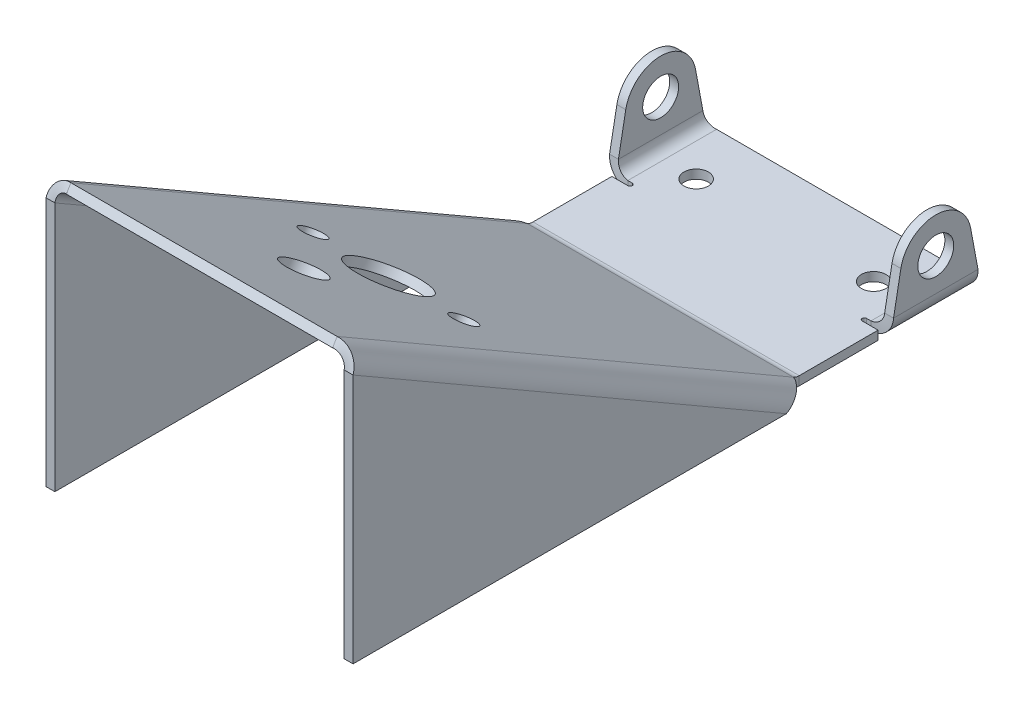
ISO-10303-21;
HEADER;
FILE_DESCRIPTION(('STEP AP214'),'2;1');
FILE_NAME('part.step','',(''),(''),'','','');
FILE_SCHEMA(('AUTOMOTIVE_DESIGN { 1 0 10303 214 1 1 1 1 }'));
ENDSEC;
DATA;
#1=APPLICATION_CONTEXT('core data for automotive mechanical design processes');
#2=APPLICATION_PROTOCOL_DEFINITION('international standard','automotive_design',2000,#1);
#3=PRODUCT_CONTEXT('',#1,'mechanical');
#4=PRODUCT('Part','Part','',(#3));
#5=PRODUCT_RELATED_PRODUCT_CATEGORY('part','',(#4));
#6=PRODUCT_DEFINITION_FORMATION('','',#4);
#7=PRODUCT_DEFINITION_CONTEXT('part definition',#1,'design');
#8=PRODUCT_DEFINITION('design','',#6,#7);
#9=PRODUCT_DEFINITION_SHAPE('','',#8);
#10=(LENGTH_UNIT() NAMED_UNIT(*) SI_UNIT(.MILLI.,.METRE.));
#11=(NAMED_UNIT(*) PLANE_ANGLE_UNIT() SI_UNIT($,.RADIAN.));
#12=(NAMED_UNIT(*) SI_UNIT($,.STERADIAN.) SOLID_ANGLE_UNIT());
#13=UNCERTAINTY_MEASURE_WITH_UNIT(LENGTH_MEASURE(1.E-05),#10,'distance_accuracy_value','');
#14=(GEOMETRIC_REPRESENTATION_CONTEXT(3) GLOBAL_UNCERTAINTY_ASSIGNED_CONTEXT((#13)) GLOBAL_UNIT_ASSIGNED_CONTEXT((#10,
#11,#12)) REPRESENTATION_CONTEXT('',''));
#15=CARTESIAN_POINT('',(0.,0.,0.));
#16=DIRECTION('',(0.,0.,1.));
#17=DIRECTION('',(1.,0.,0.));
#18=AXIS2_PLACEMENT_3D('',#15,#16,#17);
#19=CARTESIAN_POINT('',(-32.,12.,-30.0000202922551));
#20=DIRECTION('',(-1.,0.,0.));
#21=DIRECTION('',(0.,1.,0.));
#22=AXIS2_PLACEMENT_3D('',#19,#20,#21);
#23=PLANE('',#22);
#24=DIRECTION('',(0.,0.983095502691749,0.183093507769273));
#25=VECTOR('',#24,1.);
#26=CARTESIAN_POINT('',(-32.,13.4647480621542,-37.8647843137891));
#27=LINE('',#26,#25);
#28=CARTESIAN_POINT('',(-32.,4.59999999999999,-39.5157712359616));
#29=VERTEX_POINT('',#28);
#30=CARTESIAN_POINT('',(-32.,13.4647480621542,-37.8647843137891));
#31=VERTEX_POINT('',#30);
#32=EDGE_CURVE('E303',#29,#31,#27,.T.);
#33=ORIENTED_EDGE('',*,*,#32,.F.);
#34=DIRECTION('',(0.,0.,1.));
#35=VECTOR('',#34,1.);
#36=CARTESIAN_POINT('',(-32.,4.59999999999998,-30.0000202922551));
#37=LINE('',#36,#35);
#38=CARTESIAN_POINT('',(-32.,4.59999999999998,-20.4842379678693));
#39=VERTEX_POINT('',#38);
#40=EDGE_CURVE('E302',#29,#39,#37,.T.);
#41=ORIENTED_EDGE('',*,*,#40,.T.);
#42=DIRECTION('',(0.,-0.983094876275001,0.183096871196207));
#43=VECTOR('',#42,1.);
#44=CARTESIAN_POINT('',(-32.,1.99999999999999,-20.));
#45=LINE('',#44,#43);
#46=CARTESIAN_POINT('',(-32.,13.4647749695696,-22.1352612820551));
#47=VERTEX_POINT('',#46);
#48=EDGE_CURVE('E286',#47,#39,#45,.T.);
#49=ORIENTED_EDGE('',*,*,#48,.F.);
#50=CARTESIAN_POINT('',(-32.,12.,-30.0000202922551));
#51=DIRECTION('',(1.,0.,0.));
#52=DIRECTION('',(0.,1.,0.));
#53=AXIS2_PLACEMENT_3D('',#50,#51,#52);
#54=CIRCLE('',#53,8.);
#55=EDGE_CURVE('E301',#31,#47,#54,.T.);
#56=ORIENTED_EDGE('',*,*,#55,.F.);
#57=EDGE_LOOP('',(#33,#41,#49,#56));
#58=FACE_BOUND('',#57,.T.);
#59=CARTESIAN_POINT('',(-32.,12.,-30.0000202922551));
#60=DIRECTION('',(1.,0.,0.));
#61=DIRECTION('',(0.,1.,0.));
#62=AXIS2_PLACEMENT_3D('',#59,#60,#61);
#63=CIRCLE('',#62,4.04999999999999);
#64=CARTESIAN_POINT('',(-32.,16.05,-30.0000202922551));
#65=VERTEX_POINT('',#64);
#66=EDGE_CURVE('E816',#65,#65,#63,.T.);
#67=ORIENTED_EDGE('',*,*,#66,.T.);
#68=EDGE_LOOP('',(#67));
#69=FACE_BOUND('',#68,.T.);
#70=ADVANCED_FACE('F82',(#58,#69),#23,.T.);
#71=CARTESIAN_POINT('',(-30.,12.,-30.0000202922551));
#72=DIRECTION('',(-1.,0.,0.));
#73=DIRECTION('',(0.,1.,0.));
#74=AXIS2_PLACEMENT_3D('',#71,#72,#73);
#75=PLANE('',#74);
#76=DIRECTION('',(0.,0.,1.));
#77=VECTOR('',#76,1.);
#78=CARTESIAN_POINT('',(-30.,4.59999999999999,-39.5157712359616));
#79=LINE('',#78,#77);
#80=CARTESIAN_POINT('',(-30.,4.59999999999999,-39.5157712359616));
#81=VERTEX_POINT('',#80);
#82=CARTESIAN_POINT('',(-30.,4.59999999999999,-20.4842379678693));
#83=VERTEX_POINT('',#82);
#84=EDGE_CURVE('E808',#81,#83,#79,.T.);
#85=ORIENTED_EDGE('',*,*,#84,.F.);
#86=DIRECTION('',(0.,0.983095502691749,0.183093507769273));
#87=VECTOR('',#86,1.);
#88=CARTESIAN_POINT('',(-30.,13.4647480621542,-37.8647843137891));
#89=LINE('',#88,#87);
#90=CARTESIAN_POINT('',(-30.,13.4647480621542,-37.8647843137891));
#91=VERTEX_POINT('',#90);
#92=EDGE_CURVE('E312',#81,#91,#89,.T.);
#93=ORIENTED_EDGE('',*,*,#92,.T.);
#94=CARTESIAN_POINT('',(-30.,12.,-30.0000202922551));
#95=DIRECTION('',(1.,0.,0.));
#96=DIRECTION('',(0.,1.,0.));
#97=AXIS2_PLACEMENT_3D('',#94,#95,#96);
#98=CIRCLE('',#97,8.);
#99=CARTESIAN_POINT('',(-30.,13.4647749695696,-22.1352612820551));
#100=VERTEX_POINT('',#99);
#101=EDGE_CURVE('E315',#91,#100,#98,.T.);
#102=ORIENTED_EDGE('',*,*,#101,.T.);
#103=DIRECTION('',(0.,-0.983094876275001,0.183096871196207));
#104=VECTOR('',#103,1.);
#105=CARTESIAN_POINT('',(-30.,2.,-20.));
#106=LINE('',#105,#104);
#107=EDGE_CURVE('E288',#100,#83,#106,.T.);
#108=ORIENTED_EDGE('',*,*,#107,.T.);
#109=EDGE_LOOP('',(#85,#93,#102,#108));
#110=FACE_BOUND('',#109,.T.);
#111=CARTESIAN_POINT('',(-30.,12.,-30.0000202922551));
#112=DIRECTION('',(-1.,0.,0.));
#113=DIRECTION('',(0.,-1.,0.));
#114=AXIS2_PLACEMENT_3D('',#111,#112,#113);
#115=CIRCLE('',#114,4.04999999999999);
#116=CARTESIAN_POINT('',(-30.,7.95000000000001,-30.0000202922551));
#117=VERTEX_POINT('',#116);
#118=EDGE_CURVE('E86',#117,#117,#115,.F.);
#119=ORIENTED_EDGE('',*,*,#118,.F.);
#120=EDGE_LOOP('',(#119));
#121=FACE_BOUND('',#120,.T.);
#122=ADVANCED_FACE('F785',(#110,#121),#75,.F.);
#123=CARTESIAN_POINT('',(30.,0.,0.));
#124=DIRECTION('',(0.,-1.,0.));
#125=DIRECTION('',(0.,0.,-1.));
#126=AXIS2_PLACEMENT_3D('',#123,#124,#125);
#127=PLANE('',#126);
#128=CARTESIAN_POINT('',(-20.,0.,-28.));
#129=DIRECTION('',(0.,-1.,0.));
#130=DIRECTION('',(0.,0.,-1.));
#131=AXIS2_PLACEMENT_3D('',#128,#129,#130);
#132=CIRCLE('',#131,2.75);
#133=CARTESIAN_POINT('',(-20.,0.,-30.75));
#134=VERTEX_POINT('',#133);
#135=EDGE_CURVE('E513',#134,#134,#132,.T.);
#136=ORIENTED_EDGE('',*,*,#135,.F.);
#137=EDGE_LOOP('',(#136));
#138=FACE_BOUND('',#137,.T.);
#139=CARTESIAN_POINT('',(20.,0.,-28.));
#140=DIRECTION('',(0.,-1.,0.));
#141=DIRECTION('',(0.,0.,-1.));
#142=AXIS2_PLACEMENT_3D('',#139,#140,#141);
#143=CIRCLE('',#142,2.75);
#144=CARTESIAN_POINT('',(20.,0.,-30.75));
#145=VERTEX_POINT('',#144);
#146=EDGE_CURVE('E519',#145,#145,#143,.T.);
#147=ORIENTED_EDGE('',*,*,#146,.F.);
#148=EDGE_LOOP('',(#147));
#149=FACE_BOUND('',#148,.T.);
#150=DIRECTION('',(0.,0.,1.));
#151=VECTOR('',#150,1.);
#152=CARTESIAN_POINT('',(-30.,0.,0.));
#153=LINE('',#152,#151);
#154=CARTESIAN_POINT('',(-30.,0.,-19.));
#155=VERTEX_POINT('',#154);
#156=CARTESIAN_POINT('',(-30.,0.,-1.23256628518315));
#157=VERTEX_POINT('',#156);
#158=EDGE_CURVE('E720',#155,#157,#153,.T.);
#159=ORIENTED_EDGE('',*,*,#158,.F.);
#160=DIRECTION('',(1.,0.,0.));
#161=VECTOR('',#160,1.);
#162=CARTESIAN_POINT('',(30.,0.,-19.));
#163=LINE('',#162,#161);
#164=CARTESIAN_POINT('',(-26.4,0.,-19.));
#165=VERTEX_POINT('',#164);
#166=EDGE_CURVE('E99',#155,#165,#163,.T.);
#167=ORIENTED_EDGE('',*,*,#166,.T.);
#168=CARTESIAN_POINT('',(-26.4,0.,-19.5));
#169=DIRECTION('',(0.,-1.,0.));
#170=DIRECTION('',(0.,0.,-1.));
#171=AXIS2_PLACEMENT_3D('',#168,#169,#170);
#172=CIRCLE('',#171,0.5);
#173=CARTESIAN_POINT('',(-26.4,0.,-20.));
#174=VERTEX_POINT('',#173);
#175=EDGE_CURVE('E392',#165,#174,#172,.F.);
#176=ORIENTED_EDGE('',*,*,#175,.T.);
#177=DIRECTION('',(-1.,0.,0.));
#178=VECTOR('',#177,1.);
#179=CARTESIAN_POINT('',(30.,0.,-20.));
#180=LINE('',#179,#178);
#181=CARTESIAN_POINT('',(-27.4,0.,-20.));
#182=VERTEX_POINT('',#181);
#183=EDGE_CURVE('E389',#174,#182,#180,.T.);
#184=ORIENTED_EDGE('',*,*,#183,.T.);
#185=DIRECTION('',(0.,0.,1.));
#186=VECTOR('',#185,1.);
#187=CARTESIAN_POINT('',(-27.4,0.,-20.));
#188=LINE('',#187,#186);
#189=CARTESIAN_POINT('',(-27.4,0.,-40.));
#190=VERTEX_POINT('',#189);
#191=EDGE_CURVE('E325',#182,#190,#188,.F.);
#192=ORIENTED_EDGE('',*,*,#191,.T.);
#193=DIRECTION('',(-1.,0.,0.));
#194=VECTOR('',#193,1.);
#195=CARTESIAN_POINT('',(30.,0.,-40.));
#196=LINE('',#195,#194);
#197=CARTESIAN_POINT('',(27.4,0.,-40.));
#198=VERTEX_POINT('',#197);
#199=EDGE_CURVE('E734',#198,#190,#196,.T.);
#200=ORIENTED_EDGE('',*,*,#199,.F.);
#201=DIRECTION('',(0.,0.,-1.));
#202=VECTOR('',#201,1.);
#203=CARTESIAN_POINT('',(27.4,0.,-40.));
#204=LINE('',#203,#202);
#205=CARTESIAN_POINT('',(27.4,0.,-20.));
#206=VERTEX_POINT('',#205);
#207=EDGE_CURVE('E439',#198,#206,#204,.F.);
#208=ORIENTED_EDGE('',*,*,#207,.T.);
#209=DIRECTION('',(-1.,0.,0.));
#210=VECTOR('',#209,1.);
#211=CARTESIAN_POINT('',(30.,0.,-20.));
#212=LINE('',#211,#210);
#213=CARTESIAN_POINT('',(26.4,0.,-20.));
#214=VERTEX_POINT('',#213);
#215=EDGE_CURVE('E507',#206,#214,#212,.T.);
#216=ORIENTED_EDGE('',*,*,#215,.T.);
#217=CARTESIAN_POINT('',(26.4,0.,-19.5));
#218=DIRECTION('',(0.,-1.,0.));
#219=DIRECTION('',(0.,0.,-1.));
#220=AXIS2_PLACEMENT_3D('',#217,#218,#219);
#221=CIRCLE('',#220,0.5);
#222=CARTESIAN_POINT('',(26.4,0.,-19.));
#223=VERTEX_POINT('',#222);
#224=EDGE_CURVE('E504',#214,#223,#221,.F.);
#225=ORIENTED_EDGE('',*,*,#224,.T.);
#226=DIRECTION('',(1.,0.,0.));
#227=VECTOR('',#226,1.);
#228=CARTESIAN_POINT('',(30.,0.,-19.));
#229=LINE('',#228,#227);
#230=CARTESIAN_POINT('',(30.,0.,-19.));
#231=VERTEX_POINT('',#230);
#232=EDGE_CURVE('E490',#223,#231,#229,.T.);
#233=ORIENTED_EDGE('',*,*,#232,.T.);
#234=DIRECTION('',(0.,0.,1.));
#235=VECTOR('',#234,1.);
#236=CARTESIAN_POINT('',(30.,0.,0.));
#237=LINE('',#236,#235);
#238=CARTESIAN_POINT('',(30.,0.,-1.23256628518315));
#239=VERTEX_POINT('',#238);
#240=EDGE_CURVE('E702',#231,#239,#237,.T.);
#241=ORIENTED_EDGE('',*,*,#240,.T.);
#242=DIRECTION('',(-1.,0.,0.));
#243=VECTOR('',#242,1.);
#244=CARTESIAN_POINT('',(30.,0.,-1.23256628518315));
#245=LINE('',#244,#243);
#246=EDGE_CURVE('E737',#239,#157,#245,.T.);
#247=ORIENTED_EDGE('',*,*,#246,.T.);
#248=EDGE_LOOP('',(#159,#167,#176,#184,#192,#200,#208,#216,#225,#233,#241,#247));
#249=FACE_BOUND('',#248,.T.);
#250=ADVANCED_FACE('F790',(#138,#149,#249),#127,.T.);
#251=CARTESIAN_POINT('',(30.,2.,0.));
#252=DIRECTION('',(0.,-1.,0.));
#253=DIRECTION('',(0.,0.,-1.));
#254=AXIS2_PLACEMENT_3D('',#251,#252,#253);
#255=PLANE('',#254);
#256=CARTESIAN_POINT('',(-20.,2.,-28.));
#257=DIRECTION('',(0.,1.,0.));
#258=DIRECTION('',(0.,0.,1.));
#259=AXIS2_PLACEMENT_3D('',#256,#257,#258);
#260=CIRCLE('',#259,2.75);
#261=CARTESIAN_POINT('',(-20.,2.,-25.25));
#262=VERTEX_POINT('',#261);
#263=EDGE_CURVE('E510',#262,#262,#260,.T.);
#264=ORIENTED_EDGE('',*,*,#263,.F.);
#265=EDGE_LOOP('',(#264));
#266=FACE_BOUND('',#265,.T.);
#267=CARTESIAN_POINT('',(20.,2.,-28.));
#268=DIRECTION('',(0.,1.,0.));
#269=DIRECTION('',(0.,0.,1.));
#270=AXIS2_PLACEMENT_3D('',#267,#268,#269);
#271=CIRCLE('',#270,2.75);
#272=CARTESIAN_POINT('',(20.,2.,-25.25));
#273=VERTEX_POINT('',#272);
#274=EDGE_CURVE('E516',#273,#273,#271,.T.);
#275=ORIENTED_EDGE('',*,*,#274,.F.);
#276=EDGE_LOOP('',(#275));
#277=FACE_BOUND('',#276,.T.);
#278=DIRECTION('',(1.,0.,0.));
#279=VECTOR('',#278,1.);
#280=CARTESIAN_POINT('',(-30.,2.,-19.));
#281=LINE('',#280,#279);
#282=CARTESIAN_POINT('',(-30.,2.,-19.));
#283=VERTEX_POINT('',#282);
#284=CARTESIAN_POINT('',(-26.4,2.,-19.));
#285=VERTEX_POINT('',#284);
#286=EDGE_CURVE('E373',#283,#285,#281,.T.);
#287=ORIENTED_EDGE('',*,*,#286,.F.);
#288=DIRECTION('',(0.,0.,-1.));
#289=VECTOR('',#288,1.);
#290=CARTESIAN_POINT('',(-30.,2.,0.));
#291=LINE('',#290,#289);
#292=CARTESIAN_POINT('',(-30.,2.,-1.23256628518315));
#293=VERTEX_POINT('',#292);
#294=EDGE_CURVE('E722',#283,#293,#291,.F.);
#295=ORIENTED_EDGE('',*,*,#294,.T.);
#296=DIRECTION('',(-1.,0.,0.));
#297=VECTOR('',#296,1.);
#298=CARTESIAN_POINT('',(30.,2.,-1.23256628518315));
#299=LINE('',#298,#297);
#300=CARTESIAN_POINT('',(30.,2.,-1.23256628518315));
#301=VERTEX_POINT('',#300);
#302=EDGE_CURVE('E728',#301,#293,#299,.T.);
#303=ORIENTED_EDGE('',*,*,#302,.F.);
#304=DIRECTION('',(0.,0.,-1.));
#305=VECTOR('',#304,1.);
#306=CARTESIAN_POINT('',(30.,2.,0.));
#307=LINE('',#306,#305);
#308=CARTESIAN_POINT('',(30.,2.,-19.));
#309=VERTEX_POINT('',#308);
#310=EDGE_CURVE('E704',#309,#301,#307,.F.);
#311=ORIENTED_EDGE('',*,*,#310,.F.);
#312=DIRECTION('',(1.,0.,0.));
#313=VECTOR('',#312,1.);
#314=CARTESIAN_POINT('',(26.4,2.,-19.));
#315=LINE('',#314,#313);
#316=CARTESIAN_POINT('',(26.4,2.,-19.));
#317=VERTEX_POINT('',#316);
#318=EDGE_CURVE('E107',#317,#309,#315,.T.);
#319=ORIENTED_EDGE('',*,*,#318,.F.);
#320=CARTESIAN_POINT('',(26.4,2.,-19.5));
#321=DIRECTION('',(0.,1.,0.));
#322=DIRECTION('',(0.,0.,1.));
#323=AXIS2_PLACEMENT_3D('',#320,#321,#322);
#324=CIRCLE('',#323,0.5);
#325=CARTESIAN_POINT('',(26.4,2.,-20.));
#326=VERTEX_POINT('',#325);
#327=EDGE_CURVE('E491',#326,#317,#324,.T.);
#328=ORIENTED_EDGE('',*,*,#327,.F.);
#329=DIRECTION('',(-1.,0.,0.));
#330=VECTOR('',#329,1.);
#331=CARTESIAN_POINT('',(27.4,2.,-20.));
#332=LINE('',#331,#330);
#333=CARTESIAN_POINT('',(27.4,2.,-20.));
#334=VERTEX_POINT('',#333);
#335=EDGE_CURVE('E487',#334,#326,#332,.T.);
#336=ORIENTED_EDGE('',*,*,#335,.F.);
#337=DIRECTION('',(0.,0.,-1.));
#338=VECTOR('',#337,1.);
#339=CARTESIAN_POINT('',(27.4,2.,-40.));
#340=LINE('',#339,#338);
#341=CARTESIAN_POINT('',(27.4,2.,-40.));
#342=VERTEX_POINT('',#341);
#343=EDGE_CURVE('E431',#342,#334,#340,.F.);
#344=ORIENTED_EDGE('',*,*,#343,.F.);
#345=DIRECTION('',(-1.,0.,0.));
#346=VECTOR('',#345,1.);
#347=CARTESIAN_POINT('',(30.,2.,-40.));
#348=LINE('',#347,#346);
#349=CARTESIAN_POINT('',(-27.4,2.,-40.));
#350=VERTEX_POINT('',#349);
#351=EDGE_CURVE('E731',#342,#350,#348,.T.);
#352=ORIENTED_EDGE('',*,*,#351,.T.);
#353=DIRECTION('',(0.,0.,1.));
#354=VECTOR('',#353,1.);
#355=CARTESIAN_POINT('',(-27.4,2.,-20.));
#356=LINE('',#355,#354);
#357=CARTESIAN_POINT('',(-27.4,2.,-20.));
#358=VERTEX_POINT('',#357);
#359=EDGE_CURVE('E317',#358,#350,#356,.F.);
#360=ORIENTED_EDGE('',*,*,#359,.F.);
#361=DIRECTION('',(-1.,0.,0.));
#362=VECTOR('',#361,1.);
#363=CARTESIAN_POINT('',(-26.4,2.,-20.));
#364=LINE('',#363,#362);
#365=CARTESIAN_POINT('',(-26.4,2.,-20.));
#366=VERTEX_POINT('',#365);
#367=EDGE_CURVE('E381',#366,#358,#364,.T.);
#368=ORIENTED_EDGE('',*,*,#367,.F.);
#369=CARTESIAN_POINT('',(-26.4,2.,-19.5));
#370=DIRECTION('',(0.,1.,0.));
#371=DIRECTION('',(0.,0.,1.));
#372=AXIS2_PLACEMENT_3D('',#369,#370,#371);
#373=CIRCLE('',#372,0.5);
#374=EDGE_CURVE('E377',#285,#366,#373,.T.);
#375=ORIENTED_EDGE('',*,*,#374,.F.);
#376=EDGE_LOOP('',(#287,#295,#303,#311,#319,#328,#336,#344,#352,#360,#368,#375));
#377=FACE_BOUND('',#376,.T.);
#378=ADVANCED_FACE('F928',(#266,#277,#377),#255,.F.);
#379=CARTESIAN_POINT('',(-30.,2.34833395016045,0.0674337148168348));
#380=DIRECTION('',(-1.,0.,0.));
#381=DIRECTION('',(0.,0.,1.));
#382=AXIS2_PLACEMENT_3D('',#379,#380,#381);
#383=PLANE('',#382);
#384=ORIENTED_EDGE('',*,*,#294,.F.);
#385=DIRECTION('',(0.,-1.,0.));
#386=VECTOR('',#385,1.);
#387=CARTESIAN_POINT('',(-30.,2.,-19.));
#388=LINE('',#387,#386);
#389=EDGE_CURVE('E376',#283,#155,#388,.T.);
#390=ORIENTED_EDGE('',*,*,#389,.T.);
#391=ORIENTED_EDGE('',*,*,#158,.T.);
#392=DIRECTION('',(0.,1.,0.));
#393=VECTOR('',#392,1.);
#394=CARTESIAN_POINT('',(-30.,0.,-1.23256628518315));
#395=LINE('',#394,#393);
#396=EDGE_CURVE('E751',#157,#293,#395,.T.);
#397=ORIENTED_EDGE('',*,*,#396,.T.);
#398=EDGE_LOOP('',(#384,#390,#391,#397));
#399=FACE_BOUND('',#398,.T.);
#400=ADVANCED_FACE('F915',(#399),#383,.T.);
#401=CARTESIAN_POINT('',(30.,2.,-40.));
#402=DIRECTION('',(0.,0.,-1.));
#403=DIRECTION('',(-1.,0.,0.));
#404=AXIS2_PLACEMENT_3D('',#401,#402,#403);
#405=PLANE('',#404);
#406=DIRECTION('',(0.,-1.,0.));
#407=VECTOR('',#406,1.);
#408=CARTESIAN_POINT('',(-27.4,2.,-40.));
#409=LINE('',#408,#407);
#410=EDGE_CURVE('E361',#350,#190,#409,.T.);
#411=ORIENTED_EDGE('',*,*,#410,.F.);
#412=ORIENTED_EDGE('',*,*,#351,.F.);
#413=DIRECTION('',(0.,-1.,0.));
#414=VECTOR('',#413,1.);
#415=CARTESIAN_POINT('',(27.4,2.,-40.));
#416=LINE('',#415,#414);
#417=EDGE_CURVE('E484',#342,#198,#416,.T.);
#418=ORIENTED_EDGE('',*,*,#417,.T.);
#419=ORIENTED_EDGE('',*,*,#199,.T.);
#420=EDGE_LOOP('',(#411,#412,#418,#419));
#421=FACE_BOUND('',#420,.T.);
#422=ADVANCED_FACE('F910',(#421),#405,.T.);
#423=CARTESIAN_POINT('',(30.,4.6,-1.23256628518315));
#424=DIRECTION('',(1.,0.,0.));
#425=DIRECTION('',(0.,0.,-1.));
#426=AXIS2_PLACEMENT_3D('',#423,#424,#425);
#427=PLANE('',#426);
#428=ORIENTED_EDGE('',*,*,#240,.F.);
#429=DIRECTION('',(0.,-1.,0.));
#430=VECTOR('',#429,1.);
#431=CARTESIAN_POINT('',(30.,2.,-19.));
#432=LINE('',#431,#430);
#433=EDGE_CURVE('E496',#309,#231,#432,.T.);
#434=ORIENTED_EDGE('',*,*,#433,.F.);
#435=ORIENTED_EDGE('',*,*,#310,.T.);
#436=DIRECTION('',(0.,-1.,0.));
#437=VECTOR('',#436,1.);
#438=CARTESIAN_POINT('',(30.,2.,-1.23256628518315));
#439=LINE('',#438,#437);
#440=EDGE_CURVE('E91',#301,#239,#439,.T.);
#441=ORIENTED_EDGE('',*,*,#440,.T.);
#442=EDGE_LOOP('',(#428,#434,#435,#441));
#443=FACE_BOUND('',#442,.T.);
#444=ADVANCED_FACE('F676',(#443),#427,.T.);
#445=CARTESIAN_POINT('',(30.,0.616283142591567,1.06743371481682));
#446=DIRECTION('',(1.,0.,0.));
#447=DIRECTION('',(0.,0.,-1.));
#448=AXIS2_PLACEMENT_3D('',#445,#446,#447);
#449=PLANE('',#448);
#450=DIRECTION('',(0.,0.866025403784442,-0.499999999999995));
#451=VECTOR('',#450,1.);
#452=CARTESIAN_POINT('',(30.,0.616283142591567,1.06743371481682));
#453=LINE('',#452,#451);
#454=CARTESIAN_POINT('',(30.,0.616283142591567,1.06743371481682));
#455=VERTEX_POINT('',#454);
#456=CARTESIAN_POINT('',(30.,2.34833395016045,0.0674337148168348));
#457=VERTEX_POINT('',#456);
#458=EDGE_CURVE('E15',#455,#457,#453,.T.);
#459=ORIENTED_EDGE('',*,*,#458,.F.);
#460=CARTESIAN_POINT('',(30.,4.6,-1.23256628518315));
#461=DIRECTION('',(1.,0.,0.));
#462=DIRECTION('',(0.,0.,-1.));
#463=AXIS2_PLACEMENT_3D('',#460,#461,#462);
#464=CIRCLE('',#463,4.6);
#465=EDGE_CURVE('E699',#239,#455,#464,.F.);
#466=ORIENTED_EDGE('',*,*,#465,.F.);
#467=ORIENTED_EDGE('',*,*,#440,.F.);
#468=CARTESIAN_POINT('',(30.,4.6,-1.23256628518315));
#469=DIRECTION('',(1.,0.,0.));
#470=DIRECTION('',(0.,0.,-1.));
#471=AXIS2_PLACEMENT_3D('',#468,#469,#470);
#472=CIRCLE('',#471,2.6);
#473=EDGE_CURVE('E706',#301,#457,#472,.F.);
#474=ORIENTED_EDGE('',*,*,#473,.T.);
#475=EDGE_LOOP('',(#459,#466,#467,#474));
#476=FACE_BOUND('',#475,.T.);
#477=ADVANCED_FACE('F84',(#476),#449,.T.);
#478=CARTESIAN_POINT('',(-30.,0.,-1.23256628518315));
#479=DIRECTION('',(-1.,0.,0.));
#480=DIRECTION('',(0.,0.,1.));
#481=AXIS2_PLACEMENT_3D('',#478,#479,#480);
#482=PLANE('',#481);
#483=ORIENTED_EDGE('',*,*,#396,.F.);
#484=CARTESIAN_POINT('',(-30.,4.6,-1.23256628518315));
#485=DIRECTION('',(1.,0.,0.));
#486=DIRECTION('',(0.,0.,-1.));
#487=AXIS2_PLACEMENT_3D('',#484,#485,#486);
#488=CIRCLE('',#487,4.6);
#489=CARTESIAN_POINT('',(-30.,0.61628314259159,1.06743371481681));
#490=VERTEX_POINT('',#489);
#491=EDGE_CURVE('E717',#157,#490,#488,.F.);
#492=ORIENTED_EDGE('',*,*,#491,.T.);
#493=DIRECTION('',(0.,-0.866025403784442,0.499999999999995));
#494=VECTOR('',#493,1.);
#495=CARTESIAN_POINT('',(-30.,2.34833395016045,0.0674337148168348));
#496=LINE('',#495,#494);
#497=CARTESIAN_POINT('',(-30.,2.34833395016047,0.0674337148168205));
#498=VERTEX_POINT('',#497);
#499=EDGE_CURVE('E749',#498,#490,#496,.T.);
#500=ORIENTED_EDGE('',*,*,#499,.F.);
#501=CARTESIAN_POINT('',(-30.,4.6,-1.23256628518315));
#502=DIRECTION('',(1.,0.,0.));
#503=DIRECTION('',(0.,0.,-1.));
#504=AXIS2_PLACEMENT_3D('',#501,#502,#503);
#505=CIRCLE('',#504,2.6);
#506=EDGE_CURVE('E694',#293,#498,#505,.F.);
#507=ORIENTED_EDGE('',*,*,#506,.F.);
#508=EDGE_LOOP('',(#483,#492,#500,#507));
#509=FACE_BOUND('',#508,.T.);
#510=ADVANCED_FACE('F1181',(#509),#482,.T.);
#511=CARTESIAN_POINT('',(30.,1.73205080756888,-0.999999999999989));
#512=DIRECTION('',(0.,-0.866025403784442,0.499999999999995));
#513=DIRECTION('',(0.,-0.499999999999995,-0.866025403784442));
#514=AXIS2_PLACEMENT_3D('',#511,#512,#513);
#515=PLANE('',#514);
#516=CARTESIAN_POINT('',(17.,37.7320508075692,61.353829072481));
#517=DIRECTION('',(0.,0.866025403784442,-0.499999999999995));
#518=DIRECTION('',(0.,0.499999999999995,0.866025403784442));
#519=AXIS2_PLACEMENT_3D('',#516,#517,#518);
#520=CIRCLE('',#519,2.75);
#521=CARTESIAN_POINT('',(17.,39.1070508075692,63.7353989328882));
#522=VERTEX_POINT('',#521);
#523=EDGE_CURVE('E522',#522,#522,#520,.T.);
#524=ORIENTED_EDGE('',*,*,#523,.F.);
#525=EDGE_LOOP('',(#524));
#526=FACE_BOUND('',#525,.T.);
#527=CARTESIAN_POINT('',(-17.,37.7320508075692,61.353829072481));
#528=DIRECTION('',(0.,0.866025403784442,-0.499999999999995));
#529=DIRECTION('',(0.,0.499999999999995,0.866025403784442));
#530=AXIS2_PLACEMENT_3D('',#527,#528,#529);
#531=CIRCLE('',#530,2.75);
#532=CARTESIAN_POINT('',(-17.,39.1070508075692,63.7353989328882));
#533=VERTEX_POINT('',#532);
#534=EDGE_CURVE('E526',#533,#533,#531,.T.);
#535=ORIENTED_EDGE('',*,*,#534,.F.);
#536=EDGE_LOOP('',(#535));
#537=FACE_BOUND('',#536,.T.);
#538=CARTESIAN_POINT('',(0.,48.7320508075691,80.4063879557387));
#539=DIRECTION('',(0.,0.866025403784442,-0.499999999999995));
#540=DIRECTION('',(0.,0.499999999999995,0.866025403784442));
#541=AXIS2_PLACEMENT_3D('',#538,#539,#540);
#542=CIRCLE('',#541,4.5);
#543=CARTESIAN_POINT('',(0.,50.982050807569,84.3035022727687));
#544=VERTEX_POINT('',#543);
#545=EDGE_CURVE('E530',#544,#544,#542,.T.);
#546=ORIENTED_EDGE('',*,*,#545,.F.);
#547=EDGE_LOOP('',(#546));
#548=FACE_BOUND('',#547,.T.);
#549=CARTESIAN_POINT('',(0.,37.7320508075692,61.353829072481));
#550=DIRECTION('',(0.,0.866025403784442,-0.499999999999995));
#551=DIRECTION('',(0.,0.499999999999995,0.866025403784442));
#552=AXIS2_PLACEMENT_3D('',#549,#550,#551);
#553=CIRCLE('',#552,8.);
#554=CARTESIAN_POINT('',(0.,41.7320508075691,68.2820323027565));
#555=VERTEX_POINT('',#554);
#556=EDGE_CURVE('E534',#555,#555,#553,.T.);
#557=ORIENTED_EDGE('',*,*,#556,.F.);
#558=EDGE_LOOP('',(#557));
#559=FACE_BOUND('',#558,.T.);
#560=DIRECTION('',(0.,0.499999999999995,0.866025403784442));
#561=VECTOR('',#560,1.);
#562=CARTESIAN_POINT('',(-30.,1.73205080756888,-0.999999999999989));
#563=LINE('',#562,#561);
#564=CARTESIAN_POINT('',(-30.,61.7320508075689,102.923048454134));
#565=VERTEX_POINT('',#564);
#566=EDGE_CURVE('E709',#498,#565,#563,.T.);
#567=ORIENTED_EDGE('',*,*,#566,.T.);
#568=DIRECTION('',(-1.,0.,0.));
#569=VECTOR('',#568,1.);
#570=CARTESIAN_POINT('',(30.,61.7320508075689,102.923048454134));
#571=LINE('',#570,#569);
#572=CARTESIAN_POINT('',(30.,61.7320508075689,102.923048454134));
#573=VERTEX_POINT('',#572);
#574=EDGE_CURVE('E746',#573,#565,#571,.T.);
#575=ORIENTED_EDGE('',*,*,#574,.F.);
#576=DIRECTION('',(0.,0.499999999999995,0.866025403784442));
#577=VECTOR('',#576,1.);
#578=CARTESIAN_POINT('',(30.,1.73205080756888,-0.999999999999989));
#579=LINE('',#578,#577);
#580=EDGE_CURVE('E690',#457,#573,#579,.T.);
#581=ORIENTED_EDGE('',*,*,#580,.F.);
#582=DIRECTION('',(-1.,0.,0.));
#583=VECTOR('',#582,1.);
#584=CARTESIAN_POINT('',(30.,2.34833395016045,0.0674337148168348));
#585=LINE('',#584,#583);
#586=EDGE_CURVE('E708',#457,#498,#585,.T.);
#587=ORIENTED_EDGE('',*,*,#586,.T.);
#588=EDGE_LOOP('',(#567,#575,#581,#587));
#589=FACE_BOUND('',#588,.T.);
#590=ADVANCED_FACE('F1175',(#526,#537,#548,#559,#589),#515,.F.);
#591=CARTESIAN_POINT('',(30.,60.,103.923048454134));
#592=DIRECTION('',(0.,0.49999999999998,0.86602540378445));
#593=DIRECTION('',(0.,-0.86602540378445,0.49999999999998));
#594=AXIS2_PLACEMENT_3D('',#591,#592,#593);
#595=PLANE('',#594);
#596=DIRECTION('',(0.,0.86602540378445,-0.49999999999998));
#597=VECTOR('',#596,1.);
#598=CARTESIAN_POINT('',(-30.,60.,103.923048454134));
#599=LINE('',#598,#597);
#600=CARTESIAN_POINT('',(-30.,60.,103.923048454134));
#601=VERTEX_POINT('',#600);
#602=EDGE_CURVE('E712',#601,#565,#599,.T.);
#603=ORIENTED_EDGE('',*,*,#602,.F.);
#604=DIRECTION('',(-1.,0.,0.));
#605=VECTOR('',#604,1.);
#606=CARTESIAN_POINT('',(30.,60.,103.923048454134));
#607=LINE('',#606,#605);
#608=CARTESIAN_POINT('',(30.,60.,103.923048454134));
#609=VERTEX_POINT('',#608);
#610=EDGE_CURVE('E743',#609,#601,#607,.T.);
#611=ORIENTED_EDGE('',*,*,#610,.F.);
#612=DIRECTION('',(0.,0.86602540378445,-0.49999999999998));
#613=VECTOR('',#612,1.);
#614=CARTESIAN_POINT('',(30.,60.,103.923048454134));
#615=LINE('',#614,#613);
#616=EDGE_CURVE('E693',#609,#573,#615,.T.);
#617=ORIENTED_EDGE('',*,*,#616,.T.);
#618=ORIENTED_EDGE('',*,*,#574,.T.);
#619=EDGE_LOOP('',(#603,#611,#617,#618));
#620=FACE_BOUND('',#619,.T.);
#621=ADVANCED_FACE('F1164',(#620),#595,.T.);
#622=CARTESIAN_POINT('',(30.,0.,0.));
#623=DIRECTION('',(0.,-0.866025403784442,0.499999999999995));
#624=DIRECTION('',(0.,-0.499999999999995,-0.866025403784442));
#625=AXIS2_PLACEMENT_3D('',#622,#623,#624);
#626=PLANE('',#625);
#627=CARTESIAN_POINT('',(17.,36.0000000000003,62.353829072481));
#628=DIRECTION('',(0.,-0.866025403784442,0.499999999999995));
#629=DIRECTION('',(0.,-0.499999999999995,-0.866025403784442));
#630=AXIS2_PLACEMENT_3D('',#627,#628,#629);
#631=CIRCLE('',#630,2.75);
#632=CARTESIAN_POINT('',(17.,34.6250000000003,59.9722592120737));
#633=VERTEX_POINT('',#632);
#634=EDGE_CURVE('E525',#633,#633,#631,.T.);
#635=ORIENTED_EDGE('',*,*,#634,.F.);
#636=EDGE_LOOP('',(#635));
#637=FACE_BOUND('',#636,.T.);
#638=CARTESIAN_POINT('',(-17.,36.0000000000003,62.353829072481));
#639=DIRECTION('',(0.,-0.866025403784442,0.499999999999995));
#640=DIRECTION('',(0.,-0.499999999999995,-0.866025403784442));
#641=AXIS2_PLACEMENT_3D('',#638,#639,#640);
#642=CIRCLE('',#641,2.75);
#643=CARTESIAN_POINT('',(-17.,34.6250000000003,59.9722592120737));
#644=VERTEX_POINT('',#643);
#645=EDGE_CURVE('E529',#644,#644,#642,.T.);
#646=ORIENTED_EDGE('',*,*,#645,.F.);
#647=EDGE_LOOP('',(#646));
#648=FACE_BOUND('',#647,.T.);
#649=CARTESIAN_POINT('',(0.,47.0000000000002,81.4063879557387));
#650=DIRECTION('',(0.,-0.866025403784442,0.499999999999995));
#651=DIRECTION('',(0.,-0.499999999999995,-0.866025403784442));
#652=AXIS2_PLACEMENT_3D('',#649,#650,#651);
#653=CIRCLE('',#652,4.5);
#654=CARTESIAN_POINT('',(0.,44.7500000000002,77.5092736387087));
#655=VERTEX_POINT('',#654);
#656=EDGE_CURVE('E533',#655,#655,#653,.T.);
#657=ORIENTED_EDGE('',*,*,#656,.F.);
#658=EDGE_LOOP('',(#657));
#659=FACE_BOUND('',#658,.T.);
#660=CARTESIAN_POINT('',(0.,36.0000000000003,62.353829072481));
#661=DIRECTION('',(0.,-0.866025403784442,0.499999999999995));
#662=DIRECTION('',(0.,-0.499999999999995,-0.866025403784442));
#663=AXIS2_PLACEMENT_3D('',#660,#661,#662);
#664=CIRCLE('',#663,8.);
#665=CARTESIAN_POINT('',(0.,32.0000000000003,55.4256258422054));
#666=VERTEX_POINT('',#665);
#667=EDGE_CURVE('E537',#666,#666,#664,.T.);
#668=ORIENTED_EDGE('',*,*,#667,.F.);
#669=EDGE_LOOP('',(#668));
#670=FACE_BOUND('',#669,.T.);
#671=DIRECTION('',(0.,0.499999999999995,0.866025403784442));
#672=VECTOR('',#671,1.);
#673=CARTESIAN_POINT('',(-30.,0.,0.));
#674=LINE('',#673,#672);
#675=EDGE_CURVE('E715',#490,#601,#674,.T.);
#676=ORIENTED_EDGE('',*,*,#675,.F.);
#677=DIRECTION('',(-1.,0.,0.));
#678=VECTOR('',#677,1.);
#679=CARTESIAN_POINT('',(30.,0.616283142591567,1.06743371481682));
#680=LINE('',#679,#678);
#681=EDGE_CURVE('E740',#455,#490,#680,.T.);
#682=ORIENTED_EDGE('',*,*,#681,.F.);
#683=DIRECTION('',(0.,0.499999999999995,0.866025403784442));
#684=VECTOR('',#683,1.);
#685=CARTESIAN_POINT('',(30.,0.,0.));
#686=LINE('',#685,#684);
#687=EDGE_CURVE('E696',#455,#609,#686,.T.);
#688=ORIENTED_EDGE('',*,*,#687,.T.);
#689=ORIENTED_EDGE('',*,*,#610,.T.);
#690=EDGE_LOOP('',(#676,#682,#688,#689));
#691=FACE_BOUND('',#690,.T.);
#692=ADVANCED_FACE('F1158',(#637,#648,#659,#670,#691),#626,.T.);
#693=CARTESIAN_POINT('',(30.,4.6,-1.23256628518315));
#694=DIRECTION('',(-1.,0.,0.));
#695=DIRECTION('',(0.,0.,1.));
#696=AXIS2_PLACEMENT_3D('',#693,#694,#695);
#697=CYLINDRICAL_SURFACE('',#696,4.6);
#698=ORIENTED_EDGE('',*,*,#491,.F.);
#699=ORIENTED_EDGE('',*,*,#246,.F.);
#700=ORIENTED_EDGE('',*,*,#465,.T.);
#701=ORIENTED_EDGE('',*,*,#681,.T.);
#702=EDGE_LOOP('',(#698,#699,#700,#701));
#703=FACE_BOUND('',#702,.T.);
#704=ADVANCED_FACE('F1163',(#703),#697,.T.);
#705=CARTESIAN_POINT('',(30.,4.6,-1.23256628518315));
#706=DIRECTION('',(-1.,0.,0.));
#707=DIRECTION('',(0.,0.,1.));
#708=AXIS2_PLACEMENT_3D('',#705,#706,#707);
#709=CYLINDRICAL_SURFACE('',#708,2.6);
#710=ORIENTED_EDGE('',*,*,#506,.T.);
#711=ORIENTED_EDGE('',*,*,#586,.F.);
#712=ORIENTED_EDGE('',*,*,#473,.F.);
#713=ORIENTED_EDGE('',*,*,#302,.T.);
#714=EDGE_LOOP('',(#710,#711,#712,#713));
#715=FACE_BOUND('',#714,.T.);
#716=ADVANCED_FACE('F1258',(#715),#709,.F.);
#717=CARTESIAN_POINT('',(30.,2.36565445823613,0.0574337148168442));
#718=CARTESIAN_POINT('',(30.6048352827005,2.55331775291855,0.382476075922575));
#719=CARTESIAN_POINT('',(31.2092752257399,2.63679584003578,0.76755683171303));
#720=CARTESIAN_POINT('',(32.3267196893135,2.61122443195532,1.6489871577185));
#721=CARTESIAN_POINT('',(32.8392058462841,2.50230819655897,2.14520330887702));
#722=CARTESIAN_POINT('',(33.6944608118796,2.13691334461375,3.22283079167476));
#723=CARTESIAN_POINT('',(34.0368931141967,1.88072615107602,3.80407387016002));
#724=CARTESIAN_POINT('',(34.4997537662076,1.28826853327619,5.01279610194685));
#725=CARTESIAN_POINT('',(34.62,0.952422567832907,5.63997371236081));
#726=CARTESIAN_POINT('',(34.62,0.616283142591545,6.26743371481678));
#727=CARTESIAN_POINT('',(30.,2.34833395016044,0.0674337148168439));
#728=CARTESIAN_POINT('',(30.6022167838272,2.53599715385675,0.392475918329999));
#729=CARTESIAN_POINT('',(31.2040402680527,2.61992613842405,0.777296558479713));
#730=CARTESIAN_POINT('',(32.3166473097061,2.59609000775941,1.65772502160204));
#731=CARTESIAN_POINT('',(32.8269149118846,2.48845756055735,2.15319997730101));
#732=CARTESIAN_POINT('',(33.6784674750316,2.12626908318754,3.22897625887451));
#733=CARTESIAN_POINT('',(34.0194173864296,1.87200321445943,3.80911005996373));
#734=CARTESIAN_POINT('',(34.4802743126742,1.28373492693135,5.01541358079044));
#735=CARTESIAN_POINT('',(34.6,0.950154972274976,5.64128311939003));
#736=CARTESIAN_POINT('',(34.6,0.616283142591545,6.26743371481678));
#737=CARTESIAN_POINT('',(30.,0.616283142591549,1.06743371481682));
#738=CARTESIAN_POINT('',(30.3403668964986,0.803937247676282,1.39246015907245));
#739=CARTESIAN_POINT('',(30.6805444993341,0.932955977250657,1.75126923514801));
#740=CARTESIAN_POINT('',(31.3094093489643,1.08264758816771,2.53151140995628));
#741=CARTESIAN_POINT('',(31.5978214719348,1.10339396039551,2.95286681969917));
#742=CARTESIAN_POINT('',(32.0791337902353,1.06184294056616,3.84352297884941));
#743=CARTESIAN_POINT('',(32.2718446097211,0.999709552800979,4.31272904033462));
#744=CARTESIAN_POINT('',(32.5323289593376,0.830374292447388,5.27716146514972));
#745=CARTESIAN_POINT('',(32.6,0.723395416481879,5.77222382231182));
#746=CARTESIAN_POINT('',(32.6,0.616283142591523,6.26743371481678));
#747=CARTESIAN_POINT('',(30.,0.598789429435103,1.07753371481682));
#748=CARTESIAN_POINT('',(30.3377222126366,0.786443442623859,1.40255999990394));
#749=CARTESIAN_POINT('',(30.6752571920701,0.915917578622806,1.76110635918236));
#750=CARTESIAN_POINT('',(31.2992362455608,1.06736181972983,2.54033665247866));
#751=CARTESIAN_POINT('',(31.5854076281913,1.08940481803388,2.96094345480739));
#752=CARTESIAN_POINT('',(32.0629805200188,1.05109223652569,3.84972990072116));
#753=CARTESIAN_POINT('',(32.2541941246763,0.990899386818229,4.31781559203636));
#754=CARTESIAN_POINT('',(32.5126547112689,0.8257953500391,5.27980511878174));
#755=CARTESIAN_POINT('',(32.5798,0.721105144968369,5.77354632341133));
#756=CARTESIAN_POINT('',(32.5798,0.616283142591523,6.26743371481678));
#757=B_SPLINE_SURFACE_WITH_KNOTS('',1,3,((#717,#718,#719,#720,#721,#722,#723,#724,#725,#726),
(#727,#728,#729,#730,#731,#732,#733,#734,#735,#736),(#737,#738,#739,#740,#741,#742,#743,#744,
#745,#746),(#747,#748,#749,#750,#751,#752,#753,#754,#755,#756)),.UNSPECIFIED.,.F.,.F.,.F.,(2,1,
1,2),(4,2,2,2,4),(-0.01,0.,1.,1.0101),(0.,0.25,0.5,0.75,1.),.UNSPECIFIED.);
#758=DIRECTION('',(1.,0.,0.));
#759=VECTOR('',#758,1.);
#760=CARTESIAN_POINT('',(34.6,0.616283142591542,6.26743371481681));
#761=LINE('',#760,#759);
#762=CARTESIAN_POINT('',(32.6,0.616283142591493,6.26743371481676));
#763=VERTEX_POINT('',#762);
#764=CARTESIAN_POINT('',(34.6,0.616283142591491,6.26743371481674));
#765=VERTEX_POINT('',#764);
#766=EDGE_CURVE('E570',#763,#765,#761,.T.);
#767=CARTESIAN_POINT('',(30.,0.616283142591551,1.06743371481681));
#768=CARTESIAN_POINT('',(30.1090314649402,0.676433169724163,1.17153741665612));
#769=CARTESIAN_POINT('',(30.2180608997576,0.730573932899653,1.27910396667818));
#770=CARTESIAN_POINT('',(30.4343929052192,0.827078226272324,1.50101808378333));
#771=CARTESIAN_POINT('',(30.541695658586,0.869443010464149,1.61536492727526));
#772=CARTESIAN_POINT('',(30.7526643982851,0.942576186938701,1.8504819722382));
#773=CARTESIAN_POINT('',(30.8563372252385,0.973367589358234,1.97123887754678));
#774=CARTESIAN_POINT('',(31.0586429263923,1.02394115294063,2.21910603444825));
#775=CARTESIAN_POINT('',(31.157275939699,1.04372361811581,2.34621611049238));
#776=CARTESIAN_POINT('',(31.3483261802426,1.07295870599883,2.60692685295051));
#777=CARTESIAN_POINT('',(31.4407180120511,1.08237126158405,2.74055062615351));
#778=CARTESIAN_POINT('',(31.6173934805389,1.09154764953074,3.01337748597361));
#779=CARTESIAN_POINT('',(31.7016769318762,1.09131126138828,3.15258070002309));
#780=CARTESIAN_POINT('',(31.8608191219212,1.08214488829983,3.43604082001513));
#781=CARTESIAN_POINT('',(31.9356756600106,1.07321287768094,3.58029889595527));
#782=CARTESIAN_POINT('',(32.0747544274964,1.04774039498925,3.87319403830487));
#783=CARTESIAN_POINT('',(32.1389771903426,1.03120030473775,4.02183088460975));
#784=CARTESIAN_POINT('',(32.2558228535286,0.991722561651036,4.32293388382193));
#785=CARTESIAN_POINT('',(32.3084346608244,0.968778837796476,4.47540354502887));
#786=CARTESIAN_POINT('',(32.4011446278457,0.917824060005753,4.78326917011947));
#787=CARTESIAN_POINT('',(32.4412432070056,0.889813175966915,4.93866503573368));
#788=CARTESIAN_POINT('',(32.5082377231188,0.830168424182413,5.25129985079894));
#789=CARTESIAN_POINT('',(32.5351558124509,0.798540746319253,5.40853524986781));
#790=CARTESIAN_POINT('',(32.5754478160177,0.733099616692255,5.72420767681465));
#791=CARTESIAN_POINT('',(32.5888304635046,0.699287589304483,5.88264386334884));
#792=CARTESIAN_POINT('',(32.5969013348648,0.65701774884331,6.07893054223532));
#793=CARTESIAN_POINT('',(32.5980637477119,0.64887904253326,6.11664337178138));
#794=CARTESIAN_POINT('',(32.5996125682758,0.632588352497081,6.19204762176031));
#795=CARTESIAN_POINT('',(32.5999996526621,0.624436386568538,6.22973903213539));
#796=CARTESIAN_POINT('',(32.6,0.616283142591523,6.26743371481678));
#797=B_SPLINE_CURVE_WITH_KNOTS('',3,(#767,#768,#769,#770,#771,#772,#773,#774,#775,#776,#777,
#778,#779,#780,#781,#782,#783,#784,#785,#786,#787,#788,#789,#790,#791,#792,#793,#794,#795,#796),
.UNSPECIFIED.,.F.,.F.,(4,2,2,2,2,2,2,2,2,2,2,2,2,2,4),(0.,0.486765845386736,0.973479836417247,
1.45922096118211,1.94494867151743,2.43254661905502,2.92015570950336,3.40787841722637,
3.89557665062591,4.38373883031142,4.87188464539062,5.3592071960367,5.84621511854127,
5.9620064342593,6.07769664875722),.UNSPECIFIED.);
#798=EDGE_CURVE('E661',#455,#763,#797,.T.);
#799=CARTESIAN_POINT('',(30.,2.34833395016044,0.0674337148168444));
#800=CARTESIAN_POINT('',(30.1451510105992,2.39358732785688,0.145770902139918));
#801=CARTESIAN_POINT('',(30.2902998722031,2.43285222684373,0.227562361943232));
#802=CARTESIAN_POINT('',(30.5792884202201,2.49953944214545,0.397968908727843));
#803=CARTESIAN_POINT('',(30.7231282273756,2.52696286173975,0.486583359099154));
#804=CARTESIAN_POINT('',(31.0081994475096,2.57010656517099,0.67055148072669));
#805=CARTESIAN_POINT('',(31.1494312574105,2.58582864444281,0.765904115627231));
#806=CARTESIAN_POINT('',(31.4280430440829,2.60585258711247,0.963211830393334));
#807=CARTESIAN_POINT('',(31.5654229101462,2.61015412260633,1.0651670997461));
#808=CARTESIAN_POINT('',(31.842044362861,2.60763239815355,1.28087689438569));
#809=CARTESIAN_POINT('',(31.9810182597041,2.60022555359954,1.3949685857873));
#810=CARTESIAN_POINT('',(32.2519767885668,2.5737230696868,1.62989641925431));
#811=CARTESIAN_POINT('',(32.3839612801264,2.55462719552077,1.75073269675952));
#812=CARTESIAN_POINT('',(32.6395757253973,2.50541813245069,1.99871495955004));
#813=CARTESIAN_POINT('',(32.7632093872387,2.47530987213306,2.12585810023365));
#814=CARTESIAN_POINT('',(33.0009577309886,2.40485071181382,2.38606406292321));
#815=CARTESIAN_POINT('',(33.1150725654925,2.36449997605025,2.51912678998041));
#816=CARTESIAN_POINT('',(33.3326721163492,2.27441417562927,2.79068043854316));
#817=CARTESIAN_POINT('',(33.4361557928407,2.22467819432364,2.92917188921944));
#818=CARTESIAN_POINT('',(33.6314594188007,2.11678147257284,3.21101453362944));
#819=CARTESIAN_POINT('',(33.7232792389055,2.05862063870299,3.3543657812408));
#820=CARTESIAN_POINT('',(33.8943865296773,1.93489192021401,3.64539810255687));
#821=CARTESIAN_POINT('',(33.9736677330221,1.86932035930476,3.79308129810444));
#822=CARTESIAN_POINT('',(34.1188559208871,1.73192109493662,4.09206684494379));
#823=CARTESIAN_POINT('',(34.1847629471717,1.66009341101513,4.24336918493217));
#824=CARTESIAN_POINT('',(34.3022498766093,1.51173952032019,4.54812135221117));
#825=CARTESIAN_POINT('',(34.353901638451,1.43523934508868,4.70155615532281));
#826=CARTESIAN_POINT('',(34.4428219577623,1.27841693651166,5.01062772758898));
#827=CARTESIAN_POINT('',(34.4800903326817,1.19809465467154,5.16626452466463));
#828=CARTESIAN_POINT('',(34.5398852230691,1.03483721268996,5.47911024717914));
#829=CARTESIAN_POINT('',(34.562403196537,0.951900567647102,5.63632003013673));
#830=CARTESIAN_POINT('',(34.5924743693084,0.78473709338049,5.9514963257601));
#831=CARTESIAN_POINT('',(34.6000265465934,0.700510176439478,6.10946288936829));
#832=CARTESIAN_POINT('',(34.6,0.616283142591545,6.26743371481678));
#833=B_SPLINE_CURVE_WITH_KNOTS('',3,(#799,#800,#801,#802,#803,#804,#805,#806,#807,#808,#809,
#810,#811,#812,#813,#814,#815,#816,#817,#818,#819,#820,#821,#822,#823,#824,#825,#826,#827,#828,
#829,#830,#831,#832),.UNSPECIFIED.,.F.,.F.,(4,2,2,2,2,2,2,2,2,2,2,2,2,2,2,2,4),(0.,
0.512965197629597,1.02588259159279,1.53872126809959,2.0515746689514,2.59080671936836,
3.13004960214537,3.66905144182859,4.20804463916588,4.74709050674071,5.28614235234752,
5.825462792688,6.3647815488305,6.90132984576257,7.43788495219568,7.97475050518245,
8.51165271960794),.UNSPECIFIED.);
#834=EDGE_CURVE('E648',#457,#765,#833,.T.);
#835=ORIENTED_EDGE('',*,*,#766,.F.);
#836=ORIENTED_EDGE('',*,*,#798,.F.);
#837=ORIENTED_EDGE('',*,*,#458,.T.);
#838=ORIENTED_EDGE('',*,*,#834,.T.);
#839=EDGE_LOOP('',(#835,#836,#837,#838));
#840=FACE_BOUND('',#839,.T.);
#841=ADVANCED_FACE('F671',(#840),#757,.F.);
#842=CARTESIAN_POINT('',(34.62,56.997778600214,103.923048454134));
#843=CARTESIAN_POINT('',(34.62,57.584160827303,103.7289699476));
#844=CARTESIAN_POINT('',(34.4997537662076,58.1701342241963,103.535077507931));
#845=CARTESIAN_POINT('',(34.0368931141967,59.2629620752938,103.193021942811));
#846=CARTESIAN_POINT('',(33.6944608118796,59.7693343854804,103.045112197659));
#847=CARTESIAN_POINT('',(32.8392058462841,60.6350994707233,102.834151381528));
#848=CARTESIAN_POINT('',(32.3267196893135,60.9942008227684,102.771268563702));
#849=CARTESIAN_POINT('',(31.2092752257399,61.5201424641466,102.756504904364));
#850=CARTESIAN_POINT('',(30.6048611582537,61.6868142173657,102.804696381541));
#851=CARTESIAN_POINT('',(30.,61.7493713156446,102.913048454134));
#852=CARTESIAN_POINT('',(34.6,56.997778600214,103.923048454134));
#853=CARTESIAN_POINT('',(34.6,57.5818931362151,103.73027917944));
#854=CARTESIAN_POINT('',(34.4802743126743,58.1656006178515,103.537694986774));
#855=CARTESIAN_POINT('',(34.0194173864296,59.2542391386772,103.198058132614));
#856=CARTESIAN_POINT('',(33.6784674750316,59.7586901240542,103.051257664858));
#857=CARTESIAN_POINT('',(32.8269149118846,60.6212488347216,102.842148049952));
#858=CARTESIAN_POINT('',(32.3166473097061,60.9790663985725,102.780006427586));
#859=CARTESIAN_POINT('',(31.2040402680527,61.5032727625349,102.76624463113));
#860=CARTESIAN_POINT('',(30.6022426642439,61.6694937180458,102.814696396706));
#861=CARTESIAN_POINT('',(30.,61.7320508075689,102.923048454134));
#862=CARTESIAN_POINT('',(32.6,56.997778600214,103.923048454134));
#863=CARTESIAN_POINT('',(32.6,57.3551240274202,103.86120236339));
#864=CARTESIAN_POINT('',(32.5323289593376,57.7122399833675,103.799442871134));
#865=CARTESIAN_POINT('',(32.2718446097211,58.3819454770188,103.701677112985));
#866=CARTESIAN_POINT('',(32.0791337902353,58.6942639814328,103.665804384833));
#867=CARTESIAN_POINT('',(31.5978214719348,59.2361852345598,103.64181489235));
#868=CARTESIAN_POINT('',(31.3094093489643,59.4656239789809,103.65379281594));
#869=CARTESIAN_POINT('',(30.6805444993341,59.8163026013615,103.740217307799));
#870=CARTESIAN_POINT('',(30.3403932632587,59.9374437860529,103.814697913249));
#871=CARTESIAN_POINT('',(30.,60.,103.923048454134));
#872=CARTESIAN_POINT('',(32.5798,56.997778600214,103.923048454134));
#873=CARTESIAN_POINT('',(32.5798,57.3528336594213,103.862524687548));
#874=CARTESIAN_POINT('',(32.5126547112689,57.7076610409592,103.802086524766));
#875=CARTESIAN_POINT('',(32.2541941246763,58.373135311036,103.706763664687));
#876=CARTESIAN_POINT('',(32.0629805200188,58.6835132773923,103.672011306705));
#877=CARTESIAN_POINT('',(31.5854076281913,59.2221960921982,103.649891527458));
#878=CARTESIAN_POINT('',(31.2992362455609,59.450338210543,103.662618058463));
#879=CARTESIAN_POINT('',(30.6752571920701,59.7992642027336,103.750054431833));
#880=CARTESIAN_POINT('',(30.3377485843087,59.9199500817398,103.824797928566));
#881=CARTESIAN_POINT('',(30.,59.9825062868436,103.933148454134));
#882=B_SPLINE_SURFACE_WITH_KNOTS('',1,3,((#842,#843,#844,#845,#846,#847,#848,#849,#850,#851),
(#852,#853,#854,#855,#856,#857,#858,#859,#860,#861),(#862,#863,#864,#865,#866,#867,#868,#869,
#870,#871),(#872,#873,#874,#875,#876,#877,#878,#879,#880,#881)),.UNSPECIFIED.,.F.,.F.,.F.,(2,1,
1,2),(4,2,2,2,4),(-0.01,0.,1.,1.0101),(0.,0.25,0.5,0.75,1.),.UNSPECIFIED.);
#883=CARTESIAN_POINT('',(32.6,56.997778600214,103.923048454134));
#884=CARTESIAN_POINT('',(32.6000110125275,57.0832333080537,103.908260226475));
#885=CARTESIAN_POINT('',(32.5961774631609,57.168683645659,103.89347222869));
#886=CARTESIAN_POINT('',(32.580904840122,57.3389613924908,103.864253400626));
#887=CARTESIAN_POINT('',(32.5694659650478,57.4237888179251,103.849822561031));
#888=CARTESIAN_POINT('',(32.5390848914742,57.592107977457,103.821691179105));
#889=CARTESIAN_POINT('',(32.5201518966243,57.6756012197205,103.807989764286));
#890=CARTESIAN_POINT('',(32.4749702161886,57.8407262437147,103.781653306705));
#891=CARTESIAN_POINT('',(32.4487219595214,57.9223581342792,103.769018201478));
#892=CARTESIAN_POINT('',(32.3617737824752,58.1569431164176,103.734205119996));
#893=CARTESIAN_POINT('',(32.2915345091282,58.3067636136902,103.713882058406));
#894=CARTESIAN_POINT('',(32.127223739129,58.5934376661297,103.680660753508));
#895=CARTESIAN_POINT('',(32.0331607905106,58.730295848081,103.667759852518));
#896=CARTESIAN_POINT('',(31.8242116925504,58.9877112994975,103.651376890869));
#897=CARTESIAN_POINT('',(31.7093278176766,59.1082703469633,103.647893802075));
#898=CARTESIAN_POINT('',(31.4623636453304,59.3301683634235,103.652049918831));
#899=CARTESIAN_POINT('',(31.3302747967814,59.4314977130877,103.659694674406));
#900=CARTESIAN_POINT('',(31.0531725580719,59.6125696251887,103.68747998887));
#901=CARTESIAN_POINT('',(30.9081523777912,59.6923007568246,103.707627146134));
#902=CARTESIAN_POINT('',(30.6100177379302,59.8283721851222,103.761360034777));
#903=CARTESIAN_POINT('',(30.4569162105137,59.88474864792,103.79492482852));
#904=CARTESIAN_POINT('',(30.252166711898,59.9434087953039,103.848550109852));
#905=CARTESIAN_POINT('',(30.2017910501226,59.9565192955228,103.862434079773));
#906=CARTESIAN_POINT('',(30.100950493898,59.9801723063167,103.891649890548));
#907=CARTESIAN_POINT('',(30.0504858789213,59.9907189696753,103.906979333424));
#908=CARTESIAN_POINT('',(30.,60.,103.923048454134));
#909=B_SPLINE_CURVE_WITH_KNOTS('',3,(#883,#884,#885,#886,#887,#888,#889,#890,#891,#892,#893,
#894,#895,#896,#897,#898,#899,#900,#901,#902,#903,#904,#905,#906,#907,#908),.UNSPECIFIED.,.F.,
.F.,(4,2,2,2,2,2,2,2,2,2,2,2,4),(0.,0.2600822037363,0.520157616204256,0.779914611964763,
1.03965638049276,1.53721892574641,2.03460319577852,2.53193316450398,3.02951126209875,
3.52735218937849,4.02441927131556,4.18598224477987,4.34728175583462),.UNSPECIFIED.);
#910=CARTESIAN_POINT('',(32.6,56.997778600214,103.923048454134));
#911=VERTEX_POINT('',#910);
#912=EDGE_CURVE('E684',#911,#609,#909,.T.);
#913=DIRECTION('',(1.,0.,0.));
#914=VECTOR('',#913,1.);
#915=CARTESIAN_POINT('',(32.6,56.997778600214,103.923048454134));
#916=LINE('',#915,#914);
#917=CARTESIAN_POINT('',(34.6,56.997778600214,103.923048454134));
#918=VERTEX_POINT('',#917);
#919=EDGE_CURVE('E1408',#911,#918,#916,.T.);
#920=CARTESIAN_POINT('',(34.6,56.997778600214,103.923048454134));
#921=CARTESIAN_POINT('',(34.6000151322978,57.1259512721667,103.880750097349));
#922=CARTESIAN_POINT('',(34.5943059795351,57.2541218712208,103.838452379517));
#923=CARTESIAN_POINT('',(34.5715483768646,57.5096077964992,103.754347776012));
#924=CARTESIAN_POINT('',(34.554500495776,57.6369231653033,103.712540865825));
#925=CARTESIAN_POINT('',(34.509192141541,57.8897631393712,103.629934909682));
#926=CARTESIAN_POINT('',(34.480940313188,58.015289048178,103.589135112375));
#927=CARTESIAN_POINT('',(34.4134386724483,58.2638216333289,103.508992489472));
#928=CARTESIAN_POINT('',(34.3741889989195,58.386828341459,103.469649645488));
#929=CARTESIAN_POINT('',(34.2849625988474,58.629563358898,103.392869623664));
#930=CARTESIAN_POINT('',(34.2349814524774,58.7492902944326,103.355433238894));
#931=CARTESIAN_POINT('',(34.124652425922,58.9846703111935,103.28292471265));
#932=CARTESIAN_POINT('',(34.0643007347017,59.1003218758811,103.247853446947));
#933=CARTESIAN_POINT('',(33.9337275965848,59.3266834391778,103.180543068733));
#934=CARTESIAN_POINT('',(33.8635117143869,59.4373961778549,103.148302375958));
#935=CARTESIAN_POINT('',(33.7136794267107,59.6532688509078,103.08703880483));
#936=CARTESIAN_POINT('',(33.6340597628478,59.7584268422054,103.058017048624));
#937=CARTESIAN_POINT('',(33.4660477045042,59.9624496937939,103.003602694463));
#938=CARTESIAN_POINT('',(33.3776571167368,60.0613158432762,102.978209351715));
#939=CARTESIAN_POINT('',(33.19274475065,60.2521463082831,102.93140700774));
#940=CARTESIAN_POINT('',(33.0962229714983,60.3441106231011,102.909998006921));
#941=CARTESIAN_POINT('',(32.8957195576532,60.5205959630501,102.871490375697));
#942=CARTESIAN_POINT('',(32.7917346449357,60.6051136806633,102.854393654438));
#943=CARTESIAN_POINT('',(32.5771517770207,60.7661062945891,102.824830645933));
#944=CARTESIAN_POINT('',(32.4665561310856,60.8425839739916,102.812362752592));
#945=CARTESIAN_POINT('',(32.2394672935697,60.987112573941,102.792315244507));
#946=CARTESIAN_POINT('',(32.1229703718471,61.0551580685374,102.784738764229));
#947=CARTESIAN_POINT('',(31.8850531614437,61.1823375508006,102.774719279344));
#948=CARTESIAN_POINT('',(31.7636346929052,61.2414747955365,102.772274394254));
#949=CARTESIAN_POINT('',(31.5167955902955,61.3505035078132,102.772707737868));
#950=CARTESIAN_POINT('',(31.3913769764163,61.400399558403,102.775583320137));
#951=CARTESIAN_POINT('',(31.1374540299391,61.4906992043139,102.786801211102));
#952=CARTESIAN_POINT('',(31.0089506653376,61.5311057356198,102.795141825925));
#953=CARTESIAN_POINT('',(30.7344897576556,61.6064370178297,102.81872258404));
#954=CARTESIAN_POINT('',(30.5882591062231,61.6401555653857,102.834659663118));
#955=CARTESIAN_POINT('',(30.294682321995,61.6953104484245,102.873567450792));
#956=CARTESIAN_POINT('',(30.1473384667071,61.7167672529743,102.896526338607));
#957=CARTESIAN_POINT('',(30.,61.7320508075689,102.923048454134));
#958=B_SPLINE_CURVE_WITH_KNOTS('',3,(#920,#921,#922,#923,#924,#925,#926,#927,#928,#929,#930,
#931,#932,#933,#934,#935,#936,#937,#938,#939,#940,#941,#942,#943,#944,#945,#946,#947,#948,#949,
#950,#951,#952,#953,#954,#955,#956,#957),.UNSPECIFIED.,.F.,.F.,(4,2,2,2,2,2,2,2,2,2,2,2,2,2,2,2,
2,2,4),(0.,0.404791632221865,0.809562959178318,1.21402257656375,1.61847708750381,
2.02309849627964,2.42786891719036,2.83241190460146,3.23709547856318,3.64169586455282,
4.04629629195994,4.45107553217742,4.85571419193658,5.26061189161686,5.66536118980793,
6.06990921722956,6.47433191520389,6.92638845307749,7.37768813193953),.UNSPECIFIED.);
#959=EDGE_CURVE('E654',#918,#573,#958,.T.);
#960=ORIENTED_EDGE('',*,*,#912,.F.);
#961=ORIENTED_EDGE('',*,*,#919,.T.);
#962=ORIENTED_EDGE('',*,*,#959,.T.);
#963=ORIENTED_EDGE('',*,*,#616,.F.);
#964=EDGE_LOOP('',(#960,#961,#962,#963));
#965=FACE_BOUND('',#964,.T.);
#966=ADVANCED_FACE('F642',(#965),#882,.F.);
#967=CARTESIAN_POINT('',(30.,57.7483339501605,105.223048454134));
#968=DIRECTION('',(0.,0.499999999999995,0.866025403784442));
#969=DIRECTION('',(1.,0.,0.));
#970=AXIS2_PLACEMENT_3D('',#967,#968,#969);
#971=CYLINDRICAL_SURFACE('',#970,4.6);
#972=ORIENTED_EDGE('',*,*,#580,.T.);
#973=ORIENTED_EDGE('',*,*,#959,.F.);
#974=DIRECTION('',(0.,0.499999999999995,0.866025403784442));
#975=VECTOR('',#974,1.);
#976=CARTESIAN_POINT('',(34.6,-2.25166604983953,1.29999999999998));
#977=LINE('',#976,#975);
#978=EDGE_CURVE('E1413',#765,#918,#977,.T.);
#979=ORIENTED_EDGE('',*,*,#978,.F.);
#980=ORIENTED_EDGE('',*,*,#834,.F.);
#981=EDGE_LOOP('',(#972,#973,#979,#980));
#982=FACE_BOUND('',#981,.T.);
#983=ADVANCED_FACE('F638',(#982),#971,.T.);
#984=CARTESIAN_POINT('',(30.,57.7483339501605,105.223048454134));
#985=DIRECTION('',(0.,0.499999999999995,0.866025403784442));
#986=DIRECTION('',(1.,0.,0.));
#987=AXIS2_PLACEMENT_3D('',#984,#985,#986);
#988=CYLINDRICAL_SURFACE('',#987,2.6);
#989=ORIENTED_EDGE('',*,*,#687,.F.);
#990=ORIENTED_EDGE('',*,*,#798,.T.);
#991=DIRECTION('',(0.,-0.499999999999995,-0.866025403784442));
#992=VECTOR('',#991,1.);
#993=CARTESIAN_POINT('',(32.6,0.616283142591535,6.26743371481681));
#994=LINE('',#993,#992);
#995=EDGE_CURVE('E1407',#763,#911,#994,.F.);
#996=ORIENTED_EDGE('',*,*,#995,.T.);
#997=ORIENTED_EDGE('',*,*,#912,.T.);
#998=EDGE_LOOP('',(#989,#990,#996,#997));
#999=FACE_BOUND('',#998,.T.);
#1000=ADVANCED_FACE('F633',(#999),#988,.F.);
#1001=CARTESIAN_POINT('',(34.6,60.,103.923048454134));
#1002=DIRECTION('',(0.,0.,1.));
#1003=DIRECTION('',(0.,-1.,0.));
#1004=AXIS2_PLACEMENT_3D('',#1001,#1002,#1003);
#1005=PLANE('',#1004);
#1006=DIRECTION('',(0.,1.,0.));
#1007=VECTOR('',#1006,1.);
#1008=CARTESIAN_POINT('',(34.6,60.,103.923048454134));
#1009=LINE('',#1008,#1007);
#1010=CARTESIAN_POINT('',(34.6000000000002,0.616283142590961,103.923048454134));
#1011=VERTEX_POINT('',#1010);
#1012=EDGE_CURVE('E1422',#1011,#918,#1009,.T.);
#1013=ORIENTED_EDGE('',*,*,#1012,.T.);
#1014=ORIENTED_EDGE('',*,*,#919,.F.);
#1015=DIRECTION('',(0.,-1.,0.));
#1016=VECTOR('',#1015,1.);
#1017=CARTESIAN_POINT('',(32.6000000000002,-5.64593442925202E-13,103.923048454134));
#1018=LINE('',#1017,#1016);
#1019=CARTESIAN_POINT('',(32.6000000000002,0.616283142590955,103.923048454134));
#1020=VERTEX_POINT('',#1019);
#1021=EDGE_CURVE('E1418',#1020,#911,#1018,.F.);
#1022=ORIENTED_EDGE('',*,*,#1021,.F.);
#1023=DIRECTION('',(-1.,0.,0.));
#1024=VECTOR('',#1023,1.);
#1025=CARTESIAN_POINT('',(34.6000000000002,0.616283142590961,103.923048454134));
#1026=LINE('',#1025,#1024);
#1027=EDGE_CURVE('E607',#1011,#1020,#1026,.T.);
#1028=ORIENTED_EDGE('',*,*,#1027,.F.);
#1029=EDGE_LOOP('',(#1013,#1014,#1022,#1028));
#1030=FACE_BOUND('',#1029,.T.);
#1031=ADVANCED_FACE('F630',(#1030),#1005,.T.);
#1032=CARTESIAN_POINT('',(34.6000000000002,0.616283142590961,103.923048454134));
#1033=DIRECTION('',(0.,-1.,0.));
#1034=DIRECTION('',(0.,0.,-1.));
#1035=AXIS2_PLACEMENT_3D('',#1032,#1033,#1034);
#1036=PLANE('',#1035);
#1037=DIRECTION('',(0.,0.,-1.));
#1038=VECTOR('',#1037,1.);
#1039=CARTESIAN_POINT('',(32.6,0.616283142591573,0.));
#1040=LINE('',#1039,#1038);
#1041=EDGE_CURVE('E1416',#763,#1020,#1040,.F.);
#1042=ORIENTED_EDGE('',*,*,#1041,.F.);
#1043=ORIENTED_EDGE('',*,*,#766,.T.);
#1044=DIRECTION('',(0.,0.,1.));
#1045=VECTOR('',#1044,1.);
#1046=CARTESIAN_POINT('',(34.6000000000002,0.616283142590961,103.923048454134));
#1047=LINE('',#1046,#1045);
#1048=EDGE_CURVE('E1421',#765,#1011,#1047,.T.);
#1049=ORIENTED_EDGE('',*,*,#1048,.T.);
#1050=ORIENTED_EDGE('',*,*,#1027,.T.);
#1051=EDGE_LOOP('',(#1042,#1043,#1049,#1050));
#1052=FACE_BOUND('',#1051,.T.);
#1053=ADVANCED_FACE('F625',(#1052),#1036,.T.);
#1054=CARTESIAN_POINT('',(34.6,0.,0.));
#1055=DIRECTION('',(1.,0.,0.));
#1056=DIRECTION('',(0.,1.,0.));
#1057=AXIS2_PLACEMENT_3D('',#1054,#1055,#1056);
#1058=PLANE('',#1057);
#1059=ORIENTED_EDGE('',*,*,#1048,.F.);
#1060=ORIENTED_EDGE('',*,*,#978,.T.);
#1061=ORIENTED_EDGE('',*,*,#1012,.F.);
#1062=EDGE_LOOP('',(#1059,#1060,#1061));
#1063=FACE_BOUND('',#1062,.T.);
#1064=ADVANCED_FACE('F615',(#1063),#1058,.T.);
#1065=CARTESIAN_POINT('',(32.6,0.,0.));
#1066=DIRECTION('',(1.,0.,0.));
#1067=DIRECTION('',(0.,1.,0.));
#1068=AXIS2_PLACEMENT_3D('',#1065,#1066,#1067);
#1069=PLANE('',#1068);
#1070=ORIENTED_EDGE('',*,*,#995,.F.);
#1071=ORIENTED_EDGE('',*,*,#1041,.T.);
#1072=ORIENTED_EDGE('',*,*,#1021,.T.);
#1073=EDGE_LOOP('',(#1070,#1071,#1072));
#1074=FACE_BOUND('',#1073,.T.);
#1075=ADVANCED_FACE('F624',(#1074),#1069,.F.);
#1076=CARTESIAN_POINT('',(-30.,61.7493713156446,102.913048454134));
#1077=CARTESIAN_POINT('',(-30.6048611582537,61.6868142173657,102.804696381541));
#1078=CARTESIAN_POINT('',(-31.2092752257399,61.5201424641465,102.756504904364));
#1079=CARTESIAN_POINT('',(-32.3267196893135,60.9942008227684,102.771268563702));
#1080=CARTESIAN_POINT('',(-32.8392058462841,60.6350994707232,102.834151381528));
#1081=CARTESIAN_POINT('',(-33.6944608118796,59.7693343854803,103.045112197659));
#1082=CARTESIAN_POINT('',(-34.0368931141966,59.2629620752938,103.193021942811));
#1083=CARTESIAN_POINT('',(-34.4997537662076,58.1701342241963,103.535077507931));
#1084=CARTESIAN_POINT('',(-34.62,57.5841608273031,103.7289699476));
#1085=CARTESIAN_POINT('',(-34.62,56.997778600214,103.923048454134));
#1086=CARTESIAN_POINT('',(-30.,61.7320508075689,102.923048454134));
#1087=CARTESIAN_POINT('',(-30.6022426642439,61.6694937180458,102.814696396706));
#1088=CARTESIAN_POINT('',(-31.2040402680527,61.5032727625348,102.76624463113));
#1089=CARTESIAN_POINT('',(-32.3166473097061,60.9790663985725,102.780006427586));
#1090=CARTESIAN_POINT('',(-32.8269149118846,60.6212488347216,102.842148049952));
#1091=CARTESIAN_POINT('',(-33.6784674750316,59.7586901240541,103.051257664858));
#1092=CARTESIAN_POINT('',(-34.0194173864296,59.2542391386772,103.198058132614));
#1093=CARTESIAN_POINT('',(-34.4802743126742,58.1656006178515,103.537694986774));
#1094=CARTESIAN_POINT('',(-34.6,57.5818931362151,103.73027917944));
#1095=CARTESIAN_POINT('',(-34.6,56.997778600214,103.923048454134));
#1096=CARTESIAN_POINT('',(-30.,60.,103.923048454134));
#1097=CARTESIAN_POINT('',(-30.3403932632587,59.9374437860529,103.814697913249));
#1098=CARTESIAN_POINT('',(-30.6805444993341,59.8163026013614,103.740217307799));
#1099=CARTESIAN_POINT('',(-31.3094093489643,59.4656239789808,103.65379281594));
#1100=CARTESIAN_POINT('',(-31.5978214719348,59.2361852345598,103.64181489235));
#1101=CARTESIAN_POINT('',(-32.0791337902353,58.6942639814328,103.665804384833));
#1102=CARTESIAN_POINT('',(-32.2718446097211,58.3819454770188,103.701677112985));
#1103=CARTESIAN_POINT('',(-32.5323289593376,57.7122399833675,103.799442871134));
#1104=CARTESIAN_POINT('',(-32.6,57.3551240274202,103.86120236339));
#1105=CARTESIAN_POINT('',(-32.6,56.997778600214,103.923048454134));
#1106=CARTESIAN_POINT('',(-30.,59.9825062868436,103.933148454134));
#1107=CARTESIAN_POINT('',(-30.3377485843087,59.9199500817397,103.824797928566));
#1108=CARTESIAN_POINT('',(-30.6752571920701,59.7992642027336,103.750054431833));
#1109=CARTESIAN_POINT('',(-31.2992362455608,59.4503382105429,103.662618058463));
#1110=CARTESIAN_POINT('',(-31.5854076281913,59.2221960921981,103.649891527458));
#1111=CARTESIAN_POINT('',(-32.0629805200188,58.6835132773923,103.672011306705));
#1112=CARTESIAN_POINT('',(-32.2541941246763,58.373135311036,103.706763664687));
#1113=CARTESIAN_POINT('',(-32.5126547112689,57.7076610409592,103.802086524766));
#1114=CARTESIAN_POINT('',(-32.5798,57.3528336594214,103.862524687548));
#1115=CARTESIAN_POINT('',(-32.5798,56.997778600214,103.923048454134));
#1116=B_SPLINE_SURFACE_WITH_KNOTS('',1,3,((#1076,#1077,#1078,#1079,#1080,#1081,#1082,#1083,
#1084,#1085),(#1086,#1087,#1088,#1089,#1090,#1091,#1092,#1093,#1094,#1095),(#1096,#1097,#1098,
#1099,#1100,#1101,#1102,#1103,#1104,#1105),(#1106,#1107,#1108,#1109,#1110,#1111,#1112,#1113,
#1114,#1115)),.UNSPECIFIED.,.F.,.F.,.F.,(2,1,1,2),(4,2,2,2,4),(-0.01,0.,1.,1.0101),(0.,0.25,0.5,
0.75,1.),.UNSPECIFIED.);
#1117=DIRECTION('',(-1.,0.,0.));
#1118=VECTOR('',#1117,1.);
#1119=CARTESIAN_POINT('',(-34.6,56.997778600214,103.923048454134));
#1120=LINE('',#1119,#1118);
#1121=CARTESIAN_POINT('',(-32.6,56.997778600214,103.923048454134));
#1122=VERTEX_POINT('',#1121);
#1123=CARTESIAN_POINT('',(-34.6,56.997778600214,103.923048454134));
#1124=VERTEX_POINT('',#1123);
#1125=EDGE_CURVE('E559',#1122,#1124,#1120,.T.);
#1126=CARTESIAN_POINT('',(-30.,60.,103.923048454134));
#1127=CARTESIAN_POINT('',(-30.0814000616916,59.9850493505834,103.897131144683));
#1128=CARTESIAN_POINT('',(-30.1627962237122,59.9667702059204,103.873137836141));
#1129=CARTESIAN_POINT('',(-30.3248704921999,59.9236264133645,103.828955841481));
#1130=CARTESIAN_POINT('',(-30.4055486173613,59.8987619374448,103.808767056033));
#1131=CARTESIAN_POINT('',(-30.5653829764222,59.8425526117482,103.772171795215));
#1132=CARTESIAN_POINT('',(-30.6445409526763,59.8112157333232,103.755760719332));
#1133=CARTESIAN_POINT('',(-30.8007116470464,59.7422100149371,103.726602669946));
#1134=CARTESIAN_POINT('',(-30.8777244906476,59.7045415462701,103.713855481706));
#1135=CARTESIAN_POINT('',(-31.0982875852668,59.5856704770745,103.681861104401));
#1136=CARTESIAN_POINT('',(-31.2381974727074,59.4961865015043,103.667348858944));
#1137=CARTESIAN_POINT('',(-31.503075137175,59.2966059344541,103.650286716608));
#1138=CARTESIAN_POINT('',(-31.6280482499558,59.1865167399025,103.647732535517));
#1139=CARTESIAN_POINT('',(-31.8591680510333,58.9483016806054,103.653030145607));
#1140=CARTESIAN_POINT('',(-31.965316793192,58.8201777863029,103.660880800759));
#1141=CARTESIAN_POINT('',(-32.1554080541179,58.5490263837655,103.685161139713));
#1142=CARTESIAN_POINT('',(-32.2393394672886,58.4059914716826,103.701595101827));
#1143=CARTESIAN_POINT('',(-32.3822596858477,58.1087145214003,103.740900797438));
#1144=CARTESIAN_POINT('',(-32.4412352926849,57.9544666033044,103.763775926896));
#1145=CARTESIAN_POINT('',(-32.5322101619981,57.6389895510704,103.813622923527));
#1146=CARTESIAN_POINT('',(-32.5642512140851,57.477771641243,103.840588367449));
#1147=CARTESIAN_POINT('',(-32.5882397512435,57.2625679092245,103.877343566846));
#1148=CARTESIAN_POINT('',(-32.5926517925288,57.2096517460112,103.886441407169));
#1149=CARTESIAN_POINT('',(-32.5985279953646,57.1037571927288,103.904707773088));
#1150=CARTESIAN_POINT('',(-32.5999969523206,57.0507790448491,103.913876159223));
#1151=CARTESIAN_POINT('',(-32.6,56.997778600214,103.923048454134));
#1152=B_SPLINE_CURVE_WITH_KNOTS('',3,(#1126,#1127,#1128,#1129,#1130,#1131,#1132,#1133,#1134,
#1135,#1136,#1137,#1138,#1139,#1140,#1141,#1142,#1143,#1144,#1145,#1146,#1147,#1148,#1149,#1150,
#1151),.UNSPECIFIED.,.F.,.F.,(4,2,2,2,2,2,2,2,2,2,2,2,4),(0.,0.260082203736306,
0.520157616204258,0.779914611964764,1.03965638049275,1.53721892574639,2.03460319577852,
2.53193316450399,3.02951126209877,3.52735218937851,4.02441927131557,4.18598224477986,
4.34728175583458),.UNSPECIFIED.);
#1153=EDGE_CURVE('E597',#601,#1122,#1152,.T.);
#1154=CARTESIAN_POINT('',(-30.,61.7320508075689,102.923048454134));
#1155=CARTESIAN_POINT('',(-30.1321499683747,61.7183364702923,102.899264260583));
#1156=CARTESIAN_POINT('',(-30.2642978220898,61.6996649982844,102.878342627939));
#1157=CARTESIAN_POINT('',(-30.5276074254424,61.652503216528,102.842171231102));
#1158=CARTESIAN_POINT('',(-30.6587692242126,61.6240133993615,102.826921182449));
#1159=CARTESIAN_POINT('',(-30.9190380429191,61.5573346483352,102.802046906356));
#1160=CARTESIAN_POINT('',(-31.0481465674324,61.5191532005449,102.792418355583));
#1161=CARTESIAN_POINT('',(-31.3034534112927,61.4332646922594,102.778658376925));
#1162=CARTESIAN_POINT('',(-31.4296517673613,61.3855577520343,102.77452687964));
#1163=CARTESIAN_POINT('',(-31.6782564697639,61.2808483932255,102.771617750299));
#1164=CARTESIAN_POINT('',(-31.800661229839,61.2238421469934,102.772842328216));
#1165=CARTESIAN_POINT('',(-32.0407605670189,61.1008465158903,102.780465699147));
#1166=CARTESIAN_POINT('',(-32.1584533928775,61.0348538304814,102.786866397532));
#1167=CARTESIAN_POINT('',(-32.3881434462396,60.8943300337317,102.804618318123));
#1168=CARTESIAN_POINT('',(-32.5001438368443,60.8198037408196,102.815966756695));
#1169=CARTESIAN_POINT('',(-32.7177268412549,60.6626049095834,102.843354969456));
#1170=CARTESIAN_POINT('',(-32.8233072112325,60.5799295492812,102.859396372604));
#1171=CARTESIAN_POINT('',(-33.027203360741,60.4069832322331,102.895868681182));
#1172=CARTESIAN_POINT('',(-33.1255206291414,60.3167138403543,102.916298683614));
#1173=CARTESIAN_POINT('',(-33.3141858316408,60.1291334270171,102.961224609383));
#1174=CARTESIAN_POINT('',(-33.404533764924,60.0318224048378,102.985720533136));
#1175=CARTESIAN_POINT('',(-33.5766283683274,59.830734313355,103.038432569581));
#1176=CARTESIAN_POINT('',(-33.6583712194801,59.7269544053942,103.066650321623));
#1177=CARTESIAN_POINT('',(-33.812576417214,59.5136731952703,103.126402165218));
#1178=CARTESIAN_POINT('',(-33.8850419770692,59.4041738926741,103.157935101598));
#1179=CARTESIAN_POINT('',(-34.0202311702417,59.1800578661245,103.223932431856));
#1180=CARTESIAN_POINT('',(-34.0829485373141,59.0654379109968,103.258398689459));
#1181=CARTESIAN_POINT('',(-34.1980989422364,58.8319392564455,103.329801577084));
#1182=CARTESIAN_POINT('',(-34.2505357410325,58.7130621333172,103.366737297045));
#1183=CARTESIAN_POINT('',(-34.3447407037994,58.4718483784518,103.442621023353));
#1184=CARTESIAN_POINT('',(-34.3865141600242,58.3495134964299,103.481568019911));
#1185=CARTESIAN_POINT('',(-34.459107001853,58.1021773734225,103.56101518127));
#1186=CARTESIAN_POINT('',(-34.4899297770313,57.9771769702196,103.601514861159));
#1187=CARTESIAN_POINT('',(-34.5433782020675,57.7104432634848,103.688440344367));
#1188=CARTESIAN_POINT('',(-34.5646107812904,57.5684732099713,103.735002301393));
#1189=CARTESIAN_POINT('',(-34.5929224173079,57.2835919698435,103.828727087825));
#1190=CARTESIAN_POINT('',(-34.6000251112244,57.1406827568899,103.875888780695));
#1191=CARTESIAN_POINT('',(-34.6,56.997778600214,103.923048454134));
#1192=B_SPLINE_CURVE_WITH_KNOTS('',3,(#1154,#1155,#1156,#1157,#1158,#1159,#1160,#1161,#1162,
#1163,#1164,#1165,#1166,#1167,#1168,#1169,#1170,#1171,#1172,#1173,#1174,#1175,#1176,#1177,#1178,
#1179,#1180,#1181,#1182,#1183,#1184,#1185,#1186,#1187,#1188,#1189,#1190,#1191),.UNSPECIFIED.,
.F.,.F.,(4,2,2,2,2,2,2,2,2,2,2,2,2,2,2,2,2,2,4),(0.,0.404791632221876,0.809562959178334,
1.21402257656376,1.61847708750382,2.02309849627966,2.42786891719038,2.83241190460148,
3.2370954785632,3.64169586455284,4.04629629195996,4.45107553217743,4.85571419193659,
5.26061189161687,5.66536118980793,6.06990921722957,6.47433191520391,6.92638845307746,
7.37768813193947),.UNSPECIFIED.);
#1193=EDGE_CURVE('E562',#565,#1124,#1192,.T.);
#1194=ORIENTED_EDGE('',*,*,#1125,.F.);
#1195=ORIENTED_EDGE('',*,*,#1153,.F.);
#1196=ORIENTED_EDGE('',*,*,#602,.T.);
#1197=ORIENTED_EDGE('',*,*,#1193,.T.);
#1198=EDGE_LOOP('',(#1194,#1195,#1196,#1197));
#1199=FACE_BOUND('',#1198,.T.);
#1200=ADVANCED_FACE('F577',(#1199),#1116,.F.);
#1201=CARTESIAN_POINT('',(-34.62,0.616283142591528,6.2674337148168));
#1202=CARTESIAN_POINT('',(-34.62,0.952422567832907,5.6399737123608));
#1203=CARTESIAN_POINT('',(-34.4997537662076,1.28826853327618,5.01279610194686));
#1204=CARTESIAN_POINT('',(-34.0368931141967,1.88072615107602,3.80407387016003));
#1205=CARTESIAN_POINT('',(-33.6944608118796,2.13691334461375,3.22283079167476));
#1206=CARTESIAN_POINT('',(-32.8392058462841,2.50230819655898,2.14520330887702));
#1207=CARTESIAN_POINT('',(-32.3267196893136,2.61122443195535,1.64898715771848));
#1208=CARTESIAN_POINT('',(-31.2092752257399,2.63679584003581,0.76755683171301));
#1209=CARTESIAN_POINT('',(-30.6048352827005,2.55331775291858,0.382476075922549));
#1210=CARTESIAN_POINT('',(-30.,2.36565445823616,0.0574337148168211));
#1211=CARTESIAN_POINT('',(-34.6,0.616283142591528,6.2674337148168));
#1212=CARTESIAN_POINT('',(-34.6,0.950154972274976,5.64128311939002));
#1213=CARTESIAN_POINT('',(-34.4802743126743,1.28373492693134,5.01541358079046));
#1214=CARTESIAN_POINT('',(-34.0194173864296,1.87200321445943,3.80911005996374));
#1215=CARTESIAN_POINT('',(-33.6784674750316,2.12626908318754,3.22897625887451));
#1216=CARTESIAN_POINT('',(-32.8269149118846,2.48845756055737,2.153199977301));
#1217=CARTESIAN_POINT('',(-32.3166473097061,2.59609000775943,1.65772502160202));
#1218=CARTESIAN_POINT('',(-31.2040402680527,2.61992613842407,0.777296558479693));
#1219=CARTESIAN_POINT('',(-30.6022167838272,2.53599715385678,0.392475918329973));
#1220=CARTESIAN_POINT('',(-30.,2.34833395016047,0.067433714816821));
#1221=CARTESIAN_POINT('',(-32.6,0.616283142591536,6.26743371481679));
#1222=CARTESIAN_POINT('',(-32.6,0.723395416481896,5.77222382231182));
#1223=CARTESIAN_POINT('',(-32.5323289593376,0.830374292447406,5.27716146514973));
#1224=CARTESIAN_POINT('',(-32.2718446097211,0.999709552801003,4.31272904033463));
#1225=CARTESIAN_POINT('',(-32.0791337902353,1.06184294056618,3.84352297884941));
#1226=CARTESIAN_POINT('',(-31.5978214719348,1.10339396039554,2.95286681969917));
#1227=CARTESIAN_POINT('',(-31.3094093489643,1.08264758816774,2.53151140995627));
#1228=CARTESIAN_POINT('',(-30.6805444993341,0.93295597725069,1.751269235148));
#1229=CARTESIAN_POINT('',(-30.3403668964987,0.803937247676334,1.39246015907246));
#1230=CARTESIAN_POINT('',(-30.,0.616283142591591,1.06743371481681));
#1231=CARTESIAN_POINT('',(-32.5798,0.616283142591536,6.26743371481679));
#1232=CARTESIAN_POINT('',(-32.5798,0.721105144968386,5.77354632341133));
#1233=CARTESIAN_POINT('',(-32.5126547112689,0.825795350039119,5.27980511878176));
#1234=CARTESIAN_POINT('',(-32.2541941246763,0.990899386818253,4.31781559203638));
#1235=CARTESIAN_POINT('',(-32.0629805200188,1.05109223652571,3.84972990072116));
#1236=CARTESIAN_POINT('',(-31.5854076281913,1.08940481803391,2.96094345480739));
#1237=CARTESIAN_POINT('',(-31.2992362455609,1.06736181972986,2.54033665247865));
#1238=CARTESIAN_POINT('',(-30.6752571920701,0.915917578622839,1.76110635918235));
#1239=CARTESIAN_POINT('',(-30.3377222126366,0.786443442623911,1.40255999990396));
#1240=CARTESIAN_POINT('',(-30.,0.598789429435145,1.07753371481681));
#1241=B_SPLINE_SURFACE_WITH_KNOTS('',1,3,((#1201,#1202,#1203,#1204,#1205,#1206,#1207,#1208,
#1209,#1210),(#1211,#1212,#1213,#1214,#1215,#1216,#1217,#1218,#1219,#1220),(#1221,#1222,#1223,
#1224,#1225,#1226,#1227,#1228,#1229,#1230),(#1231,#1232,#1233,#1234,#1235,#1236,#1237,#1238,
#1239,#1240)),.UNSPECIFIED.,.F.,.F.,.F.,(2,1,1,2),(4,2,2,2,4),(-0.01,0.,1.,1.0101),(0.,0.25,0.5,
0.75,1.),.UNSPECIFIED.);
#1242=CARTESIAN_POINT('',(-32.6,0.616283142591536,6.26743371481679));
#1243=CARTESIAN_POINT('',(-32.6000396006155,0.650591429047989,6.10879448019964));
#1244=CARTESIAN_POINT('',(-32.5931436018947,0.684900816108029,5.95016121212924));
#1245=CARTESIAN_POINT('',(-32.5657617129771,0.752032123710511,5.63377203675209));
#1246=CARTESIAN_POINT('',(-32.5452772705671,0.784854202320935,5.47601603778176));
#1247=CARTESIAN_POINT('',(-32.4910539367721,0.847466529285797,5.1625262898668));
#1248=CARTESIAN_POINT('',(-32.4573416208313,0.877262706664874,5.00678912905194));
#1249=CARTESIAN_POINT('',(-32.3772060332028,0.932491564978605,4.69783691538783));
#1250=CARTESIAN_POINT('',(-32.3307831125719,0.957924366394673,4.54462179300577));
#1251=CARTESIAN_POINT('',(-32.2257460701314,1.00317889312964,4.24090445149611));
#1252=CARTESIAN_POINT('',(-32.1670856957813,1.02297863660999,4.09041494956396));
#1253=CARTESIAN_POINT('',(-32.0386192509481,1.05555248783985,3.79348357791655));
#1254=CARTESIAN_POINT('',(-31.9688129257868,1.06832643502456,3.64704180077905));
#1255=CARTESIAN_POINT('',(-31.8191445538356,1.08569737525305,3.35884477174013));
#1256=CARTESIAN_POINT('',(-31.7392801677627,1.09029246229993,3.21709061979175));
#1257=CARTESIAN_POINT('',(-31.5707727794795,1.09027901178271,2.93890978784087));
#1258=CARTESIAN_POINT('',(-31.4821302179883,1.08567093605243,2.80248284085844));
#1259=CARTESIAN_POINT('',(-31.2973899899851,1.06635026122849,2.5353271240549));
#1260=CARTESIAN_POINT('',(-31.2012853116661,1.05162805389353,2.4046038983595));
#1261=CARTESIAN_POINT('',(-31.0032243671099,1.01134620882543,2.14941376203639));
#1262=CARTESIAN_POINT('',(-30.9012682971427,0.985786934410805,2.02494664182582));
#1263=CARTESIAN_POINT('',(-30.6932970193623,0.923342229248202,1.78280020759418));
#1264=CARTESIAN_POINT('',(-30.5872889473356,0.886475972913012,1.66510979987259));
#1265=CARTESIAN_POINT('',(-30.3727790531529,0.801039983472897,1.4365463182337));
#1266=CARTESIAN_POINT('',(-30.2642788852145,0.752477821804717,1.32566889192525));
#1267=CARTESIAN_POINT('',(-30.129528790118,0.685040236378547,1.19272182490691));
#1268=CARTESIAN_POINT('',(-30.1036240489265,0.671751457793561,1.16738015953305));
#1269=CARTESIAN_POINT('',(-30.0518137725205,0.644514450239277,1.11710663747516));
#1270=CARTESIAN_POINT('',(-30.025908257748,0.630566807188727,1.09217444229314));
#1271=CARTESIAN_POINT('',(-30.,0.616283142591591,1.06743371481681));
#1272=B_SPLINE_CURVE_WITH_KNOTS('',3,(#1242,#1243,#1244,#1245,#1246,#1247,#1248,#1249,#1250,
#1251,#1252,#1253,#1254,#1255,#1256,#1257,#1258,#1259,#1260,#1261,#1262,#1263,#1264,#1265,#1266,
#1267,#1268,#1269,#1270,#1271),.UNSPECIFIED.,.F.,.F.,(4,2,2,2,2,2,2,2,2,2,2,2,2,2,4),(0.,
0.48676584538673,0.973479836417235,1.4592209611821,1.94494867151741,2.43254661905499,
2.92015570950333,3.40787841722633,3.89557665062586,4.38373883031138,4.87188464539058,
5.35920719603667,5.84621511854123,5.96200643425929,6.07769664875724),.UNSPECIFIED.);
#1273=CARTESIAN_POINT('',(-32.6,0.616283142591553,6.26743371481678));
#1274=VERTEX_POINT('',#1273);
#1275=EDGE_CURVE('E541',#1274,#490,#1272,.T.);
#1276=DIRECTION('',(-1.,0.,0.));
#1277=VECTOR('',#1276,1.);
#1278=CARTESIAN_POINT('',(-32.6,0.616283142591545,6.26743371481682));
#1279=LINE('',#1278,#1277);
#1280=CARTESIAN_POINT('',(-34.6,0.616283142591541,6.26743371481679));
#1281=VERTEX_POINT('',#1280);
#1282=EDGE_CURVE('E554',#1274,#1281,#1279,.T.);
#1283=CARTESIAN_POINT('',(-34.6,0.616283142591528,6.2674337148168));
#1284=CARTESIAN_POINT('',(-34.6000219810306,0.696753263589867,6.11651003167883));
#1285=CARTESIAN_POINT('',(-34.5931306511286,0.777222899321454,5.96558980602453));
#1286=CARTESIAN_POINT('',(-34.5656802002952,0.937034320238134,5.66441421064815));
#1287=CARTESIAN_POINT('',(-34.5451223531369,1.01637620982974,5.51415878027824));
#1288=CARTESIAN_POINT('',(-34.4905018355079,1.17280866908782,5.2149653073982));
#1289=CARTESIAN_POINT('',(-34.4564412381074,1.24989958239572,5.06602706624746));
#1290=CARTESIAN_POINT('',(-34.3751286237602,1.40074173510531,4.77006976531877));
#1291=CARTESIAN_POINT('',(-34.3278762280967,1.47449287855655,4.62305076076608));
#1292=CARTESIAN_POINT('',(-34.2178374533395,1.621279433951,4.32404962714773));
#1293=CARTESIAN_POINT('',(-34.154377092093,1.69408291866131,4.17220116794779));
#1294=CARTESIAN_POINT('',(-34.0139613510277,1.83363877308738,3.87200194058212));
#1295=CARTESIAN_POINT('',(-33.9370057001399,1.90039102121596,3.72365124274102));
#1296=CARTESIAN_POINT('',(-33.7703982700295,2.02668242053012,3.43116547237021));
#1297=CARTESIAN_POINT('',(-33.6807521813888,2.08622478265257,3.28702854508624));
#1298=CARTESIAN_POINT('',(-33.4896297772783,2.19706319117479,3.00350961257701));
#1299=CARTESIAN_POINT('',(-33.3881536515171,2.24835936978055,2.86412753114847));
#1300=CARTESIAN_POINT('',(-33.1743602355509,2.34174137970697,2.59067081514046));
#1301=CARTESIAN_POINT('',(-33.0620418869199,2.38382631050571,2.45659670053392));
#1302=CARTESIAN_POINT('',(-32.8276792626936,2.45789694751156,2.19428355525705));
#1303=CARTESIAN_POINT('',(-32.7056348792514,2.48988254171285,2.06604458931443));
#1304=CARTESIAN_POINT('',(-32.4529665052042,2.5429772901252,1.81579280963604));
#1305=CARTESIAN_POINT('',(-32.3223382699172,2.5640810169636,1.69378313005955));
#1306=CARTESIAN_POINT('',(-32.0538542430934,2.5947029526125,1.45644550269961));
#1307=CARTESIAN_POINT('',(-31.9159984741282,2.60422119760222,1.34111753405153));
#1308=CARTESIAN_POINT('',(-31.6351441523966,2.61109477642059,1.11804906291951));
#1309=CARTESIAN_POINT('',(-31.4921756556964,2.60851233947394,1.01027262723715));
#1310=CARTESIAN_POINT('',(-31.2018276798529,2.59089328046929,0.801914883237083));
#1311=CARTESIAN_POINT('',(-31.0544481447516,2.57585650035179,0.701333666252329));
#1312=CARTESIAN_POINT('',(-30.7566401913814,2.53298858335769,0.507494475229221));
#1313=CARTESIAN_POINT('',(-30.6062100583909,2.50515004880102,0.414240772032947));
#1314=CARTESIAN_POINT('',(-30.3038540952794,2.43650797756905,0.23520687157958));
#1315=CARTESIAN_POINT('',(-30.151928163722,2.39570355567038,0.149427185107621));
#1316=CARTESIAN_POINT('',(-30.,2.34833395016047,0.067433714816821));
#1317=B_SPLINE_CURVE_WITH_KNOTS('',3,(#1283,#1284,#1285,#1286,#1287,#1288,#1289,#1290,#1291,
#1292,#1293,#1294,#1295,#1296,#1297,#1298,#1299,#1300,#1301,#1302,#1303,#1304,#1305,#1306,#1307,
#1308,#1309,#1310,#1311,#1312,#1313,#1314,#1315,#1316),.UNSPECIFIED.,.F.,.F.,(4,2,2,2,2,2,2,2,2,
2,2,2,2,2,2,2,4),(0.,0.512965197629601,1.0258825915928,1.5387212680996,2.05157466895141,
2.59080671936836,3.13004960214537,3.66905144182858,4.20804463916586,4.74709050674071,
5.28614235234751,5.82546279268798,6.36478154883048,6.90132984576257,7.43788495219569,
7.97475050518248,8.51165271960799),.UNSPECIFIED.);
#1318=EDGE_CURVE('E571',#1281,#498,#1317,.T.);
#1319=ORIENTED_EDGE('',*,*,#1275,.F.);
#1320=ORIENTED_EDGE('',*,*,#1282,.T.);
#1321=ORIENTED_EDGE('',*,*,#1318,.T.);
#1322=ORIENTED_EDGE('',*,*,#499,.T.);
#1323=EDGE_LOOP('',(#1319,#1320,#1321,#1322));
#1324=FACE_BOUND('',#1323,.T.);
#1325=ADVANCED_FACE('F587',(#1324),#1241,.F.);
#1326=CARTESIAN_POINT('',(-30.,-1.63538290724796,2.36743371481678));
#1327=DIRECTION('',(0.,-0.499999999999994,-0.866025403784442));
#1328=DIRECTION('',(-1.,0.,0.));
#1329=AXIS2_PLACEMENT_3D('',#1326,#1327,#1328);
#1330=CYLINDRICAL_SURFACE('',#1329,4.6);
#1331=ORIENTED_EDGE('',*,*,#566,.F.);
#1332=ORIENTED_EDGE('',*,*,#1318,.F.);
#1333=DIRECTION('',(0.,-0.499999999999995,-0.866025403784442));
#1334=VECTOR('',#1333,1.);
#1335=CARTESIAN_POINT('',(-34.6,56.997778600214,103.923048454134));
#1336=LINE('',#1335,#1334);
#1337=EDGE_CURVE('E552',#1281,#1124,#1336,.F.);
#1338=ORIENTED_EDGE('',*,*,#1337,.T.);
#1339=ORIENTED_EDGE('',*,*,#1193,.F.);
#1340=EDGE_LOOP('',(#1331,#1332,#1338,#1339));
#1341=FACE_BOUND('',#1340,.T.);
#1342=ADVANCED_FACE('F582',(#1341),#1330,.T.);
#1343=CARTESIAN_POINT('',(-30.,-1.63538290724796,2.36743371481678));
#1344=DIRECTION('',(0.,-0.499999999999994,-0.866025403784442));
#1345=DIRECTION('',(-1.,0.,0.));
#1346=AXIS2_PLACEMENT_3D('',#1343,#1344,#1345);
#1347=CYLINDRICAL_SURFACE('',#1346,2.6);
#1348=ORIENTED_EDGE('',*,*,#675,.T.);
#1349=ORIENTED_EDGE('',*,*,#1153,.T.);
#1350=DIRECTION('',(0.,-0.499999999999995,-0.866025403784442));
#1351=VECTOR('',#1350,1.);
#1352=CARTESIAN_POINT('',(-32.6,56.997778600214,103.923048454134));
#1353=LINE('',#1352,#1351);
#1354=EDGE_CURVE('E557',#1122,#1274,#1353,.T.);
#1355=ORIENTED_EDGE('',*,*,#1354,.T.);
#1356=ORIENTED_EDGE('',*,*,#1275,.T.);
#1357=EDGE_LOOP('',(#1348,#1349,#1355,#1356));
#1358=FACE_BOUND('',#1357,.T.);
#1359=ADVANCED_FACE('F586',(#1358),#1347,.F.);
#1360=CARTESIAN_POINT('',(-34.6,0.616283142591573,1.06743371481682));
#1361=DIRECTION('',(0.,-1.,0.));
#1362=DIRECTION('',(0.,0.,-1.));
#1363=AXIS2_PLACEMENT_3D('',#1360,#1361,#1362);
#1364=PLANE('',#1363);
#1365=DIRECTION('',(0.,0.,1.));
#1366=VECTOR('',#1365,1.);
#1367=CARTESIAN_POINT('',(-34.6,0.616283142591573,1.06743371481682));
#1368=LINE('',#1367,#1366);
#1369=CARTESIAN_POINT('',(-34.6000000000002,0.616283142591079,103.923048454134));
#1370=VERTEX_POINT('',#1369);
#1371=EDGE_CURVE('E542',#1370,#1281,#1368,.F.);
#1372=ORIENTED_EDGE('',*,*,#1371,.T.);
#1373=ORIENTED_EDGE('',*,*,#1282,.F.);
#1374=DIRECTION('',(0.,0.,-1.));
#1375=VECTOR('',#1374,1.);
#1376=CARTESIAN_POINT('',(-32.6,0.616283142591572,0.));
#1377=LINE('',#1376,#1375);
#1378=CARTESIAN_POINT('',(-32.6000000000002,0.616283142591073,103.923048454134));
#1379=VERTEX_POINT('',#1378);
#1380=EDGE_CURVE('E547',#1379,#1274,#1377,.T.);
#1381=ORIENTED_EDGE('',*,*,#1380,.F.);
#1382=DIRECTION('',(1.,0.,0.));
#1383=VECTOR('',#1382,1.);
#1384=CARTESIAN_POINT('',(-34.6000000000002,0.616283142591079,103.923048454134));
#1385=LINE('',#1384,#1383);
#1386=EDGE_CURVE('E538',#1370,#1379,#1385,.T.);
#1387=ORIENTED_EDGE('',*,*,#1386,.F.);
#1388=EDGE_LOOP('',(#1372,#1373,#1381,#1387));
#1389=FACE_BOUND('',#1388,.T.);
#1390=ADVANCED_FACE('F594',(#1389),#1364,.T.);
#1391=CARTESIAN_POINT('',(-34.6000000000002,0.616283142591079,103.923048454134));
#1392=DIRECTION('',(0.,0.,1.));
#1393=DIRECTION('',(0.,-1.,0.));
#1394=AXIS2_PLACEMENT_3D('',#1391,#1392,#1393);
#1395=PLANE('',#1394);
#1396=DIRECTION('',(0.,-1.,0.));
#1397=VECTOR('',#1396,1.);
#1398=CARTESIAN_POINT('',(-32.6000000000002,-7.34598869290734E-13,103.923048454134));
#1399=LINE('',#1398,#1397);
#1400=EDGE_CURVE('E550',#1122,#1379,#1399,.T.);
#1401=ORIENTED_EDGE('',*,*,#1400,.F.);
#1402=ORIENTED_EDGE('',*,*,#1125,.T.);
#1403=DIRECTION('',(0.,1.,0.));
#1404=VECTOR('',#1403,1.);
#1405=CARTESIAN_POINT('',(-34.6000000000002,0.616283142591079,103.923048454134));
#1406=LINE('',#1405,#1404);
#1407=EDGE_CURVE('E545',#1124,#1370,#1406,.F.);
#1408=ORIENTED_EDGE('',*,*,#1407,.T.);
#1409=ORIENTED_EDGE('',*,*,#1386,.T.);
#1410=EDGE_LOOP('',(#1401,#1402,#1408,#1409));
#1411=FACE_BOUND('',#1410,.T.);
#1412=ADVANCED_FACE('F589',(#1411),#1395,.T.);
#1413=CARTESIAN_POINT('',(-34.6,0.,0.));
#1414=DIRECTION('',(1.,0.,0.));
#1415=DIRECTION('',(0.,1.,0.));
#1416=AXIS2_PLACEMENT_3D('',#1413,#1414,#1415);
#1417=PLANE('',#1416);
#1418=ORIENTED_EDGE('',*,*,#1337,.F.);
#1419=ORIENTED_EDGE('',*,*,#1371,.F.);
#1420=ORIENTED_EDGE('',*,*,#1407,.F.);
#1421=EDGE_LOOP('',(#1418,#1419,#1420));
#1422=FACE_BOUND('',#1421,.T.);
#1423=ADVANCED_FACE('F1192',(#1422),#1417,.F.);
#1424=CARTESIAN_POINT('',(-32.6,0.,0.));
#1425=DIRECTION('',(1.,0.,0.));
#1426=DIRECTION('',(0.,1.,0.));
#1427=AXIS2_PLACEMENT_3D('',#1424,#1425,#1426);
#1428=PLANE('',#1427);
#1429=ORIENTED_EDGE('',*,*,#1380,.T.);
#1430=ORIENTED_EDGE('',*,*,#1354,.F.);
#1431=ORIENTED_EDGE('',*,*,#1400,.T.);
#1432=EDGE_LOOP('',(#1429,#1430,#1431));
#1433=FACE_BOUND('',#1432,.T.);
#1434=ADVANCED_FACE('F1149',(#1433),#1428,.T.);
#1435=CARTESIAN_POINT('',(0.,29.0717967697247,66.3538290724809));
#1436=DIRECTION('',(0.,0.866025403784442,-0.499999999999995));
#1437=DIRECTION('',(0.,0.499999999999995,0.866025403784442));
#1438=AXIS2_PLACEMENT_3D('',#1435,#1436,#1437);
#1439=CYLINDRICAL_SURFACE('',#1438,8.);
#1440=ORIENTED_EDGE('',*,*,#667,.T.);
#1441=EDGE_LOOP('',(#1440));
#1442=FACE_BOUND('',#1441,.T.);
#1443=ORIENTED_EDGE('',*,*,#556,.T.);
#1444=EDGE_LOOP('',(#1443));
#1445=FACE_BOUND('',#1444,.T.);
#1446=ADVANCED_FACE('F1138',(#1442,#1445),#1439,.F.);
#1447=CARTESIAN_POINT('',(0.,40.0717967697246,85.4063879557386));
#1448=DIRECTION('',(0.,0.866025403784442,-0.499999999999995));
#1449=DIRECTION('',(0.,0.499999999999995,0.866025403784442));
#1450=AXIS2_PLACEMENT_3D('',#1447,#1448,#1449);
#1451=CYLINDRICAL_SURFACE('',#1450,4.5);
#1452=ORIENTED_EDGE('',*,*,#656,.T.);
#1453=EDGE_LOOP('',(#1452));
#1454=FACE_BOUND('',#1453,.T.);
#1455=ORIENTED_EDGE('',*,*,#545,.T.);
#1456=EDGE_LOOP('',(#1455));
#1457=FACE_BOUND('',#1456,.T.);
#1458=ADVANCED_FACE('F1127',(#1454,#1457),#1451,.F.);
#1459=CARTESIAN_POINT('',(-17.,29.0717967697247,66.3538290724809));
#1460=DIRECTION('',(0.,0.866025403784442,-0.499999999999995));
#1461=DIRECTION('',(0.,0.499999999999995,0.866025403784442));
#1462=AXIS2_PLACEMENT_3D('',#1459,#1460,#1461);
#1463=CYLINDRICAL_SURFACE('',#1462,2.75);
#1464=ORIENTED_EDGE('',*,*,#645,.T.);
#1465=EDGE_LOOP('',(#1464));
#1466=FACE_BOUND('',#1465,.T.);
#1467=ORIENTED_EDGE('',*,*,#534,.T.);
#1468=EDGE_LOOP('',(#1467));
#1469=FACE_BOUND('',#1468,.T.);
#1470=ADVANCED_FACE('F1116',(#1466,#1469),#1463,.F.);
#1471=CARTESIAN_POINT('',(17.,29.0717967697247,66.3538290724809));
#1472=DIRECTION('',(0.,0.866025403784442,-0.499999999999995));
#1473=DIRECTION('',(0.,0.499999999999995,0.866025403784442));
#1474=AXIS2_PLACEMENT_3D('',#1471,#1472,#1473);
#1475=CYLINDRICAL_SURFACE('',#1474,2.75);
#1476=ORIENTED_EDGE('',*,*,#634,.T.);
#1477=EDGE_LOOP('',(#1476));
#1478=FACE_BOUND('',#1477,.T.);
#1479=ORIENTED_EDGE('',*,*,#523,.T.);
#1480=EDGE_LOOP('',(#1479));
#1481=FACE_BOUND('',#1480,.T.);
#1482=ADVANCED_FACE('F1105',(#1478,#1481),#1475,.F.);
#1483=CARTESIAN_POINT('',(20.,-8.,-28.));
#1484=DIRECTION('',(0.,1.,0.));
#1485=DIRECTION('',(0.,0.,1.));
#1486=AXIS2_PLACEMENT_3D('',#1483,#1484,#1485);
#1487=CYLINDRICAL_SURFACE('',#1486,2.75);
#1488=ORIENTED_EDGE('',*,*,#146,.T.);
#1489=EDGE_LOOP('',(#1488));
#1490=FACE_BOUND('',#1489,.T.);
#1491=ORIENTED_EDGE('',*,*,#274,.T.);
#1492=EDGE_LOOP('',(#1491));
#1493=FACE_BOUND('',#1492,.T.);
#1494=ADVANCED_FACE('F1095',(#1490,#1493),#1487,.F.);
#1495=CARTESIAN_POINT('',(-20.,-8.,-28.));
#1496=DIRECTION('',(0.,1.,0.));
#1497=DIRECTION('',(0.,0.,1.));
#1498=AXIS2_PLACEMENT_3D('',#1495,#1496,#1497);
#1499=CYLINDRICAL_SURFACE('',#1498,2.75);
#1500=ORIENTED_EDGE('',*,*,#135,.T.);
#1501=EDGE_LOOP('',(#1500));
#1502=FACE_BOUND('',#1501,.T.);
#1503=ORIENTED_EDGE('',*,*,#263,.T.);
#1504=EDGE_LOOP('',(#1503));
#1505=FACE_BOUND('',#1504,.T.);
#1506=ADVANCED_FACE('F1076',(#1502,#1505),#1499,.F.);
#1507=CARTESIAN_POINT('',(27.4,2.,-20.));
#1508=DIRECTION('',(0.,0.,1.));
#1509=DIRECTION('',(0.,-1.,0.));
#1510=AXIS2_PLACEMENT_3D('',#1507,#1508,#1509);
#1511=PLANE('',#1510);
#1512=ORIENTED_EDGE('',*,*,#215,.F.);
#1513=DIRECTION('',(0.,-1.,0.));
#1514=VECTOR('',#1513,1.);
#1515=CARTESIAN_POINT('',(27.4,2.,-20.));
#1516=LINE('',#1515,#1514);
#1517=EDGE_CURVE('E475',#334,#206,#1516,.T.);
#1518=ORIENTED_EDGE('',*,*,#1517,.F.);
#1519=ORIENTED_EDGE('',*,*,#335,.T.);
#1520=DIRECTION('',(0.,-1.,0.));
#1521=VECTOR('',#1520,1.);
#1522=CARTESIAN_POINT('',(26.4,2.,-20.));
#1523=LINE('',#1522,#1521);
#1524=EDGE_CURVE('E494',#326,#214,#1523,.T.);
#1525=ORIENTED_EDGE('',*,*,#1524,.T.);
#1526=EDGE_LOOP('',(#1512,#1518,#1519,#1525));
#1527=FACE_BOUND('',#1526,.T.);
#1528=ADVANCED_FACE('F1065',(#1527),#1511,.T.);
#1529=CARTESIAN_POINT('',(26.4,2.,-19.5));
#1530=DIRECTION('',(0.,-1.,0.));
#1531=DIRECTION('',(0.,0.,-1.));
#1532=AXIS2_PLACEMENT_3D('',#1529,#1530,#1531);
#1533=CYLINDRICAL_SURFACE('',#1532,0.5);
#1534=ORIENTED_EDGE('',*,*,#224,.F.);
#1535=ORIENTED_EDGE('',*,*,#1524,.F.);
#1536=ORIENTED_EDGE('',*,*,#327,.T.);
#1537=DIRECTION('',(0.,-1.,0.));
#1538=VECTOR('',#1537,1.);
#1539=CARTESIAN_POINT('',(26.4,2.,-19.));
#1540=LINE('',#1539,#1538);
#1541=EDGE_CURVE('E483',#317,#223,#1540,.T.);
#1542=ORIENTED_EDGE('',*,*,#1541,.T.);
#1543=EDGE_LOOP('',(#1534,#1535,#1536,#1542));
#1544=FACE_BOUND('',#1543,.T.);
#1545=ADVANCED_FACE('F1056',(#1544),#1533,.F.);
#1546=CARTESIAN_POINT('',(26.4,2.,-19.));
#1547=DIRECTION('',(0.,0.,-1.));
#1548=DIRECTION('',(0.,1.,0.));
#1549=AXIS2_PLACEMENT_3D('',#1546,#1547,#1548);
#1550=PLANE('',#1549);
#1551=ORIENTED_EDGE('',*,*,#232,.F.);
#1552=ORIENTED_EDGE('',*,*,#1541,.F.);
#1553=ORIENTED_EDGE('',*,*,#318,.T.);
#1554=ORIENTED_EDGE('',*,*,#433,.T.);
#1555=EDGE_LOOP('',(#1551,#1552,#1553,#1554));
#1556=FACE_BOUND('',#1555,.T.);
#1557=ADVANCED_FACE('F1046',(#1556),#1550,.T.);
#1558=CARTESIAN_POINT('',(27.4,-0.0200000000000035,-20.));
#1559=CARTESIAN_POINT('',(28.0048651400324,-0.0200000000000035,-20.0403604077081));
#1560=CARTESIAN_POINT('',(28.6092752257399,0.100246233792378,-20.0807063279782));
#1561=CARTESIAN_POINT('',(29.7267196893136,0.563106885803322,-20.1614126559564));
#1562=CARTESIAN_POINT('',(30.2392058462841,0.905539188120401,-20.2017658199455));
#1563=CARTESIAN_POINT('',(31.0944608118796,1.76079415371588,-20.2824721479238));
#1564=CARTESIAN_POINT('',(31.4368931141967,2.27328031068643,-20.3228253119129));
#1565=CARTESIAN_POINT('',(31.8997537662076,3.39072477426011,-20.4035316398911));
#1566=CARTESIAN_POINT('',(32.02,3.99513485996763,-20.4438775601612));
#1567=CARTESIAN_POINT('',(32.02,4.59999999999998,-20.4842379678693));
#1568=CARTESIAN_POINT('',(27.4,0.,-20.));
#1569=CARTESIAN_POINT('',(28.0022466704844,0.,-20.0403604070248));
#1570=CARTESIAN_POINT('',(28.6040402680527,0.119725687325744,-20.0807063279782));
#1571=CARTESIAN_POINT('',(29.7166473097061,0.580582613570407,-20.1614126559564));
#1572=CARTESIAN_POINT('',(30.2269149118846,0.921532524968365,-20.2017658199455));
#1573=CARTESIAN_POINT('',(31.0784674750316,1.77308508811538,-20.2824721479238));
#1574=CARTESIAN_POINT('',(31.4194173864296,2.28335269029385,-20.3228253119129));
#1575=CARTESIAN_POINT('',(31.8802743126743,3.3959597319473,-20.4035316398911));
#1576=CARTESIAN_POINT('',(32.,3.99775332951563,-20.4438775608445));
#1577=CARTESIAN_POINT('',(32.,4.59999999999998,-20.4842379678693));
#1578=CARTESIAN_POINT('',(27.4,2.,-20.));
#1579=CARTESIAN_POINT('',(27.7403997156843,2.,-20.0403603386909));
#1580=CARTESIAN_POINT('',(28.0805444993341,2.06767104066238,-20.0807063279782));
#1581=CARTESIAN_POINT('',(28.7094093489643,2.32815539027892,-20.1614126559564));
#1582=CARTESIAN_POINT('',(28.9978214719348,2.52086620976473,-20.2017658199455));
#1583=CARTESIAN_POINT('',(29.4791337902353,3.00217852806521,-20.2824721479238));
#1584=CARTESIAN_POINT('',(29.6718446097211,3.29059065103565,-20.3228253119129));
#1585=CARTESIAN_POINT('',(29.9323289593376,3.91945550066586,-20.4035316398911));
#1586=CARTESIAN_POINT('',(30.,4.25960028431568,-20.4438776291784));
#1587=CARTESIAN_POINT('',(30.,4.59999999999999,-20.4842379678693));
#1588=CARTESIAN_POINT('',(27.4,2.0202,-20.));
#1589=CARTESIAN_POINT('',(27.7377550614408,2.0202,-20.0403603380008));
#1590=CARTESIAN_POINT('',(28.0752571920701,2.08734528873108,-20.0807063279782));
#1591=CARTESIAN_POINT('',(28.6992362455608,2.34580587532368,-20.1614126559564));
#1592=CARTESIAN_POINT('',(28.9854076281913,2.53701947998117,-20.2017658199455));
#1593=CARTESIAN_POINT('',(29.4629805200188,3.01459237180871,-20.2824721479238));
#1594=CARTESIAN_POINT('',(29.6541941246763,3.30076375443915,-20.3228253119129));
#1595=CARTESIAN_POINT('',(29.9126547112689,3.92474280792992,-20.4035316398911));
#1596=CARTESIAN_POINT('',(29.9798,4.26224493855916,-20.4438776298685));
#1597=CARTESIAN_POINT('',(29.9798,4.59999999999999,-20.4842379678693));
#1598=B_SPLINE_SURFACE_WITH_KNOTS('',1,3,((#1558,#1559,#1560,#1561,#1562,#1563,#1564,#1565,
#1566,#1567),(#1568,#1569,#1570,#1571,#1572,#1573,#1574,#1575,#1576,#1577),(#1578,#1579,#1580,
#1581,#1582,#1583,#1584,#1585,#1586,#1587),(#1588,#1589,#1590,#1591,#1592,#1593,#1594,#1595,
#1596,#1597)),.UNSPECIFIED.,.F.,.F.,.F.,(2,1,1,2),(4,2,2,2,4),(-0.01,0.,1.,1.0101),(0.,0.25,0.5,
0.75,1.),.UNSPECIFIED.);
#1599=DIRECTION('',(1.,0.,0.));
#1600=VECTOR('',#1599,1.);
#1601=CARTESIAN_POINT('',(30.,4.59999999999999,-20.4842379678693));
#1602=LINE('',#1601,#1600);
#1603=CARTESIAN_POINT('',(30.,4.59999999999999,-20.4842379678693));
#1604=VERTEX_POINT('',#1603);
#1605=CARTESIAN_POINT('',(32.,4.59999999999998,-20.4842379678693));
#1606=VERTEX_POINT('',#1605);
#1607=EDGE_CURVE('E402',#1604,#1606,#1602,.T.);
#1608=CARTESIAN_POINT('',(27.4,2.,-20.));
#1609=CARTESIAN_POINT('',(27.4425424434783,1.99999909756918,-20.0050441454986));
#1610=CARTESIAN_POINT('',(27.4850848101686,2.0010441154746,-20.0100882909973));
#1611=CARTESIAN_POINT('',(27.570067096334,2.0052195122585,-20.0201765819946));
#1612=CARTESIAN_POINT('',(27.612507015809,2.00834989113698,-20.0252207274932));
#1613=CARTESIAN_POINT('',(27.6971821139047,2.01668953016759,-20.0353090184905));
#1614=CARTESIAN_POINT('',(27.7394172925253,2.02189879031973,-20.0403531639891));
#1615=CARTESIAN_POINT('',(27.8235811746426,2.0343833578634,-20.0504414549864));
#1616=CARTESIAN_POINT('',(27.8655098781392,2.04165866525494,-20.055485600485));
#1617=CARTESIAN_POINT('',(27.9489597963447,2.05825787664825,-20.0655738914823));
#1618=CARTESIAN_POINT('',(27.9904810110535,2.06758178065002,-20.0706180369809));
#1619=CARTESIAN_POINT('',(28.0730159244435,2.08825570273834,-20.0807063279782));
#1620=CARTESIAN_POINT('',(28.1140296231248,2.09960572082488,-20.0857504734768));
#1621=CARTESIAN_POINT('',(28.1954506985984,2.12430453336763,-20.0958387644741));
#1622=CARTESIAN_POINT('',(28.2358580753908,2.13765332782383,-20.1008829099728));
#1623=CARTESIAN_POINT('',(28.3159691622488,2.16631753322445,-20.11097120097));
#1624=CARTESIAN_POINT('',(28.3556728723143,2.18163294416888,-20.1160153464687));
#1625=CARTESIAN_POINT('',(28.4342809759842,2.21419348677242,-20.126103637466));
#1626=CARTESIAN_POINT('',(28.4731853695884,2.23143861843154,-20.1311477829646));
#1627=CARTESIAN_POINT('',(28.550101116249,2.26781705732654,-20.1412360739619));
#1628=CARTESIAN_POINT('',(28.5881124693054,2.28695036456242,-20.1462802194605));
#1629=CARTESIAN_POINT('',(28.6631505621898,2.32705906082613,-20.1563685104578));
#1630=CARTESIAN_POINT('',(28.7001773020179,2.34803444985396,-20.1614126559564));
#1631=CARTESIAN_POINT('',(28.7731569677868,2.39177677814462,-20.1715009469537));
#1632=CARTESIAN_POINT('',(28.8091098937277,2.41454371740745,-20.1765450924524));
#1633=CARTESIAN_POINT('',(28.8798553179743,2.46181429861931,-20.1866333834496));
#1634=CARTESIAN_POINT('',(28.91464781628,2.48631794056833,-20.1916775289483));
#1635=CARTESIAN_POINT('',(28.9829885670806,2.53700289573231,-20.2017658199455));
#1636=CARTESIAN_POINT('',(29.0165368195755,2.56318420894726,-20.2068099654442));
#1637=CARTESIAN_POINT('',(29.0823082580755,2.6171614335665,-20.2168982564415));
#1638=CARTESIAN_POINT('',(29.1145314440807,2.64495734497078,-20.2219424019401));
#1639=CARTESIAN_POINT('',(29.1775751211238,2.70209680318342,-20.2320306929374));
#1640=CARTESIAN_POINT('',(29.2083956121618,2.73144034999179,-20.237074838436));
#1641=CARTESIAN_POINT('',(29.2685596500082,2.79160438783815,-20.2471631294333));
#1642=CARTESIAN_POINT('',(29.2979031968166,2.82242487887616,-20.2522072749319));
#1643=CARTESIAN_POINT('',(29.3550426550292,2.88546855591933,-20.2622955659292));
#1644=CARTESIAN_POINT('',(29.3828385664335,2.91769174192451,-20.2673397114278));
#1645=CARTESIAN_POINT('',(29.4368157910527,2.98346318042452,-20.2774280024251));
#1646=CARTESIAN_POINT('',(29.4629971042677,3.01701143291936,-20.2824721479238));
#1647=CARTESIAN_POINT('',(29.5136820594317,3.08535218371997,-20.292560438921));
#1648=CARTESIAN_POINT('',(29.5381857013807,3.12014468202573,-20.2976045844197));
#1649=CARTESIAN_POINT('',(29.5854562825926,3.19089010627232,-20.307692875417));
#1650=CARTESIAN_POINT('',(29.6082232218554,3.22684303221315,-20.3127370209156));
#1651=CARTESIAN_POINT('',(29.651965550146,3.29982269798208,-20.3228253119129));
#1652=CARTESIAN_POINT('',(29.6729409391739,3.33684943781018,-20.3278694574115));
#1653=CARTESIAN_POINT('',(29.7130496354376,3.41188753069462,-20.3379577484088));
#1654=CARTESIAN_POINT('',(29.7321829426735,3.44989888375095,-20.3430018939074));
#1655=CARTESIAN_POINT('',(29.7685613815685,3.52681463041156,-20.3530901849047));
#1656=CARTESIAN_POINT('',(29.7858065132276,3.56571902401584,-20.3581343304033));
#1657=CARTESIAN_POINT('',(29.8183670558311,3.64432712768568,-20.3682226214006));
#1658=CARTESIAN_POINT('',(29.8336824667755,3.68403083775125,-20.3732667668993));
#1659=CARTESIAN_POINT('',(29.8623466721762,3.76414192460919,-20.3833550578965));
#1660=CARTESIAN_POINT('',(29.8756954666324,3.80454930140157,-20.3883992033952));
#1661=CARTESIAN_POINT('',(29.9003942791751,3.88597037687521,-20.3984874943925));
#1662=CARTESIAN_POINT('',(29.9117442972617,3.92698407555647,-20.4035316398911));
#1663=CARTESIAN_POINT('',(29.93241821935,4.00951898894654,-20.4136199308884));
#1664=CARTESIAN_POINT('',(29.9417421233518,4.05104020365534,-20.418664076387));
#1665=CARTESIAN_POINT('',(29.9583413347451,4.13449012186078,-20.4287523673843));
#1666=CARTESIAN_POINT('',(29.9656166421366,4.17641882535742,-20.4337965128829));
#1667=CARTESIAN_POINT('',(29.9781012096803,4.26058270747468,-20.4438848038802));
#1668=CARTESIAN_POINT('',(29.9833104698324,4.3028178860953,-20.4489289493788));
#1669=CARTESIAN_POINT('',(29.991650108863,4.38749298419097,-20.4590172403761));
#1670=CARTESIAN_POINT('',(29.9947804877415,4.42993290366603,-20.4640613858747));
#1671=CARTESIAN_POINT('',(29.9989558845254,4.51491518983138,-20.474149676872));
#1672=CARTESIAN_POINT('',(30.0000009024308,4.55745755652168,-20.4791938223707));
#1673=CARTESIAN_POINT('',(30.,4.59999999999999,-20.4842379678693));
#1674=B_SPLINE_CURVE_WITH_KNOTS('',3,(#1608,#1609,#1610,#1611,#1612,#1613,#1614,#1615,#1616,
#1617,#1618,#1619,#1620,#1621,#1622,#1623,#1624,#1625,#1626,#1627,#1628,#1629,#1630,#1631,#1632,
#1633,#1634,#1635,#1636,#1637,#1638,#1639,#1640,#1641,#1642,#1643,#1644,#1645,#1646,#1647,#1648,
#1649,#1650,#1651,#1652,#1653,#1654,#1655,#1656,#1657,#1658,#1659,#1660,#1661,#1662,#1663,#1664,
#1665,#1666,#1667,#1668,#1669,#1670,#1671,#1672,#1673),.UNSPECIFIED.,.F.,.F.,(4,2,2,2,2,2,2,2,2,
2,2,2,2,2,2,2,2,2,2,2,2,2,2,2,2,2,2,2,2,2,2,2,4),(0.,0.1285084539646,0.257016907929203,
0.385525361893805,0.514033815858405,0.642542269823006,0.771050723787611,0.899559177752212,
1.02806763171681,1.15657608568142,1.28508453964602,1.41359299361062,1.54210144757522,
1.67060990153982,1.79911835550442,1.92762680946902,2.05613526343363,2.18464371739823,
2.31315217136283,2.44166062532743,2.57016907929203,2.69867753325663,2.82718598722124,
2.95569444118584,3.08420289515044,3.21271134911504,3.34121980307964,3.46972825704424,
3.59823671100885,3.72674516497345,3.85525361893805,3.98376207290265,4.11227052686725),.UNSPECIFIED.);
#1675=EDGE_CURVE('E433',#334,#1604,#1674,.T.);
#1676=CARTESIAN_POINT('',(27.4,0.,-20.));
#1677=CARTESIAN_POINT('',(27.4752674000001,-1.59660836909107E-06,-20.0050441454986));
#1678=CARTESIAN_POINT('',(27.5505346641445,0.00184728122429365,-20.0100882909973));
#1679=CARTESIAN_POINT('',(27.7008879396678,0.00923452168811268,-20.0201765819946));
#1680=CARTESIAN_POINT('',(27.7759739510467,0.014772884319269,-20.0252207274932));
#1681=CARTESIAN_POINT('',(27.9257837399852,0.0295276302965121,-20.0353090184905));
#1682=CARTESIAN_POINT('',(28.0005075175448,0.0387440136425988,-20.0403531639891));
#1683=CARTESIAN_POINT('',(28.1494128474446,0.0608320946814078,-20.0504414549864));
#1684=CARTESIAN_POINT('',(28.2235943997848,0.0737037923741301,-20.055485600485));
#1685=CARTESIAN_POINT('',(28.3712365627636,0.103071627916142,-20.0655738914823));
#1686=CARTESIAN_POINT('',(28.4446971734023,0.119567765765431,-20.0706180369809));
#1687=CARTESIAN_POINT('',(28.5907204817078,0.156144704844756,-20.0807063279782));
#1688=CARTESIAN_POINT('',(28.6632831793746,0.176225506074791,-20.0857504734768));
#1689=CARTESIAN_POINT('',(28.8073358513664,0.219923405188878,-20.0958387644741));
#1690=CARTESIAN_POINT('',(28.8788258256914,0.24354050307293,-20.1008829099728));
#1691=CARTESIAN_POINT('',(29.020560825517,0.294254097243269,-20.11097120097));
#1692=CARTESIAN_POINT('',(29.0908058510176,0.321350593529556,-20.1160153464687));
#1693=CARTESIAN_POINT('',(29.2298817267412,0.378957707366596,-20.126103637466));
#1694=CARTESIAN_POINT('',(29.2987125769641,0.40946832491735,-20.1311477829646));
#1695=CARTESIAN_POINT('',(29.4347942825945,0.473830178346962,-20.1412360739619));
#1696=CARTESIAN_POINT('',(29.5020451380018,0.50768141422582,-20.1462802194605));
#1697=CARTESIAN_POINT('',(29.6348048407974,0.578642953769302,-20.1563685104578));
#1698=CARTESIAN_POINT('',(29.7003136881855,0.615753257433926,-20.1614126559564));
#1699=CARTESIAN_POINT('',(29.8294315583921,0.693143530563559,-20.1715009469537));
#1700=CARTESIAN_POINT('',(29.8930405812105,0.733423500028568,-20.1765450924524));
#1701=CARTESIAN_POINT('',(30.0182055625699,0.817056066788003,-20.1866333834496));
#1702=CARTESIAN_POINT('',(30.0797615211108,0.86040866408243,-20.1916775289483));
#1703=CARTESIAN_POINT('',(30.2006720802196,0.950082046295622,-20.2017658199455));
#1704=CARTESIAN_POINT('',(30.2600266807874,0.996402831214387,-20.2068099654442));
#1705=CARTESIAN_POINT('',(30.3763915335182,1.09190099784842,-20.2168982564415));
#1706=CARTESIAN_POINT('',(30.4334017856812,1.14107837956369,-20.2219424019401));
#1707=CARTESIAN_POINT('',(30.5449405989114,1.24217126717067,-20.2320306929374));
#1708=CARTESIAN_POINT('',(30.5994691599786,1.29408677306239,-20.237074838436));
#1709=CARTESIAN_POINT('',(30.7059132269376,1.40053084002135,-20.2471631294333));
#1710=CARTESIAN_POINT('',(30.7578287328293,1.45505940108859,-20.2522072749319));
#1711=CARTESIAN_POINT('',(30.8589216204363,1.56659821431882,-20.2622955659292));
#1712=CARTESIAN_POINT('',(30.9080990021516,1.62360846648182,-20.2673397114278));
#1713=CARTESIAN_POINT('',(31.0035971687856,1.73997331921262,-20.2774280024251));
#1714=CARTESIAN_POINT('',(31.0499179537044,1.79932791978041,-20.2824721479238));
#1715=CARTESIAN_POINT('',(31.1395913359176,1.92023847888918,-20.292560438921));
#1716=CARTESIAN_POINT('',(31.182943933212,1.98179443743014,-20.2976045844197));
#1717=CARTESIAN_POINT('',(31.2665764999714,2.1069594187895,-20.307692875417));
#1718=CARTESIAN_POINT('',(31.3068564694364,2.17056844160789,-20.3127370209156));
#1719=CARTESIAN_POINT('',(31.3842467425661,2.29968631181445,-20.3228253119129));
#1720=CARTESIAN_POINT('',(31.4213570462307,2.36519515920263,-20.3278694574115));
#1721=CARTESIAN_POINT('',(31.4923185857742,2.49795486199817,-20.3379577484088));
#1722=CARTESIAN_POINT('',(31.526169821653,2.56520571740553,-20.3430018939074));
#1723=CARTESIAN_POINT('',(31.5905316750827,2.70128742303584,-20.3530901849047));
#1724=CARTESIAN_POINT('',(31.6210422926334,2.77011827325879,-20.3581343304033));
#1725=CARTESIAN_POINT('',(31.6786494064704,2.90919414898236,-20.3682226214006));
#1726=CARTESIAN_POINT('',(31.7057459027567,2.97943917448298,-20.3732667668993));
#1727=CARTESIAN_POINT('',(31.7564594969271,3.12117417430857,-20.3833550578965));
#1728=CARTESIAN_POINT('',(31.7800765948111,3.19266414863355,-20.3883992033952));
#1729=CARTESIAN_POINT('',(31.8237744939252,3.33671682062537,-20.3984874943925));
#1730=CARTESIAN_POINT('',(31.8438552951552,3.40927951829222,-20.4035316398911));
#1731=CARTESIAN_POINT('',(31.8804322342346,3.55530282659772,-20.4136199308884));
#1732=CARTESIAN_POINT('',(31.8969283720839,3.62876343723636,-20.418664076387));
#1733=CARTESIAN_POINT('',(31.9262962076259,3.77640560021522,-20.4287523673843));
#1734=CARTESIAN_POINT('',(31.9391679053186,3.85058715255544,-20.4337965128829));
#1735=CARTESIAN_POINT('',(31.9612559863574,3.9994924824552,-20.4438848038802));
#1736=CARTESIAN_POINT('',(31.9704723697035,4.07421626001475,-20.4489289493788));
#1737=CARTESIAN_POINT('',(31.9852271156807,4.22402604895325,-20.4590172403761));
#1738=CARTESIAN_POINT('',(31.9907654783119,4.2991120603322,-20.4640613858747));
#1739=CARTESIAN_POINT('',(31.9981527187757,4.44946533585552,-20.474149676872));
#1740=CARTESIAN_POINT('',(32.0000015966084,4.52473259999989,-20.4791938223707));
#1741=CARTESIAN_POINT('',(32.,4.59999999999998,-20.4842379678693));
#1742=B_SPLINE_CURVE_WITH_KNOTS('',3,(#1676,#1677,#1678,#1679,#1680,#1681,#1682,#1683,#1684,
#1685,#1686,#1687,#1688,#1689,#1690,#1691,#1692,#1693,#1694,#1695,#1696,#1697,#1698,#1699,#1700,
#1701,#1702,#1703,#1704,#1705,#1706,#1707,#1708,#1709,#1710,#1711,#1712,#1713,#1714,#1715,#1716,
#1717,#1718,#1719,#1720,#1721,#1722,#1723,#1724,#1725,#1726,#1727,#1728,#1729,#1730,#1731,#1732,
#1733,#1734,#1735,#1736,#1737,#1738,#1739,#1740,#1741),.UNSPECIFIED.,.F.,.F.,(4,2,2,2,2,2,2,2,2,
2,2,2,2,2,2,2,2,2,2,2,2,2,2,2,2,2,2,2,2,2,2,2,4),(0.,0.226285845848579,0.45257169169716,
0.67885753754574,0.905143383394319,1.1314292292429,1.35771507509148,1.58400092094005,
1.81028676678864,2.03657261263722,2.26285845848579,2.48914430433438,2.71543015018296,
2.94171599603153,3.16800184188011,3.39428768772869,3.62057353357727,3.84685937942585,
4.07314522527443,4.29943107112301,4.52571691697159,4.75200276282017,4.97828860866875,
5.20457445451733,5.43086030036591,5.65714614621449,5.88343199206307,6.10971783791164,
6.33600368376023,6.5622895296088,6.78857537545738,7.01486122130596,7.24114706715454),.UNSPECIFIED.);
#1743=EDGE_CURVE('E465',#206,#1606,#1742,.T.);
#1744=ORIENTED_EDGE('',*,*,#1607,.F.);
#1745=ORIENTED_EDGE('',*,*,#1675,.F.);
#1746=ORIENTED_EDGE('',*,*,#1517,.T.);
#1747=ORIENTED_EDGE('',*,*,#1743,.T.);
#1748=EDGE_LOOP('',(#1744,#1745,#1746,#1747));
#1749=FACE_BOUND('',#1748,.T.);
#1750=ADVANCED_FACE('F456',(#1749),#1598,.F.);
#1751=CARTESIAN_POINT('',(32.02,4.59999999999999,-39.5157712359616));
#1752=CARTESIAN_POINT('',(32.02,3.9951348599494,-39.5561308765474));
#1753=CARTESIAN_POINT('',(31.8997537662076,3.39072477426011,-39.596476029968));
#1754=CARTESIAN_POINT('',(31.4368931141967,2.27328031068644,-39.6771808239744));
#1755=CARTESIAN_POINT('',(31.0944608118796,1.76079415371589,-39.7175332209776));
#1756=CARTESIAN_POINT('',(30.2392058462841,0.905539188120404,-39.798238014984));
#1757=CARTESIAN_POINT('',(29.7267196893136,0.563106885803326,-39.8385904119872));
#1758=CARTESIAN_POINT('',(28.6092752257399,0.100246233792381,-39.9192952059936));
#1759=CARTESIAN_POINT('',(28.0048651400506,-0.02,-39.9596403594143));
#1760=CARTESIAN_POINT('',(27.4,-0.02,-40.));
#1761=CARTESIAN_POINT('',(32.,4.59999999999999,-39.5157712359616));
#1762=CARTESIAN_POINT('',(32.,3.99775332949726,-39.5561308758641));
#1763=CARTESIAN_POINT('',(31.8802743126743,3.3959597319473,-39.596476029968));
#1764=CARTESIAN_POINT('',(31.4194173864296,2.28335269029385,-39.6771808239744));
#1765=CARTESIAN_POINT('',(31.0784674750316,1.77308508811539,-39.7175332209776));
#1766=CARTESIAN_POINT('',(30.2269149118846,0.921532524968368,-39.798238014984));
#1767=CARTESIAN_POINT('',(29.7166473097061,0.580582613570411,-39.8385904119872));
#1768=CARTESIAN_POINT('',(28.6040402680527,0.119725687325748,-39.9192952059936));
#1769=CARTESIAN_POINT('',(28.0022466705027,0.,-39.9596403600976));
#1770=CARTESIAN_POINT('',(27.4,0.,-40.));
#1771=CARTESIAN_POINT('',(30.,4.59999999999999,-39.5157712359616));
#1772=CARTESIAN_POINT('',(30.,4.2596002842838,-39.5561308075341));
#1773=CARTESIAN_POINT('',(29.9323289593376,3.91945550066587,-39.596476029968));
#1774=CARTESIAN_POINT('',(29.6718446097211,3.29059065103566,-39.6771808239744));
#1775=CARTESIAN_POINT('',(29.4791337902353,3.00217852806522,-39.7175332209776));
#1776=CARTESIAN_POINT('',(28.9978214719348,2.52086620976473,-39.798238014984));
#1777=CARTESIAN_POINT('',(28.7094093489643,2.32815539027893,-39.8385904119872));
#1778=CARTESIAN_POINT('',(28.0805444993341,2.06767104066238,-39.9192952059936));
#1779=CARTESIAN_POINT('',(27.7403997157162,2.,-39.9596404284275));
#1780=CARTESIAN_POINT('',(27.4,2.,-40.));
#1781=CARTESIAN_POINT('',(29.9798,4.59999999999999,-39.5157712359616));
#1782=CARTESIAN_POINT('',(29.9798,4.26224493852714,-39.5561308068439));
#1783=CARTESIAN_POINT('',(29.9126547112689,3.92474280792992,-39.596476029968));
#1784=CARTESIAN_POINT('',(29.6541941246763,3.30076375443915,-39.6771808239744));
#1785=CARTESIAN_POINT('',(29.4629805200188,3.01459237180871,-39.7175332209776));
#1786=CARTESIAN_POINT('',(28.9854076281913,2.53701947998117,-39.798238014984));
#1787=CARTESIAN_POINT('',(28.6992362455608,2.34580587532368,-39.8385904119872));
#1788=CARTESIAN_POINT('',(28.0752571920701,2.08734528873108,-39.9192952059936));
#1789=CARTESIAN_POINT('',(27.7377550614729,2.0202,-39.9596404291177));
#1790=CARTESIAN_POINT('',(27.4,2.0202,-40.));
#1791=B_SPLINE_SURFACE_WITH_KNOTS('',1,3,((#1751,#1752,#1753,#1754,#1755,#1756,#1757,#1758,
#1759,#1760),(#1761,#1762,#1763,#1764,#1765,#1766,#1767,#1768,#1769,#1770),(#1771,#1772,#1773,
#1774,#1775,#1776,#1777,#1778,#1779,#1780),(#1781,#1782,#1783,#1784,#1785,#1786,#1787,#1788,
#1789,#1790)),.UNSPECIFIED.,.F.,.F.,.F.,(2,1,1,2),(4,2,2,2,4),(-0.01,0.,1.,1.0101),(0.,0.25,0.5,
0.75,1.),.UNSPECIFIED.);
#1792=CARTESIAN_POINT('',(30.,4.59999999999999,-39.5157712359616));
#1793=CARTESIAN_POINT('',(30.0000009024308,4.55745755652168,-39.520815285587));
#1794=CARTESIAN_POINT('',(29.9989558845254,4.51491518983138,-39.5258593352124));
#1795=CARTESIAN_POINT('',(29.9947804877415,4.42993290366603,-39.5359474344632));
#1796=CARTESIAN_POINT('',(29.991650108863,4.38749298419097,-39.5409914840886));
#1797=CARTESIAN_POINT('',(29.9833104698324,4.3028178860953,-39.5510795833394));
#1798=CARTESIAN_POINT('',(29.9781012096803,4.26058270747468,-39.5561236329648));
#1799=CARTESIAN_POINT('',(29.9656166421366,4.17641882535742,-39.5662117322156));
#1800=CARTESIAN_POINT('',(29.9583413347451,4.13449012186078,-39.571255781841));
#1801=CARTESIAN_POINT('',(29.9417421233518,4.05104020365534,-39.5813438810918));
#1802=CARTESIAN_POINT('',(29.93241821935,4.00951898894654,-39.5863879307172));
#1803=CARTESIAN_POINT('',(29.9117442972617,3.92698407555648,-39.596476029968));
#1804=CARTESIAN_POINT('',(29.9003942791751,3.88597037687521,-39.6015200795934));
#1805=CARTESIAN_POINT('',(29.8756954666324,3.80454930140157,-39.6116081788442));
#1806=CARTESIAN_POINT('',(29.8623466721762,3.76414192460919,-39.6166522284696));
#1807=CARTESIAN_POINT('',(29.8336824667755,3.68403083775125,-39.6267403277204));
#1808=CARTESIAN_POINT('',(29.8183670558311,3.64432712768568,-39.6317843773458));
#1809=CARTESIAN_POINT('',(29.7858065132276,3.56571902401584,-39.6418724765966));
#1810=CARTESIAN_POINT('',(29.7685613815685,3.52681463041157,-39.646916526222));
#1811=CARTESIAN_POINT('',(29.7321829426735,3.44989888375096,-39.6570046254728));
#1812=CARTESIAN_POINT('',(29.7130496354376,3.41188753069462,-39.6620486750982));
#1813=CARTESIAN_POINT('',(29.6729409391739,3.33684943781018,-39.672136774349));
#1814=CARTESIAN_POINT('',(29.651965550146,3.29982269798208,-39.6771808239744));
#1815=CARTESIAN_POINT('',(29.6082232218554,3.22684303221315,-39.6872689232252));
#1816=CARTESIAN_POINT('',(29.5854562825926,3.19089010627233,-39.6923129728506));
#1817=CARTESIAN_POINT('',(29.5381857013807,3.12014468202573,-39.7024010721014));
#1818=CARTESIAN_POINT('',(29.5136820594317,3.08535218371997,-39.7074451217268));
#1819=CARTESIAN_POINT('',(29.4629971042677,3.01701143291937,-39.7175332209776));
#1820=CARTESIAN_POINT('',(29.4368157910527,2.98346318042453,-39.722577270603));
#1821=CARTESIAN_POINT('',(29.3828385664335,2.91769174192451,-39.7326653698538));
#1822=CARTESIAN_POINT('',(29.3550426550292,2.88546855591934,-39.7377094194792));
#1823=CARTESIAN_POINT('',(29.2979031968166,2.82242487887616,-39.74779751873));
#1824=CARTESIAN_POINT('',(29.2685596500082,2.79160438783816,-39.7528415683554));
#1825=CARTESIAN_POINT('',(29.2083956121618,2.73144034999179,-39.7629296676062));
#1826=CARTESIAN_POINT('',(29.1775751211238,2.70209680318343,-39.7679737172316));
#1827=CARTESIAN_POINT('',(29.1145314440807,2.64495734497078,-39.7780618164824));
#1828=CARTESIAN_POINT('',(29.0823082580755,2.6171614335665,-39.7831058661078));
#1829=CARTESIAN_POINT('',(29.0165368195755,2.56318420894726,-39.7931939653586));
#1830=CARTESIAN_POINT('',(28.9829885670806,2.53700289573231,-39.798238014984));
#1831=CARTESIAN_POINT('',(28.91464781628,2.48631794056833,-39.8083261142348));
#1832=CARTESIAN_POINT('',(28.8798553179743,2.46181429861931,-39.8133701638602));
#1833=CARTESIAN_POINT('',(28.8091098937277,2.41454371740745,-39.823458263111));
#1834=CARTESIAN_POINT('',(28.7731569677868,2.39177677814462,-39.8285023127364));
#1835=CARTESIAN_POINT('',(28.7001773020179,2.34803444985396,-39.8385904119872));
#1836=CARTESIAN_POINT('',(28.6631505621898,2.32705906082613,-39.8436344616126));
#1837=CARTESIAN_POINT('',(28.5881124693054,2.28695036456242,-39.8537225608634));
#1838=CARTESIAN_POINT('',(28.550101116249,2.26781705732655,-39.8587666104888));
#1839=CARTESIAN_POINT('',(28.4731853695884,2.23143861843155,-39.8688547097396));
#1840=CARTESIAN_POINT('',(28.4342809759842,2.21419348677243,-39.873898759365));
#1841=CARTESIAN_POINT('',(28.3556728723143,2.18163294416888,-39.8839868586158));
#1842=CARTESIAN_POINT('',(28.3159691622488,2.16631753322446,-39.8890309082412));
#1843=CARTESIAN_POINT('',(28.2358580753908,2.13765332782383,-39.899119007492));
#1844=CARTESIAN_POINT('',(28.1954506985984,2.12430453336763,-39.9041630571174));
#1845=CARTESIAN_POINT('',(28.1140296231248,2.09960572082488,-39.9142511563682));
#1846=CARTESIAN_POINT('',(28.0730159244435,2.08825570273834,-39.9192952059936));
#1847=CARTESIAN_POINT('',(27.9904810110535,2.06758178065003,-39.9293833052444));
#1848=CARTESIAN_POINT('',(27.9489597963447,2.05825787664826,-39.9344273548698));
#1849=CARTESIAN_POINT('',(27.8655098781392,2.04165866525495,-39.9445154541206));
#1850=CARTESIAN_POINT('',(27.8235811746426,2.03438335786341,-39.949559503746));
#1851=CARTESIAN_POINT('',(27.7394172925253,2.02189879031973,-39.9596476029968));
#1852=CARTESIAN_POINT('',(27.6971821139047,2.0166895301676,-39.9646916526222));
#1853=CARTESIAN_POINT('',(27.612507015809,2.00834989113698,-39.974779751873));
#1854=CARTESIAN_POINT('',(27.570067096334,2.0052195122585,-39.9798238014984));
#1855=CARTESIAN_POINT('',(27.4850848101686,2.0010441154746,-39.9899119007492));
#1856=CARTESIAN_POINT('',(27.4425424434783,1.99999909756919,-39.9949559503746));
#1857=CARTESIAN_POINT('',(27.4,2.,-40.));
#1858=B_SPLINE_CURVE_WITH_KNOTS('',3,(#1792,#1793,#1794,#1795,#1796,#1797,#1798,#1799,#1800,
#1801,#1802,#1803,#1804,#1805,#1806,#1807,#1808,#1809,#1810,#1811,#1812,#1813,#1814,#1815,#1816,
#1817,#1818,#1819,#1820,#1821,#1822,#1823,#1824,#1825,#1826,#1827,#1828,#1829,#1830,#1831,#1832,
#1833,#1834,#1835,#1836,#1837,#1838,#1839,#1840,#1841,#1842,#1843,#1844,#1845,#1846,#1847,#1848,
#1849,#1850,#1851,#1852,#1853,#1854,#1855,#1856,#1857),.UNSPECIFIED.,.F.,.F.,(4,2,2,2,2,2,2,2,2,
2,2,2,2,2,2,2,2,2,2,2,2,2,2,2,2,2,2,2,2,2,2,2,4),(0.,0.12850842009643,0.257016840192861,
0.385525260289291,0.514033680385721,0.642542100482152,0.771050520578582,0.899558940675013,
1.02806736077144,1.15657578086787,1.2850842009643,1.41359262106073,1.54210104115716,
1.6706094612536,1.79911788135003,1.92762630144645,2.05613472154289,2.18464314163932,
2.31315156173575,2.44165998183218,2.57016840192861,2.69867682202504,2.82718524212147,
2.9556936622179,3.08420208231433,3.21271050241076,3.34121892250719,3.46972734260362,
3.59823576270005,3.72674418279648,3.85525260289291,3.98376102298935,4.11226944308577),.UNSPECIFIED.);
#1859=CARTESIAN_POINT('',(30.,4.59999999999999,-39.5157712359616));
#1860=VERTEX_POINT('',#1859);
#1861=EDGE_CURVE('E430',#1860,#342,#1858,.T.);
#1862=DIRECTION('',(1.,0.,0.));
#1863=VECTOR('',#1862,1.);
#1864=CARTESIAN_POINT('',(30.,4.59999999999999,-39.5157712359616));
#1865=LINE('',#1864,#1863);
#1866=CARTESIAN_POINT('',(32.,4.59999999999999,-39.5157712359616));
#1867=VERTEX_POINT('',#1866);
#1868=EDGE_CURVE('E401',#1860,#1867,#1865,.T.);
#1869=CARTESIAN_POINT('',(32.,4.59999999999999,-39.5157712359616));
#1870=CARTESIAN_POINT('',(32.0000015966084,4.52473259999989,-39.520815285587));
#1871=CARTESIAN_POINT('',(31.9981527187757,4.44946533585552,-39.5258593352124));
#1872=CARTESIAN_POINT('',(31.9907654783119,4.2991120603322,-39.5359474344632));
#1873=CARTESIAN_POINT('',(31.9852271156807,4.22402604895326,-39.5409914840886));
#1874=CARTESIAN_POINT('',(31.9704723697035,4.07421626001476,-39.5510795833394));
#1875=CARTESIAN_POINT('',(31.9612559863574,3.99949248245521,-39.5561236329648));
#1876=CARTESIAN_POINT('',(31.9391679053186,3.85058715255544,-39.5662117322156));
#1877=CARTESIAN_POINT('',(31.9262962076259,3.77640560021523,-39.571255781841));
#1878=CARTESIAN_POINT('',(31.8969283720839,3.62876343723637,-39.5813438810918));
#1879=CARTESIAN_POINT('',(31.8804322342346,3.55530282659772,-39.5863879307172));
#1880=CARTESIAN_POINT('',(31.8438552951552,3.40927951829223,-39.596476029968));
#1881=CARTESIAN_POINT('',(31.8237744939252,3.33671682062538,-39.6015200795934));
#1882=CARTESIAN_POINT('',(31.7800765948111,3.19266414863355,-39.6116081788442));
#1883=CARTESIAN_POINT('',(31.7564594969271,3.12117417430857,-39.6166522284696));
#1884=CARTESIAN_POINT('',(31.7057459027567,2.97943917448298,-39.6267403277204));
#1885=CARTESIAN_POINT('',(31.6786494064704,2.90919414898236,-39.6317843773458));
#1886=CARTESIAN_POINT('',(31.6210422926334,2.77011827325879,-39.6418724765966));
#1887=CARTESIAN_POINT('',(31.5905316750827,2.70128742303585,-39.646916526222));
#1888=CARTESIAN_POINT('',(31.526169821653,2.56520571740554,-39.6570046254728));
#1889=CARTESIAN_POINT('',(31.4923185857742,2.49795486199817,-39.6620486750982));
#1890=CARTESIAN_POINT('',(31.4213570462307,2.36519515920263,-39.672136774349));
#1891=CARTESIAN_POINT('',(31.3842467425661,2.29968631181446,-39.6771808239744));
#1892=CARTESIAN_POINT('',(31.3068564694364,2.17056844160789,-39.6872689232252));
#1893=CARTESIAN_POINT('',(31.2665764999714,2.1069594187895,-39.6923129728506));
#1894=CARTESIAN_POINT('',(31.182943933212,1.98179443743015,-39.7024010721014));
#1895=CARTESIAN_POINT('',(31.1395913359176,1.92023847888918,-39.7074451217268));
#1896=CARTESIAN_POINT('',(31.0499179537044,1.79932791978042,-39.7175332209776));
#1897=CARTESIAN_POINT('',(31.0035971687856,1.73997331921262,-39.722577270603));
#1898=CARTESIAN_POINT('',(30.9080990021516,1.62360846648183,-39.7326653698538));
#1899=CARTESIAN_POINT('',(30.8589216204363,1.56659821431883,-39.7377094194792));
#1900=CARTESIAN_POINT('',(30.7578287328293,1.45505940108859,-39.74779751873));
#1901=CARTESIAN_POINT('',(30.7059132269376,1.40053084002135,-39.7528415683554));
#1902=CARTESIAN_POINT('',(30.5994691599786,1.2940867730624,-39.7629296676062));
#1903=CARTESIAN_POINT('',(30.5449405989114,1.24217126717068,-39.7679737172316));
#1904=CARTESIAN_POINT('',(30.4334017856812,1.14107837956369,-39.7780618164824));
#1905=CARTESIAN_POINT('',(30.3763915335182,1.09190099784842,-39.7831058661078));
#1906=CARTESIAN_POINT('',(30.2600266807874,0.99640283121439,-39.7931939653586));
#1907=CARTESIAN_POINT('',(30.2006720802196,0.950082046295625,-39.798238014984));
#1908=CARTESIAN_POINT('',(30.0797615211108,0.860408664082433,-39.8083261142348));
#1909=CARTESIAN_POINT('',(30.0182055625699,0.817056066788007,-39.8133701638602));
#1910=CARTESIAN_POINT('',(29.8930405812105,0.733423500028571,-39.823458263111));
#1911=CARTESIAN_POINT('',(29.8294315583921,0.693143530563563,-39.8285023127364));
#1912=CARTESIAN_POINT('',(29.7003136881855,0.61575325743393,-39.8385904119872));
#1913=CARTESIAN_POINT('',(29.6348048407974,0.578642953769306,-39.8436344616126));
#1914=CARTESIAN_POINT('',(29.5020451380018,0.507681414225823,-39.8537225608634));
#1915=CARTESIAN_POINT('',(29.4347942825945,0.473830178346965,-39.8587666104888));
#1916=CARTESIAN_POINT('',(29.2987125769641,0.409468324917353,-39.8688547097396));
#1917=CARTESIAN_POINT('',(29.2298817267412,0.3789577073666,-39.873898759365));
#1918=CARTESIAN_POINT('',(29.0908058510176,0.321350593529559,-39.8839868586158));
#1919=CARTESIAN_POINT('',(29.020560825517,0.294254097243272,-39.8890309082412));
#1920=CARTESIAN_POINT('',(28.8788258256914,0.243540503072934,-39.899119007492));
#1921=CARTESIAN_POINT('',(28.8073358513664,0.219923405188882,-39.9041630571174));
#1922=CARTESIAN_POINT('',(28.6632831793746,0.176225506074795,-39.9142511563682));
#1923=CARTESIAN_POINT('',(28.5907204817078,0.156144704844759,-39.9192952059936));
#1924=CARTESIAN_POINT('',(28.4446971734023,0.119567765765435,-39.9293833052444));
#1925=CARTESIAN_POINT('',(28.3712365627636,0.103071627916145,-39.9344273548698));
#1926=CARTESIAN_POINT('',(28.2235943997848,0.0737037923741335,-39.9445154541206));
#1927=CARTESIAN_POINT('',(28.1494128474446,0.0608320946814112,-39.949559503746));
#1928=CARTESIAN_POINT('',(28.0005075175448,0.0387440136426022,-39.9596476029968));
#1929=CARTESIAN_POINT('',(27.9257837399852,0.0295276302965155,-39.9646916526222));
#1930=CARTESIAN_POINT('',(27.7759739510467,0.0147728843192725,-39.974779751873));
#1931=CARTESIAN_POINT('',(27.7008879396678,0.00923452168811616,-39.9798238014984));
#1932=CARTESIAN_POINT('',(27.5505346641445,0.00184728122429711,-39.9899119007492));
#1933=CARTESIAN_POINT('',(27.4752674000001,-1.59660836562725E-06,-39.9949559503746));
#1934=CARTESIAN_POINT('',(27.4,0.,-40.));
#1935=B_SPLINE_CURVE_WITH_KNOTS('',3,(#1869,#1870,#1871,#1872,#1873,#1874,#1875,#1876,#1877,
#1878,#1879,#1880,#1881,#1882,#1883,#1884,#1885,#1886,#1887,#1888,#1889,#1890,#1891,#1892,#1893,
#1894,#1895,#1896,#1897,#1898,#1899,#1900,#1901,#1902,#1903,#1904,#1905,#1906,#1907,#1908,#1909,
#1910,#1911,#1912,#1913,#1914,#1915,#1916,#1917,#1918,#1919,#1920,#1921,#1922,#1923,#1924,#1925,
#1926,#1927,#1928,#1929,#1930,#1931,#1932,#1933,#1934),.UNSPECIFIED.,.F.,.F.,(4,2,2,2,2,2,2,2,2,
2,2,2,2,2,2,2,2,2,2,2,2,2,2,2,2,2,2,2,2,2,2,2,4),(0.,0.226285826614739,0.452571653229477,
0.678857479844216,0.905143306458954,1.13142913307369,1.35771495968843,1.58400078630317,
1.81028661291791,2.03657243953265,2.26285826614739,2.48914409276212,2.71542991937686,
2.9417157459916,3.16800157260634,3.39428739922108,3.62057322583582,3.84685905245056,
4.0731448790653,4.29943070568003,4.52571653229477,4.75200235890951,4.97828818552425,
5.20457401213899,5.43085983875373,5.65714566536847,5.88343149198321,6.10971731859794,
6.33600314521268,6.56228897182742,6.78857479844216,7.0148606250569,7.24114645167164),.UNSPECIFIED.);
#1936=EDGE_CURVE('E438',#1867,#198,#1935,.T.);
#1937=ORIENTED_EDGE('',*,*,#1861,.F.);
#1938=ORIENTED_EDGE('',*,*,#1868,.T.);
#1939=ORIENTED_EDGE('',*,*,#1936,.T.);
#1940=ORIENTED_EDGE('',*,*,#417,.F.);
#1941=EDGE_LOOP('',(#1937,#1938,#1939,#1940));
#1942=FACE_BOUND('',#1941,.T.);
#1943=ADVANCED_FACE('F1027',(#1942),#1791,.F.);
#1944=CARTESIAN_POINT('',(27.4,4.6,-40.));
#1945=DIRECTION('',(0.,0.,-1.));
#1946=DIRECTION('',(1.,0.,0.));
#1947=AXIS2_PLACEMENT_3D('',#1944,#1945,#1946);
#1948=CYLINDRICAL_SURFACE('',#1947,4.6);
#1949=ORIENTED_EDGE('',*,*,#207,.F.);
#1950=ORIENTED_EDGE('',*,*,#1936,.F.);
#1951=DIRECTION('',(0.,0.,-1.));
#1952=VECTOR('',#1951,1.);
#1953=CARTESIAN_POINT('',(32.,4.59999999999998,-30.0000202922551));
#1954=LINE('',#1953,#1952);
#1955=EDGE_CURVE('E405',#1606,#1867,#1954,.T.);
#1956=ORIENTED_EDGE('',*,*,#1955,.F.);
#1957=ORIENTED_EDGE('',*,*,#1743,.F.);
#1958=EDGE_LOOP('',(#1949,#1950,#1956,#1957));
#1959=FACE_BOUND('',#1958,.T.);
#1960=ADVANCED_FACE('F452',(#1959),#1948,.T.);
#1961=CARTESIAN_POINT('',(27.4,4.6,-40.));
#1962=DIRECTION('',(0.,0.,-1.));
#1963=DIRECTION('',(1.,0.,0.));
#1964=AXIS2_PLACEMENT_3D('',#1961,#1962,#1963);
#1965=CYLINDRICAL_SURFACE('',#1964,2.6);
#1966=ORIENTED_EDGE('',*,*,#343,.T.);
#1967=ORIENTED_EDGE('',*,*,#1675,.T.);
#1968=DIRECTION('',(0.,0.,-1.));
#1969=VECTOR('',#1968,1.);
#1970=CARTESIAN_POINT('',(30.,4.59999999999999,-20.4842379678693));
#1971=LINE('',#1970,#1969);
#1972=EDGE_CURVE('E399',#1604,#1860,#1971,.T.);
#1973=ORIENTED_EDGE('',*,*,#1972,.T.);
#1974=ORIENTED_EDGE('',*,*,#1861,.T.);
#1975=EDGE_LOOP('',(#1966,#1967,#1973,#1974));
#1976=FACE_BOUND('',#1975,.T.);
#1977=ADVANCED_FACE('F441',(#1976),#1965,.F.);
#1978=CARTESIAN_POINT('',(32.,13.4647480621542,-37.8647843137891));
#1979=DIRECTION('',(0.,-0.183093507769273,0.983095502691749));
#1980=DIRECTION('',(0.,-0.983095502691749,-0.183093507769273));
#1981=AXIS2_PLACEMENT_3D('',#1978,#1979,#1980);
#1982=PLANE('',#1981);
#1983=ORIENTED_EDGE('',*,*,#1868,.F.);
#1984=DIRECTION('',(0.,0.983095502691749,0.183093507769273));
#1985=VECTOR('',#1984,1.);
#1986=CARTESIAN_POINT('',(30.,13.4647480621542,-37.8647843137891));
#1987=LINE('',#1986,#1985);
#1988=CARTESIAN_POINT('',(30.,13.4647480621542,-37.8647843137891));
#1989=VERTEX_POINT('',#1988);
#1990=EDGE_CURVE('E410',#1860,#1989,#1987,.T.);
#1991=ORIENTED_EDGE('',*,*,#1990,.T.);
#1992=DIRECTION('',(-1.,0.,0.));
#1993=VECTOR('',#1992,1.);
#1994=CARTESIAN_POINT('',(32.,13.4647480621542,-37.8647843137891));
#1995=LINE('',#1994,#1993);
#1996=CARTESIAN_POINT('',(32.,13.4647480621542,-37.8647843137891));
#1997=VERTEX_POINT('',#1996);
#1998=EDGE_CURVE('E427',#1997,#1989,#1995,.T.);
#1999=ORIENTED_EDGE('',*,*,#1998,.F.);
#2000=DIRECTION('',(0.,0.983095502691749,0.183093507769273));
#2001=VECTOR('',#2000,1.);
#2002=CARTESIAN_POINT('',(32.,13.4647480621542,-37.8647843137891));
#2003=LINE('',#2002,#2001);
#2004=EDGE_CURVE('E411',#1867,#1997,#2003,.T.);
#2005=ORIENTED_EDGE('',*,*,#2004,.F.);
#2006=EDGE_LOOP('',(#1983,#1991,#1999,#2005));
#2007=FACE_BOUND('',#2006,.T.);
#2008=ADVANCED_FACE('F451',(#2007),#1982,.F.);
#2009=CARTESIAN_POINT('',(32.,1.99999999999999,-20.));
#2010=DIRECTION('',(0.,-0.183096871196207,-0.983094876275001));
#2011=DIRECTION('',(0.,0.983094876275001,-0.183096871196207));
#2012=AXIS2_PLACEMENT_3D('',#2009,#2010,#2011);
#2013=PLANE('',#2012);
#2014=ORIENTED_EDGE('',*,*,#1607,.T.);
#2015=DIRECTION('',(0.,-0.983094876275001,0.183096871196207));
#2016=VECTOR('',#2015,1.);
#2017=CARTESIAN_POINT('',(32.,1.99999999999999,-20.));
#2018=LINE('',#2017,#2016);
#2019=CARTESIAN_POINT('',(32.,13.4647749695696,-22.1352612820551));
#2020=VERTEX_POINT('',#2019);
#2021=EDGE_CURVE('E416',#2020,#1606,#2018,.T.);
#2022=ORIENTED_EDGE('',*,*,#2021,.F.);
#2023=DIRECTION('',(-1.,0.,0.));
#2024=VECTOR('',#2023,1.);
#2025=CARTESIAN_POINT('',(32.,13.4647749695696,-22.1352612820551));
#2026=LINE('',#2025,#2024);
#2027=CARTESIAN_POINT('',(30.,13.4647749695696,-22.1352612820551));
#2028=VERTEX_POINT('',#2027);
#2029=EDGE_CURVE('E419',#2020,#2028,#2026,.T.);
#2030=ORIENTED_EDGE('',*,*,#2029,.T.);
#2031=DIRECTION('',(0.,-0.983094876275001,0.183096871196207));
#2032=VECTOR('',#2031,1.);
#2033=CARTESIAN_POINT('',(30.,2.,-20.));
#2034=LINE('',#2033,#2032);
#2035=EDGE_CURVE('E414',#2028,#1604,#2034,.T.);
#2036=ORIENTED_EDGE('',*,*,#2035,.T.);
#2037=EDGE_LOOP('',(#2014,#2022,#2030,#2036));
#2038=FACE_BOUND('',#2037,.T.);
#2039=ADVANCED_FACE('F985',(#2038),#2013,.F.);
#2040=CARTESIAN_POINT('',(32.,12.,-30.0000202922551));
#2041=DIRECTION('',(1.,0.,0.));
#2042=DIRECTION('',(0.,1.,0.));
#2043=AXIS2_PLACEMENT_3D('',#2040,#2041,#2042);
#2044=PLANE('',#2043);
#2045=CARTESIAN_POINT('',(32.,12.,-30.0000202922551));
#2046=DIRECTION('',(1.,0.,0.));
#2047=DIRECTION('',(0.,1.,0.));
#2048=AXIS2_PLACEMENT_3D('',#2045,#2046,#2047);
#2049=CIRCLE('',#2048,4.04999999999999);
#2050=CARTESIAN_POINT('',(32.,16.05,-30.0000202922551));
#2051=VERTEX_POINT('',#2050);
#2052=EDGE_CURVE('E395',#2051,#2051,#2049,.T.);
#2053=ORIENTED_EDGE('',*,*,#2052,.F.);
#2054=EDGE_LOOP('',(#2053));
#2055=FACE_BOUND('',#2054,.T.);
#2056=ORIENTED_EDGE('',*,*,#2021,.T.);
#2057=ORIENTED_EDGE('',*,*,#1955,.T.);
#2058=ORIENTED_EDGE('',*,*,#2004,.T.);
#2059=CARTESIAN_POINT('',(32.,12.,-30.0000202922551));
#2060=DIRECTION('',(1.,0.,0.));
#2061=DIRECTION('',(0.,1.,0.));
#2062=AXIS2_PLACEMENT_3D('',#2059,#2060,#2061);
#2063=CIRCLE('',#2062,8.);
#2064=EDGE_CURVE('E413',#1997,#2020,#2063,.T.);
#2065=ORIENTED_EDGE('',*,*,#2064,.T.);
#2066=EDGE_LOOP('',(#2056,#2057,#2058,#2065));
#2067=FACE_BOUND('',#2066,.T.);
#2068=ADVANCED_FACE('F975',(#2055,#2067),#2044,.T.);
#2069=CARTESIAN_POINT('',(30.,12.,-30.0000202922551));
#2070=DIRECTION('',(1.,0.,0.));
#2071=DIRECTION('',(0.,1.,0.));
#2072=AXIS2_PLACEMENT_3D('',#2069,#2070,#2071);
#2073=PLANE('',#2072);
#2074=CARTESIAN_POINT('',(30.,12.,-30.0000202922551));
#2075=DIRECTION('',(1.,0.,0.));
#2076=DIRECTION('',(0.,1.,0.));
#2077=AXIS2_PLACEMENT_3D('',#2074,#2075,#2076);
#2078=CIRCLE('',#2077,4.04999999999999);
#2079=CARTESIAN_POINT('',(30.,16.05,-30.0000202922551));
#2080=VERTEX_POINT('',#2079);
#2081=EDGE_CURVE('E398',#2080,#2080,#2078,.T.);
#2082=ORIENTED_EDGE('',*,*,#2081,.T.);
#2083=EDGE_LOOP('',(#2082));
#2084=FACE_BOUND('',#2083,.T.);
#2085=ORIENTED_EDGE('',*,*,#1972,.F.);
#2086=ORIENTED_EDGE('',*,*,#2035,.F.);
#2087=CARTESIAN_POINT('',(30.,12.,-30.0000202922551));
#2088=DIRECTION('',(1.,0.,0.));
#2089=DIRECTION('',(0.,1.,0.));
#2090=AXIS2_PLACEMENT_3D('',#2087,#2088,#2089);
#2091=CIRCLE('',#2090,8.);
#2092=EDGE_CURVE('E421',#1989,#2028,#2091,.T.);
#2093=ORIENTED_EDGE('',*,*,#2092,.F.);
#2094=ORIENTED_EDGE('',*,*,#1990,.F.);
#2095=EDGE_LOOP('',(#2085,#2086,#2093,#2094));
#2096=FACE_BOUND('',#2095,.T.);
#2097=ADVANCED_FACE('F766',(#2084,#2096),#2073,.F.);
#2098=CARTESIAN_POINT('',(32.,12.,-30.0000202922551));
#2099=DIRECTION('',(-1.,0.,0.));
#2100=DIRECTION('',(0.,-1.,0.));
#2101=AXIS2_PLACEMENT_3D('',#2098,#2099,#2100);
#2102=CYLINDRICAL_SURFACE('',#2101,8.);
#2103=ORIENTED_EDGE('',*,*,#2092,.T.);
#2104=ORIENTED_EDGE('',*,*,#2029,.F.);
#2105=ORIENTED_EDGE('',*,*,#2064,.F.);
#2106=ORIENTED_EDGE('',*,*,#1998,.T.);
#2107=EDGE_LOOP('',(#2103,#2104,#2105,#2106));
#2108=FACE_BOUND('',#2107,.T.);
#2109=ADVANCED_FACE('F772',(#2108),#2102,.T.);
#2110=CARTESIAN_POINT('',(15.,12.,-30.0000202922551));
#2111=DIRECTION('',(1.,0.,0.));
#2112=DIRECTION('',(0.,1.,0.));
#2113=AXIS2_PLACEMENT_3D('',#2110,#2111,#2112);
#2114=CYLINDRICAL_SURFACE('',#2113,4.04999999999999);
#2115=ORIENTED_EDGE('',*,*,#2052,.T.);
#2116=EDGE_LOOP('',(#2115));
#2117=FACE_BOUND('',#2116,.T.);
#2118=ORIENTED_EDGE('',*,*,#2081,.F.);
#2119=EDGE_LOOP('',(#2118));
#2120=FACE_BOUND('',#2119,.T.);
#2121=ADVANCED_FACE('F769',(#2117,#2120),#2114,.F.);
#2122=CARTESIAN_POINT('',(-30.,2.,-19.));
#2123=DIRECTION('',(0.,0.,-1.));
#2124=DIRECTION('',(0.,1.,0.));
#2125=AXIS2_PLACEMENT_3D('',#2122,#2123,#2124);
#2126=PLANE('',#2125);
#2127=ORIENTED_EDGE('',*,*,#166,.F.);
#2128=ORIENTED_EDGE('',*,*,#389,.F.);
#2129=ORIENTED_EDGE('',*,*,#286,.T.);
#2130=DIRECTION('',(0.,-1.,0.));
#2131=VECTOR('',#2130,1.);
#2132=CARTESIAN_POINT('',(-26.4,2.,-19.));
#2133=LINE('',#2132,#2131);
#2134=EDGE_CURVE('E380',#285,#165,#2133,.T.);
#2135=ORIENTED_EDGE('',*,*,#2134,.T.);
#2136=EDGE_LOOP('',(#2127,#2128,#2129,#2135));
#2137=FACE_BOUND('',#2136,.T.);
#2138=ADVANCED_FACE('F771',(#2137),#2126,.T.);
#2139=CARTESIAN_POINT('',(-26.4,2.,-19.5));
#2140=DIRECTION('',(0.,-1.,0.));
#2141=DIRECTION('',(0.,0.,-1.));
#2142=AXIS2_PLACEMENT_3D('',#2139,#2140,#2141);
#2143=CYLINDRICAL_SURFACE('',#2142,0.5);
#2144=ORIENTED_EDGE('',*,*,#175,.F.);
#2145=ORIENTED_EDGE('',*,*,#2134,.F.);
#2146=ORIENTED_EDGE('',*,*,#374,.T.);
#2147=DIRECTION('',(0.,-1.,0.));
#2148=VECTOR('',#2147,1.);
#2149=CARTESIAN_POINT('',(-26.4,2.,-20.));
#2150=LINE('',#2149,#2148);
#2151=EDGE_CURVE('E369',#366,#174,#2150,.T.);
#2152=ORIENTED_EDGE('',*,*,#2151,.T.);
#2153=EDGE_LOOP('',(#2144,#2145,#2146,#2152));
#2154=FACE_BOUND('',#2153,.T.);
#2155=ADVANCED_FACE('F779',(#2154),#2143,.F.);
#2156=CARTESIAN_POINT('',(-26.4,2.,-20.));
#2157=DIRECTION('',(0.,0.,1.));
#2158=DIRECTION('',(0.,-1.,0.));
#2159=AXIS2_PLACEMENT_3D('',#2156,#2157,#2158);
#2160=PLANE('',#2159);
#2161=ORIENTED_EDGE('',*,*,#183,.F.);
#2162=ORIENTED_EDGE('',*,*,#2151,.F.);
#2163=ORIENTED_EDGE('',*,*,#367,.T.);
#2164=DIRECTION('',(0.,-1.,0.));
#2165=VECTOR('',#2164,1.);
#2166=CARTESIAN_POINT('',(-27.4,2.,-20.));
#2167=LINE('',#2166,#2165);
#2168=EDGE_CURVE('E370',#358,#182,#2167,.T.);
#2169=ORIENTED_EDGE('',*,*,#2168,.T.);
#2170=EDGE_LOOP('',(#2161,#2162,#2163,#2169));
#2171=FACE_BOUND('',#2170,.T.);
#2172=ADVANCED_FACE('F876',(#2171),#2160,.T.);
#2173=CARTESIAN_POINT('',(-27.4,-0.0199999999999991,-40.));
#2174=CARTESIAN_POINT('',(-28.0048651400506,-0.0199999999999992,-39.9596403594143));
#2175=CARTESIAN_POINT('',(-28.6092752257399,0.100246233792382,-39.9192952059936));
#2176=CARTESIAN_POINT('',(-29.7267196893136,0.563106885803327,-39.8385904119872));
#2177=CARTESIAN_POINT('',(-30.2392058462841,0.905539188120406,-39.798238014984));
#2178=CARTESIAN_POINT('',(-31.0944608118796,1.76079415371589,-39.7175332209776));
#2179=CARTESIAN_POINT('',(-31.4368931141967,2.27328031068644,-39.6771808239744));
#2180=CARTESIAN_POINT('',(-31.8997537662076,3.39072477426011,-39.596476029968));
#2181=CARTESIAN_POINT('',(-32.02,3.9951348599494,-39.5561308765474));
#2182=CARTESIAN_POINT('',(-32.02,4.59999999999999,-39.5157712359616));
#2183=CARTESIAN_POINT('',(-27.4,0.,-40.));
#2184=CARTESIAN_POINT('',(-28.0022466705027,0.,-39.9596403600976));
#2185=CARTESIAN_POINT('',(-28.6040402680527,0.119725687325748,-39.9192952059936));
#2186=CARTESIAN_POINT('',(-29.7166473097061,0.580582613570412,-39.8385904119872));
#2187=CARTESIAN_POINT('',(-30.2269149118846,0.921532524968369,-39.798238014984));
#2188=CARTESIAN_POINT('',(-31.0784674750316,1.77308508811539,-39.7175332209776));
#2189=CARTESIAN_POINT('',(-31.4194173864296,2.28335269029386,-39.6771808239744));
#2190=CARTESIAN_POINT('',(-31.8802743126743,3.3959597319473,-39.596476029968));
#2191=CARTESIAN_POINT('',(-32.,3.99775332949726,-39.5561308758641));
#2192=CARTESIAN_POINT('',(-32.,4.59999999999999,-39.5157712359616));
#2193=CARTESIAN_POINT('',(-27.4,2.,-40.));
#2194=CARTESIAN_POINT('',(-27.7403997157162,2.,-39.9596404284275));
#2195=CARTESIAN_POINT('',(-28.0805444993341,2.06767104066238,-39.9192952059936));
#2196=CARTESIAN_POINT('',(-28.7094093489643,2.32815539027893,-39.8385904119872));
#2197=CARTESIAN_POINT('',(-28.9978214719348,2.52086620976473,-39.798238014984));
#2198=CARTESIAN_POINT('',(-29.4791337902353,3.00217852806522,-39.7175332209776));
#2199=CARTESIAN_POINT('',(-29.6718446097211,3.29059065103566,-39.6771808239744));
#2200=CARTESIAN_POINT('',(-29.9323289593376,3.91945550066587,-39.596476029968));
#2201=CARTESIAN_POINT('',(-30.,4.2596002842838,-39.5561308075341));
#2202=CARTESIAN_POINT('',(-30.,4.59999999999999,-39.5157712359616));
#2203=CARTESIAN_POINT('',(-27.4,2.0202,-40.));
#2204=CARTESIAN_POINT('',(-27.7377550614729,2.0202,-39.9596404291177));
#2205=CARTESIAN_POINT('',(-28.0752571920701,2.08734528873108,-39.9192952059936));
#2206=CARTESIAN_POINT('',(-28.6992362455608,2.34580587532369,-39.8385904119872));
#2207=CARTESIAN_POINT('',(-28.9854076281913,2.53701947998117,-39.798238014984));
#2208=CARTESIAN_POINT('',(-29.4629805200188,3.01459237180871,-39.7175332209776));
#2209=CARTESIAN_POINT('',(-29.6541941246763,3.30076375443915,-39.6771808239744));
#2210=CARTESIAN_POINT('',(-29.9126547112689,3.92474280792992,-39.596476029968));
#2211=CARTESIAN_POINT('',(-29.9798,4.26224493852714,-39.5561308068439));
#2212=CARTESIAN_POINT('',(-29.9798,4.59999999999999,-39.5157712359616));
#2213=B_SPLINE_SURFACE_WITH_KNOTS('',1,3,((#2173,#2174,#2175,#2176,#2177,#2178,#2179,#2180,
#2181,#2182),(#2183,#2184,#2185,#2186,#2187,#2188,#2189,#2190,#2191,#2192),(#2193,#2194,#2195,
#2196,#2197,#2198,#2199,#2200,#2201,#2202),(#2203,#2204,#2205,#2206,#2207,#2208,#2209,#2210,
#2211,#2212)),.UNSPECIFIED.,.F.,.F.,.F.,(2,1,1,2),(4,2,2,2,4),(-0.01,0.,1.,1.0101),(0.,0.25,0.5,
0.75,1.),.UNSPECIFIED.);
#2214=DIRECTION('',(-1.,0.,0.));
#2215=VECTOR('',#2214,1.);
#2216=CARTESIAN_POINT('',(-30.,4.59999999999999,-39.5157712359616));
#2217=LINE('',#2216,#2215);
#2218=EDGE_CURVE('E805',#81,#29,#2217,.T.);
#2219=CARTESIAN_POINT('',(-27.4,2.,-40.));
#2220=CARTESIAN_POINT('',(-27.4425424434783,1.99999909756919,-39.9949559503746));
#2221=CARTESIAN_POINT('',(-27.4850848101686,2.0010441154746,-39.9899119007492));
#2222=CARTESIAN_POINT('',(-27.570067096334,2.0052195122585,-39.9798238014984));
#2223=CARTESIAN_POINT('',(-27.612507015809,2.00834989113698,-39.974779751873));
#2224=CARTESIAN_POINT('',(-27.6971821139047,2.0166895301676,-39.9646916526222));
#2225=CARTESIAN_POINT('',(-27.7394172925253,2.02189879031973,-39.9596476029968));
#2226=CARTESIAN_POINT('',(-27.8235811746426,2.03438335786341,-39.949559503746));
#2227=CARTESIAN_POINT('',(-27.8655098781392,2.04165866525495,-39.9445154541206));
#2228=CARTESIAN_POINT('',(-27.9489597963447,2.05825787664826,-39.9344273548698));
#2229=CARTESIAN_POINT('',(-27.9904810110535,2.06758178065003,-39.9293833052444));
#2230=CARTESIAN_POINT('',(-28.0730159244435,2.08825570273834,-39.9192952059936));
#2231=CARTESIAN_POINT('',(-28.1140296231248,2.09960572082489,-39.9142511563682));
#2232=CARTESIAN_POINT('',(-28.1954506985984,2.12430453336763,-39.9041630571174));
#2233=CARTESIAN_POINT('',(-28.2358580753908,2.13765332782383,-39.899119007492));
#2234=CARTESIAN_POINT('',(-28.3159691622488,2.16631753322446,-39.8890309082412));
#2235=CARTESIAN_POINT('',(-28.3556728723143,2.18163294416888,-39.8839868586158));
#2236=CARTESIAN_POINT('',(-28.4342809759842,2.21419348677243,-39.873898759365));
#2237=CARTESIAN_POINT('',(-28.4731853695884,2.23143861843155,-39.8688547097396));
#2238=CARTESIAN_POINT('',(-28.550101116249,2.26781705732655,-39.8587666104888));
#2239=CARTESIAN_POINT('',(-28.5881124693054,2.28695036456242,-39.8537225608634));
#2240=CARTESIAN_POINT('',(-28.6631505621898,2.32705906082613,-39.8436344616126));
#2241=CARTESIAN_POINT('',(-28.7001773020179,2.34803444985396,-39.8385904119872));
#2242=CARTESIAN_POINT('',(-28.7731569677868,2.39177677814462,-39.8285023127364));
#2243=CARTESIAN_POINT('',(-28.8091098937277,2.41454371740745,-39.823458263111));
#2244=CARTESIAN_POINT('',(-28.8798553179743,2.46181429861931,-39.8133701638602));
#2245=CARTESIAN_POINT('',(-28.91464781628,2.48631794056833,-39.8083261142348));
#2246=CARTESIAN_POINT('',(-28.9829885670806,2.53700289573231,-39.798238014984));
#2247=CARTESIAN_POINT('',(-29.0165368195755,2.56318420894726,-39.7931939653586));
#2248=CARTESIAN_POINT('',(-29.0823082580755,2.6171614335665,-39.7831058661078));
#2249=CARTESIAN_POINT('',(-29.1145314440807,2.64495734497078,-39.7780618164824));
#2250=CARTESIAN_POINT('',(-29.1775751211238,2.70209680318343,-39.7679737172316));
#2251=CARTESIAN_POINT('',(-29.2083956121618,2.73144034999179,-39.7629296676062));
#2252=CARTESIAN_POINT('',(-29.2685596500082,2.79160438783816,-39.7528415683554));
#2253=CARTESIAN_POINT('',(-29.2979031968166,2.82242487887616,-39.74779751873));
#2254=CARTESIAN_POINT('',(-29.3550426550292,2.88546855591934,-39.7377094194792));
#2255=CARTESIAN_POINT('',(-29.3828385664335,2.91769174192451,-39.7326653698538));
#2256=CARTESIAN_POINT('',(-29.4368157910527,2.98346318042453,-39.722577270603));
#2257=CARTESIAN_POINT('',(-29.4629971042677,3.01701143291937,-39.7175332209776));
#2258=CARTESIAN_POINT('',(-29.5136820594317,3.08535218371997,-39.7074451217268));
#2259=CARTESIAN_POINT('',(-29.5381857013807,3.12014468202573,-39.7024010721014));
#2260=CARTESIAN_POINT('',(-29.5854562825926,3.19089010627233,-39.6923129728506));
#2261=CARTESIAN_POINT('',(-29.6082232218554,3.22684303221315,-39.6872689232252));
#2262=CARTESIAN_POINT('',(-29.651965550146,3.29982269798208,-39.6771808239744));
#2263=CARTESIAN_POINT('',(-29.6729409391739,3.33684943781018,-39.672136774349));
#2264=CARTESIAN_POINT('',(-29.7130496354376,3.41188753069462,-39.6620486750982));
#2265=CARTESIAN_POINT('',(-29.7321829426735,3.44989888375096,-39.6570046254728));
#2266=CARTESIAN_POINT('',(-29.7685613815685,3.52681463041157,-39.646916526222));
#2267=CARTESIAN_POINT('',(-29.7858065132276,3.56571902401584,-39.6418724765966));
#2268=CARTESIAN_POINT('',(-29.8183670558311,3.64432712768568,-39.6317843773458));
#2269=CARTESIAN_POINT('',(-29.8336824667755,3.68403083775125,-39.6267403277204));
#2270=CARTESIAN_POINT('',(-29.8623466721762,3.7641419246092,-39.6166522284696));
#2271=CARTESIAN_POINT('',(-29.8756954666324,3.80454930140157,-39.6116081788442));
#2272=CARTESIAN_POINT('',(-29.9003942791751,3.88597037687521,-39.6015200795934));
#2273=CARTESIAN_POINT('',(-29.9117442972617,3.92698407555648,-39.596476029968));
#2274=CARTESIAN_POINT('',(-29.93241821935,4.00951898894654,-39.5863879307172));
#2275=CARTESIAN_POINT('',(-29.9417421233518,4.05104020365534,-39.5813438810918));
#2276=CARTESIAN_POINT('',(-29.9583413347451,4.13449012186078,-39.571255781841));
#2277=CARTESIAN_POINT('',(-29.9656166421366,4.17641882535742,-39.5662117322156));
#2278=CARTESIAN_POINT('',(-29.9781012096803,4.26058270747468,-39.5561236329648));
#2279=CARTESIAN_POINT('',(-29.9833104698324,4.3028178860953,-39.5510795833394));
#2280=CARTESIAN_POINT('',(-29.991650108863,4.38749298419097,-39.5409914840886));
#2281=CARTESIAN_POINT('',(-29.9947804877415,4.42993290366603,-39.5359474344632));
#2282=CARTESIAN_POINT('',(-29.9989558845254,4.51491518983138,-39.5258593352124));
#2283=CARTESIAN_POINT('',(-30.0000009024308,4.55745755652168,-39.520815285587));
#2284=CARTESIAN_POINT('',(-30.,4.59999999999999,-39.5157712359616));
#2285=B_SPLINE_CURVE_WITH_KNOTS('',3,(#2219,#2220,#2221,#2222,#2223,#2224,#2225,#2226,#2227,
#2228,#2229,#2230,#2231,#2232,#2233,#2234,#2235,#2236,#2237,#2238,#2239,#2240,#2241,#2242,#2243,
#2244,#2245,#2246,#2247,#2248,#2249,#2250,#2251,#2252,#2253,#2254,#2255,#2256,#2257,#2258,#2259,
#2260,#2261,#2262,#2263,#2264,#2265,#2266,#2267,#2268,#2269,#2270,#2271,#2272,#2273,#2274,#2275,
#2276,#2277,#2278,#2279,#2280,#2281,#2282,#2283,#2284),.UNSPECIFIED.,.F.,.F.,(4,2,2,2,2,2,2,2,2,
2,2,2,2,2,2,2,2,2,2,2,2,2,2,2,2,2,2,2,2,2,2,2,4),(0.,0.128508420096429,0.25701684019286,
0.385525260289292,0.51403368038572,0.64254210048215,0.771050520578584,0.899558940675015,
1.02806736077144,1.15657578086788,1.2850842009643,1.41359262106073,1.54210104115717,
1.6706094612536,1.79911788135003,1.92762630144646,2.05613472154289,2.18464314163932,
2.31315156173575,2.44165998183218,2.57016840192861,2.69867682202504,2.82718524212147,
2.9556936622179,3.08420208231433,3.21271050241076,3.34121892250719,3.46972734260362,
3.59823576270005,3.72674418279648,3.85525260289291,3.98376102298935,4.11226944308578),.UNSPECIFIED.);
#2286=EDGE_CURVE('E319',#350,#81,#2285,.T.);
#2287=CARTESIAN_POINT('',(-27.4,0.,-40.));
#2288=CARTESIAN_POINT('',(-27.4752674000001,-1.59660836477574E-06,-39.9949559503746));
#2289=CARTESIAN_POINT('',(-27.5505346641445,0.00184728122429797,-39.9899119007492));
#2290=CARTESIAN_POINT('',(-27.7008879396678,0.00923452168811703,-39.9798238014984));
#2291=CARTESIAN_POINT('',(-27.7759739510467,0.0147728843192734,-39.974779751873));
#2292=CARTESIAN_POINT('',(-27.9257837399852,0.0295276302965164,-39.9646916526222));
#2293=CARTESIAN_POINT('',(-28.0005075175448,0.0387440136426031,-39.9596476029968));
#2294=CARTESIAN_POINT('',(-28.1494128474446,0.0608320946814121,-39.949559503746));
#2295=CARTESIAN_POINT('',(-28.2235943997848,0.0737037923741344,-39.9445154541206));
#2296=CARTESIAN_POINT('',(-28.3712365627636,0.103071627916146,-39.9344273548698));
#2297=CARTESIAN_POINT('',(-28.4446971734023,0.119567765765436,-39.9293833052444));
#2298=CARTESIAN_POINT('',(-28.5907204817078,0.15614470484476,-39.9192952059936));
#2299=CARTESIAN_POINT('',(-28.6632831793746,0.176225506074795,-39.9142511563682));
#2300=CARTESIAN_POINT('',(-28.8073358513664,0.219923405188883,-39.9041630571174));
#2301=CARTESIAN_POINT('',(-28.8788258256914,0.243540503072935,-39.899119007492));
#2302=CARTESIAN_POINT('',(-29.020560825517,0.294254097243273,-39.8890309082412));
#2303=CARTESIAN_POINT('',(-29.0908058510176,0.32135059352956,-39.8839868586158));
#2304=CARTESIAN_POINT('',(-29.2298817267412,0.3789577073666,-39.873898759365));
#2305=CARTESIAN_POINT('',(-29.2987125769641,0.409468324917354,-39.8688547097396));
#2306=CARTESIAN_POINT('',(-29.4347942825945,0.473830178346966,-39.8587666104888));
#2307=CARTESIAN_POINT('',(-29.5020451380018,0.507681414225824,-39.8537225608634));
#2308=CARTESIAN_POINT('',(-29.6348048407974,0.578642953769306,-39.8436344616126));
#2309=CARTESIAN_POINT('',(-29.7003136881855,0.615753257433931,-39.8385904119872));
#2310=CARTESIAN_POINT('',(-29.8294315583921,0.693143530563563,-39.8285023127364));
#2311=CARTESIAN_POINT('',(-29.8930405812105,0.733423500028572,-39.823458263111));
#2312=CARTESIAN_POINT('',(-30.0182055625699,0.817056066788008,-39.8133701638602));
#2313=CARTESIAN_POINT('',(-30.0797615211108,0.860408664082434,-39.8083261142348));
#2314=CARTESIAN_POINT('',(-30.2006720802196,0.950082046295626,-39.798238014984));
#2315=CARTESIAN_POINT('',(-30.2600266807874,0.996402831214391,-39.7931939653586));
#2316=CARTESIAN_POINT('',(-30.3763915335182,1.09190099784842,-39.7831058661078));
#2317=CARTESIAN_POINT('',(-30.4334017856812,1.14107837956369,-39.7780618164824));
#2318=CARTESIAN_POINT('',(-30.5449405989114,1.24217126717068,-39.7679737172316));
#2319=CARTESIAN_POINT('',(-30.5994691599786,1.2940867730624,-39.7629296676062));
#2320=CARTESIAN_POINT('',(-30.7059132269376,1.40053084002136,-39.7528415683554));
#2321=CARTESIAN_POINT('',(-30.7578287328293,1.45505940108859,-39.74779751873));
#2322=CARTESIAN_POINT('',(-30.8589216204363,1.56659821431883,-39.7377094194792));
#2323=CARTESIAN_POINT('',(-30.9080990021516,1.62360846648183,-39.7326653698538));
#2324=CARTESIAN_POINT('',(-31.0035971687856,1.73997331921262,-39.722577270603));
#2325=CARTESIAN_POINT('',(-31.0499179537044,1.79932791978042,-39.7175332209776));
#2326=CARTESIAN_POINT('',(-31.1395913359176,1.92023847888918,-39.7074451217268));
#2327=CARTESIAN_POINT('',(-31.182943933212,1.98179443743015,-39.7024010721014));
#2328=CARTESIAN_POINT('',(-31.2665764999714,2.1069594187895,-39.6923129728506));
#2329=CARTESIAN_POINT('',(-31.3068564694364,2.17056844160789,-39.6872689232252));
#2330=CARTESIAN_POINT('',(-31.3842467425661,2.29968631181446,-39.6771808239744));
#2331=CARTESIAN_POINT('',(-31.4213570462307,2.36519515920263,-39.672136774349));
#2332=CARTESIAN_POINT('',(-31.4923185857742,2.49795486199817,-39.6620486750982));
#2333=CARTESIAN_POINT('',(-31.526169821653,2.56520571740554,-39.6570046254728));
#2334=CARTESIAN_POINT('',(-31.5905316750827,2.70128742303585,-39.646916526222));
#2335=CARTESIAN_POINT('',(-31.6210422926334,2.77011827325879,-39.6418724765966));
#2336=CARTESIAN_POINT('',(-31.6786494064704,2.90919414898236,-39.6317843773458));
#2337=CARTESIAN_POINT('',(-31.7057459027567,2.97943917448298,-39.6267403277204));
#2338=CARTESIAN_POINT('',(-31.7564594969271,3.12117417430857,-39.6166522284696));
#2339=CARTESIAN_POINT('',(-31.7800765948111,3.19266414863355,-39.6116081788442));
#2340=CARTESIAN_POINT('',(-31.8237744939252,3.33671682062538,-39.6015200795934));
#2341=CARTESIAN_POINT('',(-31.8438552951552,3.40927951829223,-39.596476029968));
#2342=CARTESIAN_POINT('',(-31.8804322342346,3.55530282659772,-39.5863879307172));
#2343=CARTESIAN_POINT('',(-31.8969283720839,3.62876343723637,-39.5813438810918));
#2344=CARTESIAN_POINT('',(-31.9262962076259,3.77640560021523,-39.571255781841));
#2345=CARTESIAN_POINT('',(-31.9391679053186,3.85058715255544,-39.5662117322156));
#2346=CARTESIAN_POINT('',(-31.9612559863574,3.99949248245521,-39.5561236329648));
#2347=CARTESIAN_POINT('',(-31.9704723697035,4.07421626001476,-39.5510795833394));
#2348=CARTESIAN_POINT('',(-31.9852271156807,4.22402604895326,-39.5409914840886));
#2349=CARTESIAN_POINT('',(-31.9907654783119,4.29911206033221,-39.5359474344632));
#2350=CARTESIAN_POINT('',(-31.9981527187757,4.44946533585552,-39.5258593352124));
#2351=CARTESIAN_POINT('',(-32.0000015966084,4.52473259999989,-39.520815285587));
#2352=CARTESIAN_POINT('',(-32.,4.59999999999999,-39.5157712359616));
#2353=B_SPLINE_CURVE_WITH_KNOTS('',3,(#2287,#2288,#2289,#2290,#2291,#2292,#2293,#2294,#2295,
#2296,#2297,#2298,#2299,#2300,#2301,#2302,#2303,#2304,#2305,#2306,#2307,#2308,#2309,#2310,#2311,
#2312,#2313,#2314,#2315,#2316,#2317,#2318,#2319,#2320,#2321,#2322,#2323,#2324,#2325,#2326,#2327,
#2328,#2329,#2330,#2331,#2332,#2333,#2334,#2335,#2336,#2337,#2338,#2339,#2340,#2341,#2342,#2343,
#2344,#2345,#2346,#2347,#2348,#2349,#2350,#2351,#2352),.UNSPECIFIED.,.F.,.F.,(4,2,2,2,2,2,2,2,2,
2,2,2,2,2,2,2,2,2,2,2,2,2,2,2,2,2,2,2,2,2,2,2,4),(0.,0.226285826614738,0.452571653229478,
0.678857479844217,0.905143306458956,1.13142913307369,1.35771495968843,1.58400078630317,
1.81028661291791,2.03657243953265,2.26285826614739,2.48914409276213,2.71542991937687,
2.9417157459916,3.16800157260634,3.39428739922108,3.62057322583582,3.84685905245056,
4.0731448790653,4.29943070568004,4.52571653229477,4.75200235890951,4.97828818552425,
5.20457401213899,5.43085983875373,5.65714566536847,5.88343149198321,6.10971731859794,
6.33600314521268,6.56228897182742,6.78857479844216,7.0148606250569,7.24114645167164),.UNSPECIFIED.);
#2354=EDGE_CURVE('E351',#190,#29,#2353,.T.);
#2355=ORIENTED_EDGE('',*,*,#2218,.F.);
#2356=ORIENTED_EDGE('',*,*,#2286,.F.);
#2357=ORIENTED_EDGE('',*,*,#410,.T.);
#2358=ORIENTED_EDGE('',*,*,#2354,.T.);
#2359=EDGE_LOOP('',(#2355,#2356,#2357,#2358));
#2360=FACE_BOUND('',#2359,.T.);
#2361=ADVANCED_FACE('F342',(#2360),#2213,.F.);
#2362=CARTESIAN_POINT('',(-32.02,4.59999999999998,-20.4842379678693));
#2363=CARTESIAN_POINT('',(-32.02,3.99513485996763,-20.4438775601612));
#2364=CARTESIAN_POINT('',(-31.8997537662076,3.39072477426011,-20.4035316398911));
#2365=CARTESIAN_POINT('',(-31.4368931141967,2.27328031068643,-20.3228253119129));
#2366=CARTESIAN_POINT('',(-31.0944608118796,1.76079415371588,-20.2824721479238));
#2367=CARTESIAN_POINT('',(-30.2392058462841,0.905539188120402,-20.2017658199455));
#2368=CARTESIAN_POINT('',(-29.7267196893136,0.563106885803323,-20.1614126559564));
#2369=CARTESIAN_POINT('',(-28.6092752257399,0.100246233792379,-20.0807063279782));
#2370=CARTESIAN_POINT('',(-28.0048651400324,-0.0200000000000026,-20.0403604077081));
#2371=CARTESIAN_POINT('',(-27.4,-0.0200000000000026,-20.));
#2372=CARTESIAN_POINT('',(-32.,4.59999999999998,-20.4842379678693));
#2373=CARTESIAN_POINT('',(-32.,3.99775332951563,-20.4438775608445));
#2374=CARTESIAN_POINT('',(-31.8802743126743,3.3959597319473,-20.4035316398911));
#2375=CARTESIAN_POINT('',(-31.4194173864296,2.28335269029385,-20.3228253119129));
#2376=CARTESIAN_POINT('',(-31.0784674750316,1.77308508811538,-20.2824721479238));
#2377=CARTESIAN_POINT('',(-30.2269149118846,0.921532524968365,-20.2017658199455));
#2378=CARTESIAN_POINT('',(-29.7166473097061,0.580582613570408,-20.1614126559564));
#2379=CARTESIAN_POINT('',(-28.6040402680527,0.119725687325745,-20.0807063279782));
#2380=CARTESIAN_POINT('',(-28.0022466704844,0.,-20.0403604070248));
#2381=CARTESIAN_POINT('',(-27.4,0.,-20.));
#2382=CARTESIAN_POINT('',(-30.,4.59999999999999,-20.4842379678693));
#2383=CARTESIAN_POINT('',(-30.,4.25960028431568,-20.4438776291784));
#2384=CARTESIAN_POINT('',(-29.9323289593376,3.91945550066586,-20.4035316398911));
#2385=CARTESIAN_POINT('',(-29.6718446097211,3.29059065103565,-20.3228253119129));
#2386=CARTESIAN_POINT('',(-29.4791337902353,3.00217852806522,-20.2824721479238));
#2387=CARTESIAN_POINT('',(-28.9978214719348,2.52086620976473,-20.2017658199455));
#2388=CARTESIAN_POINT('',(-28.7094093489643,2.32815539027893,-20.1614126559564));
#2389=CARTESIAN_POINT('',(-28.0805444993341,2.06767104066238,-20.0807063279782));
#2390=CARTESIAN_POINT('',(-27.7403997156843,2.,-20.0403603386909));
#2391=CARTESIAN_POINT('',(-27.4,2.,-20.));
#2392=CARTESIAN_POINT('',(-29.9798,4.59999999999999,-20.4842379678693));
#2393=CARTESIAN_POINT('',(-29.9798,4.26224493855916,-20.4438776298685));
#2394=CARTESIAN_POINT('',(-29.9126547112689,3.92474280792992,-20.4035316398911));
#2395=CARTESIAN_POINT('',(-29.6541941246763,3.30076375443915,-20.3228253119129));
#2396=CARTESIAN_POINT('',(-29.4629805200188,3.01459237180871,-20.2824721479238));
#2397=CARTESIAN_POINT('',(-28.9854076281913,2.53701947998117,-20.2017658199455));
#2398=CARTESIAN_POINT('',(-28.6992362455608,2.34580587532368,-20.1614126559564));
#2399=CARTESIAN_POINT('',(-28.0752571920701,2.08734528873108,-20.0807063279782));
#2400=CARTESIAN_POINT('',(-27.7377550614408,2.0202,-20.0403603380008));
#2401=CARTESIAN_POINT('',(-27.4,2.0202,-20.));
#2402=B_SPLINE_SURFACE_WITH_KNOTS('',1,3,((#2362,#2363,#2364,#2365,#2366,#2367,#2368,#2369,
#2370,#2371),(#2372,#2373,#2374,#2375,#2376,#2377,#2378,#2379,#2380,#2381),(#2382,#2383,#2384,
#2385,#2386,#2387,#2388,#2389,#2390,#2391),(#2392,#2393,#2394,#2395,#2396,#2397,#2398,#2399,
#2400,#2401)),.UNSPECIFIED.,.F.,.F.,.F.,(2,1,1,2),(4,2,2,2,4),(-0.01,0.,1.,1.0101),(0.,0.25,0.5,
0.75,1.),.UNSPECIFIED.);
#2403=CARTESIAN_POINT('',(-30.,4.59999999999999,-20.4842379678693));
#2404=CARTESIAN_POINT('',(-30.0000009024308,4.55745755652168,-20.4791938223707));
#2405=CARTESIAN_POINT('',(-29.9989558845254,4.51491518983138,-20.474149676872));
#2406=CARTESIAN_POINT('',(-29.9947804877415,4.42993290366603,-20.4640613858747));
#2407=CARTESIAN_POINT('',(-29.991650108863,4.38749298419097,-20.4590172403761));
#2408=CARTESIAN_POINT('',(-29.9833104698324,4.3028178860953,-20.4489289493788));
#2409=CARTESIAN_POINT('',(-29.9781012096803,4.26058270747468,-20.4438848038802));
#2410=CARTESIAN_POINT('',(-29.9656166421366,4.17641882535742,-20.4337965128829));
#2411=CARTESIAN_POINT('',(-29.9583413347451,4.13449012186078,-20.4287523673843));
#2412=CARTESIAN_POINT('',(-29.9417421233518,4.05104020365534,-20.418664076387));
#2413=CARTESIAN_POINT('',(-29.93241821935,4.00951898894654,-20.4136199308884));
#2414=CARTESIAN_POINT('',(-29.9117442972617,3.92698407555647,-20.4035316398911));
#2415=CARTESIAN_POINT('',(-29.9003942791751,3.88597037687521,-20.3984874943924));
#2416=CARTESIAN_POINT('',(-29.8756954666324,3.80454930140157,-20.3883992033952));
#2417=CARTESIAN_POINT('',(-29.8623466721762,3.76414192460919,-20.3833550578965));
#2418=CARTESIAN_POINT('',(-29.8336824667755,3.68403083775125,-20.3732667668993));
#2419=CARTESIAN_POINT('',(-29.8183670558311,3.64432712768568,-20.3682226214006));
#2420=CARTESIAN_POINT('',(-29.7858065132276,3.56571902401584,-20.3581343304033));
#2421=CARTESIAN_POINT('',(-29.7685613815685,3.52681463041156,-20.3530901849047));
#2422=CARTESIAN_POINT('',(-29.7321829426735,3.44989888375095,-20.3430018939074));
#2423=CARTESIAN_POINT('',(-29.7130496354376,3.41188753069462,-20.3379577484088));
#2424=CARTESIAN_POINT('',(-29.6729409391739,3.33684943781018,-20.3278694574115));
#2425=CARTESIAN_POINT('',(-29.651965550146,3.29982269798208,-20.3228253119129));
#2426=CARTESIAN_POINT('',(-29.6082232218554,3.22684303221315,-20.3127370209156));
#2427=CARTESIAN_POINT('',(-29.5854562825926,3.19089010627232,-20.307692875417));
#2428=CARTESIAN_POINT('',(-29.5381857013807,3.12014468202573,-20.2976045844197));
#2429=CARTESIAN_POINT('',(-29.5136820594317,3.08535218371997,-20.292560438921));
#2430=CARTESIAN_POINT('',(-29.4629971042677,3.01701143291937,-20.2824721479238));
#2431=CARTESIAN_POINT('',(-29.4368157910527,2.98346318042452,-20.2774280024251));
#2432=CARTESIAN_POINT('',(-29.3828385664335,2.91769174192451,-20.2673397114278));
#2433=CARTESIAN_POINT('',(-29.3550426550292,2.88546855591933,-20.2622955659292));
#2434=CARTESIAN_POINT('',(-29.2979031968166,2.82242487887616,-20.2522072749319));
#2435=CARTESIAN_POINT('',(-29.2685596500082,2.79160438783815,-20.2471631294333));
#2436=CARTESIAN_POINT('',(-29.2083956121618,2.73144034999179,-20.237074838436));
#2437=CARTESIAN_POINT('',(-29.1775751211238,2.70209680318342,-20.2320306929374));
#2438=CARTESIAN_POINT('',(-29.1145314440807,2.64495734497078,-20.2219424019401));
#2439=CARTESIAN_POINT('',(-29.0823082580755,2.6171614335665,-20.2168982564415));
#2440=CARTESIAN_POINT('',(-29.0165368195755,2.56318420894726,-20.2068099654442));
#2441=CARTESIAN_POINT('',(-28.9829885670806,2.53700289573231,-20.2017658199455));
#2442=CARTESIAN_POINT('',(-28.91464781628,2.48631794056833,-20.1916775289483));
#2443=CARTESIAN_POINT('',(-28.8798553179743,2.46181429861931,-20.1866333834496));
#2444=CARTESIAN_POINT('',(-28.8091098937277,2.41454371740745,-20.1765450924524));
#2445=CARTESIAN_POINT('',(-28.7731569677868,2.39177677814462,-20.1715009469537));
#2446=CARTESIAN_POINT('',(-28.7001773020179,2.34803444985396,-20.1614126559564));
#2447=CARTESIAN_POINT('',(-28.6631505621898,2.32705906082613,-20.1563685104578));
#2448=CARTESIAN_POINT('',(-28.5881124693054,2.28695036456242,-20.1462802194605));
#2449=CARTESIAN_POINT('',(-28.550101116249,2.26781705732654,-20.1412360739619));
#2450=CARTESIAN_POINT('',(-28.4731853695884,2.23143861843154,-20.1311477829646));
#2451=CARTESIAN_POINT('',(-28.4342809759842,2.21419348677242,-20.126103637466));
#2452=CARTESIAN_POINT('',(-28.3556728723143,2.18163294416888,-20.1160153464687));
#2453=CARTESIAN_POINT('',(-28.3159691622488,2.16631753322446,-20.11097120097));
#2454=CARTESIAN_POINT('',(-28.2358580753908,2.13765332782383,-20.1008829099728));
#2455=CARTESIAN_POINT('',(-28.1954506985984,2.12430453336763,-20.0958387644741));
#2456=CARTESIAN_POINT('',(-28.1140296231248,2.09960572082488,-20.0857504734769));
#2457=CARTESIAN_POINT('',(-28.0730159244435,2.08825570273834,-20.0807063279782));
#2458=CARTESIAN_POINT('',(-27.9904810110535,2.06758178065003,-20.0706180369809));
#2459=CARTESIAN_POINT('',(-27.9489597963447,2.05825787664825,-20.0655738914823));
#2460=CARTESIAN_POINT('',(-27.8655098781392,2.04165866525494,-20.055485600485));
#2461=CARTESIAN_POINT('',(-27.8235811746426,2.0343833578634,-20.0504414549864));
#2462=CARTESIAN_POINT('',(-27.7394172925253,2.02189879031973,-20.0403531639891));
#2463=CARTESIAN_POINT('',(-27.6971821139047,2.01668953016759,-20.0353090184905));
#2464=CARTESIAN_POINT('',(-27.612507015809,2.00834989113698,-20.0252207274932));
#2465=CARTESIAN_POINT('',(-27.570067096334,2.0052195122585,-20.0201765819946));
#2466=CARTESIAN_POINT('',(-27.4850848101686,2.0010441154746,-20.0100882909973));
#2467=CARTESIAN_POINT('',(-27.4425424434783,1.99999909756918,-20.0050441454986));
#2468=CARTESIAN_POINT('',(-27.4,2.,-20.));
#2469=B_SPLINE_CURVE_WITH_KNOTS('',3,(#2403,#2404,#2405,#2406,#2407,#2408,#2409,#2410,#2411,
#2412,#2413,#2414,#2415,#2416,#2417,#2418,#2419,#2420,#2421,#2422,#2423,#2424,#2425,#2426,#2427,
#2428,#2429,#2430,#2431,#2432,#2433,#2434,#2435,#2436,#2437,#2438,#2439,#2440,#2441,#2442,#2443,
#2444,#2445,#2446,#2447,#2448,#2449,#2450,#2451,#2452,#2453,#2454,#2455,#2456,#2457,#2458,#2459,
#2460,#2461,#2462,#2463,#2464,#2465,#2466,#2467,#2468),.UNSPECIFIED.,.F.,.F.,(4,2,2,2,2,2,2,2,2,
2,2,2,2,2,2,2,2,2,2,2,2,2,2,2,2,2,2,2,2,2,2,2,4),(0.,0.128508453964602,0.257016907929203,
0.385525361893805,0.514033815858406,0.642542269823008,0.771050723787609,0.899559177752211,
1.02806763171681,1.15657608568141,1.28508453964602,1.41359299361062,1.54210144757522,
1.67060990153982,1.79911835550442,1.92762680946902,2.05613526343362,2.18464371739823,
2.31315217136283,2.44166062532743,2.57016907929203,2.69867753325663,2.82718598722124,
2.95569444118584,3.08420289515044,3.21271134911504,3.34121980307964,3.46972825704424,
3.59823671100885,3.72674516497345,3.85525361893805,3.98376207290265,4.11227052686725),.UNSPECIFIED.);
#2470=EDGE_CURVE('E293',#83,#358,#2469,.T.);
#2471=DIRECTION('',(-1.,0.,0.));
#2472=VECTOR('',#2471,1.);
#2473=CARTESIAN_POINT('',(-30.,4.59999999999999,-20.4842379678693));
#2474=LINE('',#2473,#2472);
#2475=EDGE_CURVE('E810',#83,#39,#2474,.T.);
#2476=CARTESIAN_POINT('',(-32.,4.59999999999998,-20.4842379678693));
#2477=CARTESIAN_POINT('',(-32.0000015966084,4.52473259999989,-20.4791938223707));
#2478=CARTESIAN_POINT('',(-31.9981527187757,4.44946533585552,-20.474149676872));
#2479=CARTESIAN_POINT('',(-31.9907654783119,4.2991120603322,-20.4640613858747));
#2480=CARTESIAN_POINT('',(-31.9852271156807,4.22402604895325,-20.4590172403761));
#2481=CARTESIAN_POINT('',(-31.9704723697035,4.07421626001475,-20.4489289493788));
#2482=CARTESIAN_POINT('',(-31.9612559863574,3.9994924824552,-20.4438848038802));
#2483=CARTESIAN_POINT('',(-31.9391679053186,3.85058715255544,-20.4337965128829));
#2484=CARTESIAN_POINT('',(-31.9262962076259,3.77640560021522,-20.4287523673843));
#2485=CARTESIAN_POINT('',(-31.8969283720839,3.62876343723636,-20.418664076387));
#2486=CARTESIAN_POINT('',(-31.8804322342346,3.55530282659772,-20.4136199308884));
#2487=CARTESIAN_POINT('',(-31.8438552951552,3.40927951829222,-20.4035316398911));
#2488=CARTESIAN_POINT('',(-31.8237744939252,3.33671682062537,-20.3984874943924));
#2489=CARTESIAN_POINT('',(-31.7800765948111,3.19266414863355,-20.3883992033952));
#2490=CARTESIAN_POINT('',(-31.7564594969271,3.12117417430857,-20.3833550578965));
#2491=CARTESIAN_POINT('',(-31.7057459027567,2.97943917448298,-20.3732667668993));
#2492=CARTESIAN_POINT('',(-31.6786494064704,2.90919414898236,-20.3682226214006));
#2493=CARTESIAN_POINT('',(-31.6210422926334,2.77011827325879,-20.3581343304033));
#2494=CARTESIAN_POINT('',(-31.5905316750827,2.70128742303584,-20.3530901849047));
#2495=CARTESIAN_POINT('',(-31.526169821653,2.56520571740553,-20.3430018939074));
#2496=CARTESIAN_POINT('',(-31.4923185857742,2.49795486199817,-20.3379577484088));
#2497=CARTESIAN_POINT('',(-31.4213570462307,2.36519515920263,-20.3278694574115));
#2498=CARTESIAN_POINT('',(-31.3842467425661,2.29968631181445,-20.3228253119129));
#2499=CARTESIAN_POINT('',(-31.3068564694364,2.17056844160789,-20.3127370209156));
#2500=CARTESIAN_POINT('',(-31.2665764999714,2.1069594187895,-20.307692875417));
#2501=CARTESIAN_POINT('',(-31.182943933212,1.98179443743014,-20.2976045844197));
#2502=CARTESIAN_POINT('',(-31.1395913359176,1.92023847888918,-20.292560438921));
#2503=CARTESIAN_POINT('',(-31.0499179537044,1.79932791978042,-20.2824721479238));
#2504=CARTESIAN_POINT('',(-31.0035971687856,1.73997331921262,-20.2774280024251));
#2505=CARTESIAN_POINT('',(-30.9080990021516,1.62360846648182,-20.2673397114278));
#2506=CARTESIAN_POINT('',(-30.8589216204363,1.56659821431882,-20.2622955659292));
#2507=CARTESIAN_POINT('',(-30.7578287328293,1.45505940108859,-20.2522072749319));
#2508=CARTESIAN_POINT('',(-30.7059132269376,1.40053084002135,-20.2471631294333));
#2509=CARTESIAN_POINT('',(-30.5994691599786,1.2940867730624,-20.237074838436));
#2510=CARTESIAN_POINT('',(-30.5449405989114,1.24217126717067,-20.2320306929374));
#2511=CARTESIAN_POINT('',(-30.4334017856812,1.14107837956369,-20.2219424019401));
#2512=CARTESIAN_POINT('',(-30.3763915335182,1.09190099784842,-20.2168982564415));
#2513=CARTESIAN_POINT('',(-30.2600266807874,0.996402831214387,-20.2068099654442));
#2514=CARTESIAN_POINT('',(-30.2006720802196,0.950082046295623,-20.2017658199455));
#2515=CARTESIAN_POINT('',(-30.0797615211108,0.860408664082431,-20.1916775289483));
#2516=CARTESIAN_POINT('',(-30.0182055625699,0.817056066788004,-20.1866333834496));
#2517=CARTESIAN_POINT('',(-29.8930405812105,0.733423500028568,-20.1765450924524));
#2518=CARTESIAN_POINT('',(-29.8294315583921,0.69314353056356,-20.1715009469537));
#2519=CARTESIAN_POINT('',(-29.7003136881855,0.615753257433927,-20.1614126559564));
#2520=CARTESIAN_POINT('',(-29.6348048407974,0.578642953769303,-20.1563685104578));
#2521=CARTESIAN_POINT('',(-29.5020451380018,0.507681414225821,-20.1462802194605));
#2522=CARTESIAN_POINT('',(-29.4347942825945,0.473830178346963,-20.1412360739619));
#2523=CARTESIAN_POINT('',(-29.2987125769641,0.409468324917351,-20.1311477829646));
#2524=CARTESIAN_POINT('',(-29.2298817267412,0.378957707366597,-20.126103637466));
#2525=CARTESIAN_POINT('',(-29.0908058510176,0.321350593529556,-20.1160153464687));
#2526=CARTESIAN_POINT('',(-29.020560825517,0.29425409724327,-20.11097120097));
#2527=CARTESIAN_POINT('',(-28.8788258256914,0.243540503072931,-20.1008829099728));
#2528=CARTESIAN_POINT('',(-28.8073358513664,0.219923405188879,-20.0958387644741));
#2529=CARTESIAN_POINT('',(-28.6632831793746,0.176225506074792,-20.0857504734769));
#2530=CARTESIAN_POINT('',(-28.5907204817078,0.156144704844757,-20.0807063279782));
#2531=CARTESIAN_POINT('',(-28.4446971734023,0.119567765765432,-20.0706180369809));
#2532=CARTESIAN_POINT('',(-28.3712365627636,0.103071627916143,-20.0655738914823));
#2533=CARTESIAN_POINT('',(-28.2235943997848,0.073703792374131,-20.055485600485));
#2534=CARTESIAN_POINT('',(-28.1494128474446,0.0608320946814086,-20.0504414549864));
#2535=CARTESIAN_POINT('',(-28.0005075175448,0.0387440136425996,-20.0403531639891));
#2536=CARTESIAN_POINT('',(-27.9257837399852,0.0295276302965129,-20.0353090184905));
#2537=CARTESIAN_POINT('',(-27.7759739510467,0.0147728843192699,-20.0252207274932));
#2538=CARTESIAN_POINT('',(-27.7008879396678,0.00923452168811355,-20.0201765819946));
#2539=CARTESIAN_POINT('',(-27.5505346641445,0.00184728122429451,-20.0100882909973));
#2540=CARTESIAN_POINT('',(-27.4752674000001,-1.59660836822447E-06,-20.0050441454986));
#2541=CARTESIAN_POINT('',(-27.4,0.,-20.));
#2542=B_SPLINE_CURVE_WITH_KNOTS('',3,(#2476,#2477,#2478,#2479,#2480,#2481,#2482,#2483,#2484,
#2485,#2486,#2487,#2488,#2489,#2490,#2491,#2492,#2493,#2494,#2495,#2496,#2497,#2498,#2499,#2500,
#2501,#2502,#2503,#2504,#2505,#2506,#2507,#2508,#2509,#2510,#2511,#2512,#2513,#2514,#2515,#2516,
#2517,#2518,#2519,#2520,#2521,#2522,#2523,#2524,#2525,#2526,#2527,#2528,#2529,#2530,#2531,#2532,
#2533,#2534,#2535,#2536,#2537,#2538,#2539,#2540,#2541),.UNSPECIFIED.,.F.,.F.,(4,2,2,2,2,2,2,2,2,
2,2,2,2,2,2,2,2,2,2,2,2,2,2,2,2,2,2,2,2,2,2,2,4),(0.,0.22628584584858,0.452571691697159,
0.678857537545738,0.905143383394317,1.1314292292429,1.35771507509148,1.58400092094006,
1.81028676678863,2.03657261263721,2.26285845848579,2.48914430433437,2.71543015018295,
2.94171599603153,3.16800184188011,3.39428768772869,3.62057353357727,3.84685937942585,
4.07314522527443,4.29943107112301,4.52571691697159,4.75200276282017,4.97828860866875,
5.20457445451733,5.43086030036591,5.65714614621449,5.88343199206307,6.10971783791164,
6.33600368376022,6.5622895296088,6.78857537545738,7.01486122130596,7.24114706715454),.UNSPECIFIED.);
#2543=EDGE_CURVE('E324',#39,#182,#2542,.T.);
#2544=ORIENTED_EDGE('',*,*,#2470,.F.);
#2545=ORIENTED_EDGE('',*,*,#2475,.T.);
#2546=ORIENTED_EDGE('',*,*,#2543,.T.);
#2547=ORIENTED_EDGE('',*,*,#2168,.F.);
#2548=EDGE_LOOP('',(#2544,#2545,#2546,#2547));
#2549=FACE_BOUND('',#2548,.T.);
#2550=ADVANCED_FACE('F857',(#2549),#2402,.F.);
#2551=CARTESIAN_POINT('',(-27.4,4.6,-20.));
#2552=DIRECTION('',(0.,0.,1.));
#2553=DIRECTION('',(-1.,0.,0.));
#2554=AXIS2_PLACEMENT_3D('',#2551,#2552,#2553);
#2555=CYLINDRICAL_SURFACE('',#2554,4.6);
#2556=ORIENTED_EDGE('',*,*,#191,.F.);
#2557=ORIENTED_EDGE('',*,*,#2543,.F.);
#2558=ORIENTED_EDGE('',*,*,#40,.F.);
#2559=ORIENTED_EDGE('',*,*,#2354,.F.);
#2560=EDGE_LOOP('',(#2556,#2557,#2558,#2559));
#2561=FACE_BOUND('',#2560,.T.);
#2562=ADVANCED_FACE('F338',(#2561),#2555,.T.);
#2563=CARTESIAN_POINT('',(-27.4,4.6,-20.));
#2564=DIRECTION('',(0.,0.,1.));
#2565=DIRECTION('',(-1.,0.,0.));
#2566=AXIS2_PLACEMENT_3D('',#2563,#2564,#2565);
#2567=CYLINDRICAL_SURFACE('',#2566,2.6);
#2568=ORIENTED_EDGE('',*,*,#359,.T.);
#2569=ORIENTED_EDGE('',*,*,#2286,.T.);
#2570=ORIENTED_EDGE('',*,*,#84,.T.);
#2571=ORIENTED_EDGE('',*,*,#2470,.T.);
#2572=EDGE_LOOP('',(#2568,#2569,#2570,#2571));
#2573=FACE_BOUND('',#2572,.T.);
#2574=ADVANCED_FACE('F327',(#2573),#2567,.F.);
#2575=CARTESIAN_POINT('',(-32.,13.4647480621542,-37.8647843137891));
#2576=DIRECTION('',(0.,0.183093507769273,-0.983095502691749));
#2577=DIRECTION('',(0.,0.983095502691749,0.183093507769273));
#2578=AXIS2_PLACEMENT_3D('',#2575,#2576,#2577);
#2579=PLANE('',#2578);
#2580=ORIENTED_EDGE('',*,*,#92,.F.);
#2581=ORIENTED_EDGE('',*,*,#2218,.T.);
#2582=ORIENTED_EDGE('',*,*,#32,.T.);
#2583=DIRECTION('',(1.,0.,0.));
#2584=VECTOR('',#2583,1.);
#2585=CARTESIAN_POINT('',(-32.,13.4647480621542,-37.8647843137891));
#2586=LINE('',#2585,#2584);
#2587=EDGE_CURVE('E294',#31,#91,#2586,.T.);
#2588=ORIENTED_EDGE('',*,*,#2587,.T.);
#2589=EDGE_LOOP('',(#2580,#2581,#2582,#2588));
#2590=FACE_BOUND('',#2589,.T.);
#2591=ADVANCED_FACE('F337',(#2590),#2579,.T.);
#2592=CARTESIAN_POINT('',(-32.,1.99999999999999,-20.));
#2593=DIRECTION('',(0.,0.183096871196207,0.983094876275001));
#2594=DIRECTION('',(0.,-0.983094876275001,0.183096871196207));
#2595=AXIS2_PLACEMENT_3D('',#2592,#2593,#2594);
#2596=PLANE('',#2595);
#2597=ORIENTED_EDGE('',*,*,#48,.T.);
#2598=ORIENTED_EDGE('',*,*,#2475,.F.);
#2599=ORIENTED_EDGE('',*,*,#107,.F.);
#2600=DIRECTION('',(1.,0.,0.));
#2601=VECTOR('',#2600,1.);
#2602=CARTESIAN_POINT('',(-32.,13.4647749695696,-22.1352612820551));
#2603=LINE('',#2602,#2601);
#2604=EDGE_CURVE('E282',#47,#100,#2603,.T.);
#2605=ORIENTED_EDGE('',*,*,#2604,.F.);
#2606=EDGE_LOOP('',(#2597,#2598,#2599,#2605));
#2607=FACE_BOUND('',#2606,.T.);
#2608=ADVANCED_FACE('F284',(#2607),#2596,.T.);
#2609=CARTESIAN_POINT('',(-32.,12.,-30.0000202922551));
#2610=DIRECTION('',(1.,0.,0.));
#2611=DIRECTION('',(0.,1.,0.));
#2612=AXIS2_PLACEMENT_3D('',#2609,#2610,#2611);
#2613=CYLINDRICAL_SURFACE('',#2612,8.);
#2614=ORIENTED_EDGE('',*,*,#101,.F.);
#2615=ORIENTED_EDGE('',*,*,#2587,.F.);
#2616=ORIENTED_EDGE('',*,*,#55,.T.);
#2617=ORIENTED_EDGE('',*,*,#2604,.T.);
#2618=EDGE_LOOP('',(#2614,#2615,#2616,#2617));
#2619=FACE_BOUND('',#2618,.T.);
#2620=ADVANCED_FACE('F306',(#2619),#2613,.T.);
#2621=CARTESIAN_POINT('',(-15.,12.,-30.0000202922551));
#2622=DIRECTION('',(-1.,0.,0.));
#2623=DIRECTION('',(0.,-1.,0.));
#2624=AXIS2_PLACEMENT_3D('',#2621,#2622,#2623);
#2625=CYLINDRICAL_SURFACE('',#2624,4.04999999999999);
#2626=ORIENTED_EDGE('',*,*,#66,.F.);
#2627=EDGE_LOOP('',(#2626));
#2628=FACE_BOUND('',#2627,.T.);
#2629=ORIENTED_EDGE('',*,*,#118,.T.);
#2630=EDGE_LOOP('',(#2629));
#2631=FACE_BOUND('',#2630,.T.);
#2632=ADVANCED_FACE('F794',(#2628,#2631),#2625,.F.);
#2633=CLOSED_SHELL('',(#70,#122,#250,#378,#400,#422,#444,#477,#510,#590,#621,#692,#704,#716,
#841,#966,#983,#1000,#1031,#1053,#1064,#1075,#1200,#1325,#1342,#1359,#1390,#1412,#1423,#1434,
#1446,#1458,#1470,#1482,#1494,#1506,#1528,#1545,#1557,#1750,#1943,#1960,#1977,#2008,#2039,#2068,
#2097,#2109,#2121,#2138,#2155,#2172,#2361,#2550,#2562,#2574,#2591,#2608,#2620,#2632));
#2634=MANIFOLD_SOLID_BREP('B2',#2633);
#2635=ADVANCED_BREP_SHAPE_REPRESENTATION('',(#18,#2634),#14);
#2636=SHAPE_DEFINITION_REPRESENTATION(#9,#2635);
ENDSEC;
END-ISO-10303-21;
